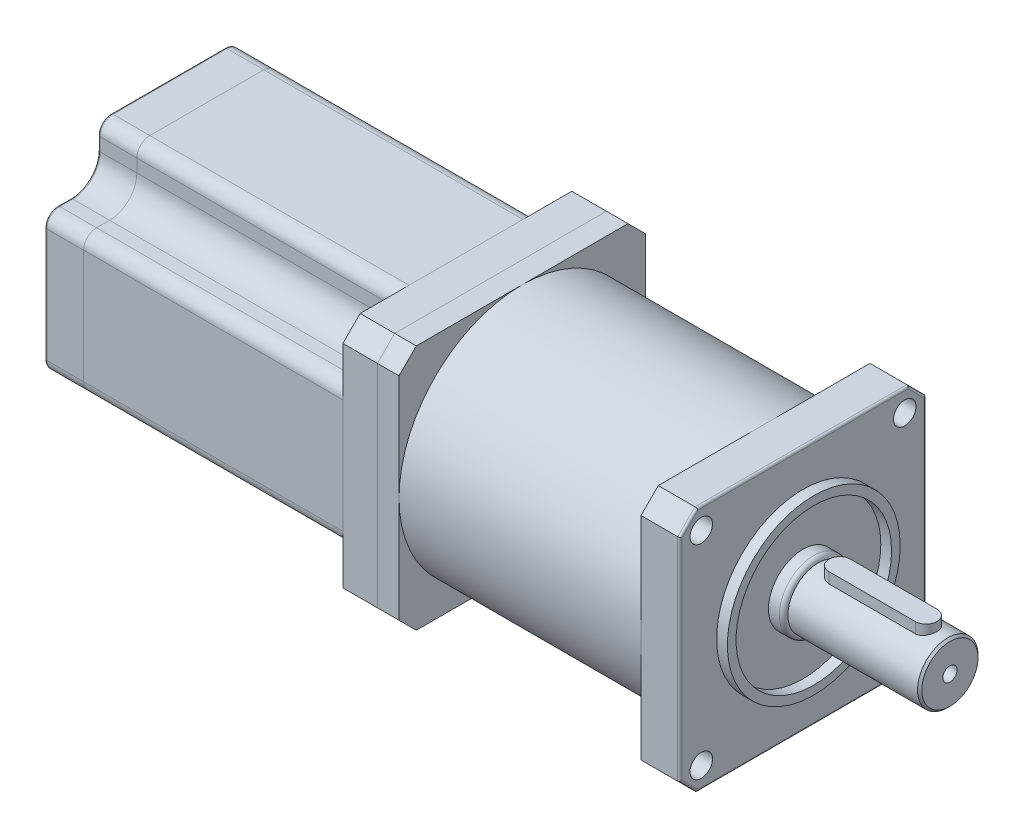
ISO-10303-21;
HEADER;
FILE_DESCRIPTION(('STEP AP214'),'2;1');
FILE_NAME('part.step','',(''),(''),'','','');
FILE_SCHEMA(('AUTOMOTIVE_DESIGN { 1 0 10303 214 1 1 1 1 }'));
ENDSEC;
DATA;
#1=APPLICATION_CONTEXT('core data for automotive mechanical design processes');
#2=APPLICATION_PROTOCOL_DEFINITION('international standard','automotive_design',2000,#1);
#3=PRODUCT_CONTEXT('',#1,'mechanical');
#4=PRODUCT('Part','Part','',(#3));
#5=PRODUCT_RELATED_PRODUCT_CATEGORY('part','',(#4));
#6=PRODUCT_DEFINITION_FORMATION('','',#4);
#7=PRODUCT_DEFINITION_CONTEXT('part definition',#1,'design');
#8=PRODUCT_DEFINITION('design','',#6,#7);
#9=PRODUCT_DEFINITION_SHAPE('','',#8);
#10=(LENGTH_UNIT() NAMED_UNIT(*) SI_UNIT(.MILLI.,.METRE.));
#11=(NAMED_UNIT(*) PLANE_ANGLE_UNIT() SI_UNIT($,.RADIAN.));
#12=(NAMED_UNIT(*) SI_UNIT($,.STERADIAN.) SOLID_ANGLE_UNIT());
#13=UNCERTAINTY_MEASURE_WITH_UNIT(LENGTH_MEASURE(1.E-05),#10,'distance_accuracy_value','');
#14=(GEOMETRIC_REPRESENTATION_CONTEXT(3) GLOBAL_UNCERTAINTY_ASSIGNED_CONTEXT((#13)) GLOBAL_UNIT_ASSIGNED_CONTEXT((#10,
#11,#12)) REPRESENTATION_CONTEXT('',''));
#15=CARTESIAN_POINT('',(0.,0.,0.));
#16=DIRECTION('',(0.,0.,1.));
#17=DIRECTION('',(1.,0.,0.));
#18=AXIS2_PLACEMENT_3D('',#15,#16,#17);
#19=CARTESIAN_POINT('',(28.5,9.,0.));
#20=DIRECTION('',(0.,-1.,0.));
#21=DIRECTION('',(0.,0.,-1.));
#22=AXIS2_PLACEMENT_3D('',#19,#20,#21);
#23=CYLINDRICAL_SURFACE('',#22,2.5);
#24=CARTESIAN_POINT('',(28.5,4.,0.));
#25=DIRECTION('',(0.,1.,0.));
#26=DIRECTION('',(0.,0.,1.));
#27=AXIS2_PLACEMENT_3D('',#24,#25,#26);
#28=CIRCLE('',#27,2.5);
#29=CARTESIAN_POINT('',(28.5,4.,2.5));
#30=VERTEX_POINT('',#29);
#31=CARTESIAN_POINT('',(28.5,4.,-2.5));
#32=VERTEX_POINT('',#31);
#33=EDGE_CURVE('E111',#30,#32,#28,.T.);
#34=ORIENTED_EDGE('',*,*,#33,.T.);
#35=DIRECTION('',(0.,-1.,0.));
#36=VECTOR('',#35,1.);
#37=CARTESIAN_POINT('',(28.5,9.,-2.5));
#38=LINE('',#37,#36);
#39=CARTESIAN_POINT('',(28.5,9.,-2.5));
#40=VERTEX_POINT('',#39);
#41=EDGE_CURVE('E12',#40,#32,#38,.T.);
#42=ORIENTED_EDGE('',*,*,#41,.F.);
#43=CARTESIAN_POINT('',(28.5,9.,0.));
#44=DIRECTION('',(0.,1.,0.));
#45=DIRECTION('',(0.,0.,1.));
#46=AXIS2_PLACEMENT_3D('',#43,#44,#45);
#47=CIRCLE('',#46,2.5);
#48=CARTESIAN_POINT('',(28.5,9.,2.5));
#49=VERTEX_POINT('',#48);
#50=EDGE_CURVE('E99',#49,#40,#47,.T.);
#51=ORIENTED_EDGE('',*,*,#50,.F.);
#52=DIRECTION('',(0.,-1.,0.));
#53=VECTOR('',#52,1.);
#54=CARTESIAN_POINT('',(28.5,9.,2.5));
#55=LINE('',#54,#53);
#56=EDGE_CURVE('E107',#49,#30,#55,.T.);
#57=ORIENTED_EDGE('',*,*,#56,.T.);
#58=EDGE_LOOP('',(#34,#42,#51,#57));
#59=FACE_BOUND('',#58,.T.);
#60=ADVANCED_FACE('F48',(#59),#23,.T.);
#61=CARTESIAN_POINT('',(28.5,9.,-2.5));
#62=DIRECTION('',(0.,0.,1.));
#63=DIRECTION('',(1.,0.,0.));
#64=AXIS2_PLACEMENT_3D('',#61,#62,#63);
#65=PLANE('',#64);
#66=DIRECTION('',(-1.,0.,0.));
#67=VECTOR('',#66,1.);
#68=CARTESIAN_POINT('',(28.5,4.,-2.5));
#69=LINE('',#68,#67);
#70=CARTESIAN_POINT('',(8.5,4.,-2.5));
#71=VERTEX_POINT('',#70);
#72=EDGE_CURVE('E103',#32,#71,#69,.T.);
#73=ORIENTED_EDGE('',*,*,#72,.T.);
#74=DIRECTION('',(0.,-1.,0.));
#75=VECTOR('',#74,1.);
#76=CARTESIAN_POINT('',(8.5,9.,-2.5));
#77=LINE('',#76,#75);
#78=CARTESIAN_POINT('',(8.5,9.,-2.5));
#79=VERTEX_POINT('',#78);
#80=EDGE_CURVE('E56',#79,#71,#77,.T.);
#81=ORIENTED_EDGE('',*,*,#80,.F.);
#82=DIRECTION('',(-1.,0.,0.));
#83=VECTOR('',#82,1.);
#84=CARTESIAN_POINT('',(28.5,9.,-2.5));
#85=LINE('',#84,#83);
#86=EDGE_CURVE('E94',#40,#79,#85,.T.);
#87=ORIENTED_EDGE('',*,*,#86,.F.);
#88=ORIENTED_EDGE('',*,*,#41,.T.);
#89=EDGE_LOOP('',(#73,#81,#87,#88));
#90=FACE_BOUND('',#89,.T.);
#91=ADVANCED_FACE('F102',(#90),#65,.F.);
#92=CARTESIAN_POINT('',(8.5,9.,0.));
#93=DIRECTION('',(0.,-1.,0.));
#94=DIRECTION('',(0.,0.,-1.));
#95=AXIS2_PLACEMENT_3D('',#92,#93,#94);
#96=CYLINDRICAL_SURFACE('',#95,2.5);
#97=CARTESIAN_POINT('',(8.5,4.,0.));
#98=DIRECTION('',(0.,1.,0.));
#99=DIRECTION('',(0.,0.,1.));
#100=AXIS2_PLACEMENT_3D('',#97,#98,#99);
#101=CIRCLE('',#100,2.5);
#102=CARTESIAN_POINT('',(8.5,4.,2.5));
#103=VERTEX_POINT('',#102);
#104=EDGE_CURVE('E81',#71,#103,#101,.T.);
#105=ORIENTED_EDGE('',*,*,#104,.T.);
#106=DIRECTION('',(0.,-1.,0.));
#107=VECTOR('',#106,1.);
#108=CARTESIAN_POINT('',(8.5,9.,2.5));
#109=LINE('',#108,#107);
#110=CARTESIAN_POINT('',(8.5,9.,2.5));
#111=VERTEX_POINT('',#110);
#112=EDGE_CURVE('E104',#111,#103,#109,.T.);
#113=ORIENTED_EDGE('',*,*,#112,.F.);
#114=CARTESIAN_POINT('',(8.5,9.,0.));
#115=DIRECTION('',(0.,1.,0.));
#116=DIRECTION('',(0.,0.,1.));
#117=AXIS2_PLACEMENT_3D('',#114,#115,#116);
#118=CIRCLE('',#117,2.5);
#119=EDGE_CURVE('E97',#79,#111,#118,.T.);
#120=ORIENTED_EDGE('',*,*,#119,.F.);
#121=ORIENTED_EDGE('',*,*,#80,.T.);
#122=EDGE_LOOP('',(#105,#113,#120,#121));
#123=FACE_BOUND('',#122,.T.);
#124=ADVANCED_FACE('F105',(#123),#96,.T.);
#125=CARTESIAN_POINT('',(8.5,9.,2.5));
#126=DIRECTION('',(0.,0.,-1.));
#127=DIRECTION('',(-1.,0.,0.));
#128=AXIS2_PLACEMENT_3D('',#125,#126,#127);
#129=PLANE('',#128);
#130=DIRECTION('',(1.,0.,0.));
#131=VECTOR('',#130,1.);
#132=CARTESIAN_POINT('',(8.5,4.,2.5));
#133=LINE('',#132,#131);
#134=EDGE_CURVE('E87',#103,#30,#133,.T.);
#135=ORIENTED_EDGE('',*,*,#134,.T.);
#136=ORIENTED_EDGE('',*,*,#56,.F.);
#137=DIRECTION('',(1.,0.,0.));
#138=VECTOR('',#137,1.);
#139=CARTESIAN_POINT('',(8.5,9.,2.5));
#140=LINE('',#139,#138);
#141=EDGE_CURVE('E64',#111,#49,#140,.T.);
#142=ORIENTED_EDGE('',*,*,#141,.F.);
#143=ORIENTED_EDGE('',*,*,#112,.T.);
#144=EDGE_LOOP('',(#135,#136,#142,#143));
#145=FACE_BOUND('',#144,.T.);
#146=ADVANCED_FACE('F118',(#145),#129,.F.);
#147=CARTESIAN_POINT('',(28.5,9.,0.));
#148=DIRECTION('',(0.,1.,0.));
#149=DIRECTION('',(0.,0.,1.));
#150=AXIS2_PLACEMENT_3D('',#147,#148,#149);
#151=PLANE('',#150);
#152=ORIENTED_EDGE('',*,*,#50,.T.);
#153=ORIENTED_EDGE('',*,*,#86,.T.);
#154=ORIENTED_EDGE('',*,*,#119,.T.);
#155=ORIENTED_EDGE('',*,*,#141,.T.);
#156=EDGE_LOOP('',(#152,#153,#154,#155));
#157=FACE_BOUND('',#156,.T.);
#158=ADVANCED_FACE('F95',(#157),#151,.T.);
#159=CARTESIAN_POINT('',(28.5,4.,0.));
#160=DIRECTION('',(0.,1.,0.));
#161=DIRECTION('',(0.,0.,1.));
#162=AXIS2_PLACEMENT_3D('',#159,#160,#161);
#163=PLANE('',#162);
#164=ORIENTED_EDGE('',*,*,#33,.F.);
#165=ORIENTED_EDGE('',*,*,#134,.F.);
#166=ORIENTED_EDGE('',*,*,#104,.F.);
#167=ORIENTED_EDGE('',*,*,#72,.F.);
#168=EDGE_LOOP('',(#164,#165,#166,#167));
#169=FACE_BOUND('',#168,.T.);
#170=ADVANCED_FACE('F121',(#169),#163,.F.);
#171=CLOSED_SHELL('',(#60,#91,#124,#146,#158,#170));
#172=MANIFOLD_SOLID_BREP('B2',#171);
#173=CARTESIAN_POINT('',(34.,0.,0.));
#174=DIRECTION('',(-1.,0.,0.));
#175=DIRECTION('',(0.,0.,1.));
#176=AXIS2_PLACEMENT_3D('',#173,#174,#175);
#177=CYLINDRICAL_SURFACE('',#176,7.);
#178=CARTESIAN_POINT('',(33.5,0.,0.));
#179=DIRECTION('',(1.,0.,0.));
#180=DIRECTION('',(0.,0.,-1.));
#181=AXIS2_PLACEMENT_3D('',#178,#179,#180);
#182=CIRCLE('',#181,7.);
#183=CARTESIAN_POINT('',(33.5,0.,-7.));
#184=VERTEX_POINT('',#183);
#185=EDGE_CURVE('E46',#184,#184,#182,.F.);
#186=ORIENTED_EDGE('',*,*,#185,.T.);
#187=EDGE_LOOP('',(#186));
#188=FACE_BOUND('',#187,.T.);
#189=DIRECTION('',(-1.,0.,0.));
#190=VECTOR('',#189,1.);
#191=CARTESIAN_POINT('',(34.,6.53834841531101,-2.5));
#192=LINE('',#191,#190);
#193=CARTESIAN_POINT('',(8.5,6.53834841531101,-2.5));
#194=VERTEX_POINT('',#193);
#195=CARTESIAN_POINT('',(28.5,6.53834841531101,-2.5));
#196=VERTEX_POINT('',#195);
#197=EDGE_CURVE('E205',#194,#196,#192,.F.);
#198=ORIENTED_EDGE('',*,*,#197,.T.);
#199=CARTESIAN_POINT('',(28.5,6.53834841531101,-2.5));
#200=CARTESIAN_POINT('',(28.5678892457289,6.53833653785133,-2.50000932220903));
#201=CARTESIAN_POINT('',(28.6357719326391,6.53940549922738,-2.49723485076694));
#202=CARTESIAN_POINT('',(28.7710039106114,6.54361657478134,-2.4861910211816));
#203=CARTESIAN_POINT('',(28.8383533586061,6.54675805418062,-2.47792334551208));
#204=CARTESIAN_POINT('',(28.9718214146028,6.55501217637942,-2.45600175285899));
#205=CARTESIAN_POINT('',(29.0379433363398,6.56011831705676,-2.44236559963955));
#206=CARTESIAN_POINT('',(29.1687018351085,6.57213177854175,-2.40985115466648));
#207=CARTESIAN_POINT('',(29.2333383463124,6.57903917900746,-2.39097263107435));
#208=CARTESIAN_POINT('',(29.4242643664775,6.6021493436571,-2.32673964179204));
#209=CARTESIAN_POINT('',(29.5477904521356,6.62075475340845,-2.27375112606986));
#210=CARTESIAN_POINT('',(29.784230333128,6.6622539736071,-2.14910757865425));
#211=CARTESIAN_POINT('',(29.8971363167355,6.68515090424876,-2.07743895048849));
#212=CARTESIAN_POINT('',(30.1142152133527,6.73379913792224,-1.91402571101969));
#213=CARTESIAN_POINT('',(30.2178464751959,6.75962864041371,-1.82158337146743));
#214=CARTESIAN_POINT('',(30.4085087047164,6.81057592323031,-1.6207338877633));
#215=CARTESIAN_POINT('',(30.4955365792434,6.83569357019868,-1.51232377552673));
#216=CARTESIAN_POINT('',(30.653089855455,6.88331133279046,-1.27853915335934));
#217=CARTESIAN_POINT('',(30.7230315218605,6.90570835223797,-1.15274833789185));
#218=CARTESIAN_POINT('',(30.8405366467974,6.94442357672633,-0.890250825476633));
#219=CARTESIAN_POINT('',(30.888107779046,6.96074386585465,-0.753547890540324));
#220=CARTESIAN_POINT('',(30.9576406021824,6.9849105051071,-0.478829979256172));
#221=CARTESIAN_POINT('',(30.9805391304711,6.99306594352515,-0.341079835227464));
#222=CARTESIAN_POINT('',(31.0030684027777,7.00108798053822,-0.0634643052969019));
#223=CARTESIAN_POINT('',(31.0027055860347,7.00095687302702,0.0764004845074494));
#224=CARTESIAN_POINT('',(30.9792887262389,6.99262258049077,0.347593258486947));
#225=CARTESIAN_POINT('',(30.9572552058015,6.98478243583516,0.479022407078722));
#226=CARTESIAN_POINT('',(30.8928265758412,6.96237832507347,0.736175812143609));
#227=CARTESIAN_POINT('',(30.8504303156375,6.94781397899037,0.861899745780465));
#228=CARTESIAN_POINT('',(30.7459530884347,6.91316506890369,1.10616102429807));
#229=CARTESIAN_POINT('',(30.6836042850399,6.89300592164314,1.22457279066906));
#230=CARTESIAN_POINT('',(30.5412206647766,6.8492335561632,1.44953531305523));
#231=CARTESIAN_POINT('',(30.4611804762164,6.82561928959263,1.5560824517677));
#232=CARTESIAN_POINT('',(30.2806767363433,6.7759054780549,1.7603244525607));
#233=CARTESIAN_POINT('',(30.1793502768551,6.74974055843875,1.85724185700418));
#234=CARTESIAN_POINT('',(29.9616726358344,6.69890342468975,2.03299914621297));
#235=CARTESIAN_POINT('',(29.8453160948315,6.67423174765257,2.11183255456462));
#236=CARTESIAN_POINT('',(29.598057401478,6.62877803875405,2.25049860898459));
#237=CARTESIAN_POINT('',(29.4669210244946,6.60807875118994,2.30994207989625));
#238=CARTESIAN_POINT('',(29.1956351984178,6.57388213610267,2.4055543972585));
#239=CARTESIAN_POINT('',(29.055500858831,6.56037307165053,2.44176119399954));
#240=CARTESIAN_POINT('',(28.8449694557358,6.54708542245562,2.47705497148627));
#241=CARTESIAN_POINT('',(28.7762636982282,6.54382010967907,2.48565347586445));
#242=CARTESIAN_POINT('',(28.6383848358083,6.53944910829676,2.49712352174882));
#243=CARTESIAN_POINT('',(28.5692123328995,6.53834103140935,2.50000139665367));
#244=CARTESIAN_POINT('',(28.5,6.53834841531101,2.5));
#245=B_SPLINE_CURVE_WITH_KNOTS('',3,(#199,#200,#201,#202,#203,#204,#205,#206,#207,#208,#209,
#210,#211,#212,#213,#214,#215,#216,#217,#218,#219,#220,#221,#222,#223,#224,#225,#226,#227,#228,
#229,#230,#231,#232,#233,#234,#235,#236,#237,#238,#239,#240,#241,#242,#243,#244),.UNSPECIFIED.,
.F.,.F.,(4,2,2,2,2,2,2,2,2,2,2,2,2,2,2,2,2,2,2,2,2,2,4),(0.,0.203591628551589,0.407120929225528,
0.609982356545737,0.812852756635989,1.21793118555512,1.6233052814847,2.0451597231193,
2.4670926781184,2.90188398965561,3.33652604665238,3.75400993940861,4.17137826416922,
4.56998920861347,4.96862268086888,5.37284909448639,5.77719841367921,6.20315837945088,
6.6292706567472,7.06347329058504,7.49696496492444,7.70468580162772,7.91217653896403),.UNSPECIFIED.);
#246=CARTESIAN_POINT('',(28.5,6.53834841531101,2.5));
#247=VERTEX_POINT('',#246);
#248=EDGE_CURVE('E263',#196,#247,#245,.T.);
#249=ORIENTED_EDGE('',*,*,#248,.T.);
#250=DIRECTION('',(-1.,0.,0.));
#251=VECTOR('',#250,1.);
#252=CARTESIAN_POINT('',(34.,6.53834841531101,2.5));
#253=LINE('',#252,#251);
#254=CARTESIAN_POINT('',(8.5,6.53834841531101,2.5));
#255=VERTEX_POINT('',#254);
#256=EDGE_CURVE('E310',#247,#255,#253,.T.);
#257=ORIENTED_EDGE('',*,*,#256,.T.);
#258=CARTESIAN_POINT('',(8.5,6.53834841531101,2.5));
#259=CARTESIAN_POINT('',(8.43211075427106,6.53833653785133,2.50000932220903));
#260=CARTESIAN_POINT('',(8.36422806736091,6.53940549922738,2.49723485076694));
#261=CARTESIAN_POINT('',(8.22899608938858,6.54361657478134,2.4861910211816));
#262=CARTESIAN_POINT('',(8.16164664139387,6.54675805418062,2.47792334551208));
#263=CARTESIAN_POINT('',(8.02817858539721,6.55501217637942,2.456001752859));
#264=CARTESIAN_POINT('',(7.96205666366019,6.56011831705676,2.44236559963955));
#265=CARTESIAN_POINT('',(7.83129816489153,6.57213177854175,2.40985115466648));
#266=CARTESIAN_POINT('',(7.76666165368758,6.57903917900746,2.39097263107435));
#267=CARTESIAN_POINT('',(7.57573563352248,6.6021493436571,2.32673964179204));
#268=CARTESIAN_POINT('',(7.45220954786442,6.62075475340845,2.27375112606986));
#269=CARTESIAN_POINT('',(7.21576966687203,6.6622539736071,2.14910757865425));
#270=CARTESIAN_POINT('',(7.10286368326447,6.68515090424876,2.07743895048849));
#271=CARTESIAN_POINT('',(6.88578478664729,6.73379913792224,1.9140257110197));
#272=CARTESIAN_POINT('',(6.78215352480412,6.75962864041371,1.82158337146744));
#273=CARTESIAN_POINT('',(6.59149129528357,6.81057592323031,1.6207338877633));
#274=CARTESIAN_POINT('',(6.50446342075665,6.83569357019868,1.51232377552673));
#275=CARTESIAN_POINT('',(6.34691014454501,6.88331133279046,1.27853915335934));
#276=CARTESIAN_POINT('',(6.27696847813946,6.90570835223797,1.15274833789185));
#277=CARTESIAN_POINT('',(6.15946335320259,6.94442357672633,0.890250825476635));
#278=CARTESIAN_POINT('',(6.11189222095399,6.96074386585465,0.753547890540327));
#279=CARTESIAN_POINT('',(6.04235939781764,6.9849105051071,0.478829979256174));
#280=CARTESIAN_POINT('',(6.01946086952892,6.99306594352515,0.341079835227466));
#281=CARTESIAN_POINT('',(5.99693159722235,7.00108798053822,0.0634643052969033));
#282=CARTESIAN_POINT('',(5.99729441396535,7.00095687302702,-0.0764004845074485));
#283=CARTESIAN_POINT('',(6.02071127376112,6.99262258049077,-0.347593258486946));
#284=CARTESIAN_POINT('',(6.04274479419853,6.98478243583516,-0.479022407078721));
#285=CARTESIAN_POINT('',(6.1071734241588,6.96237832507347,-0.736175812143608));
#286=CARTESIAN_POINT('',(6.14956968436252,6.94781397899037,-0.861899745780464));
#287=CARTESIAN_POINT('',(6.25404691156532,6.91316506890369,-1.10616102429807));
#288=CARTESIAN_POINT('',(6.31639571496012,6.89300592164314,-1.22457279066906));
#289=CARTESIAN_POINT('',(6.45877933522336,6.8492335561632,-1.44953531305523));
#290=CARTESIAN_POINT('',(6.53881952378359,6.82561928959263,-1.5560824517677));
#291=CARTESIAN_POINT('',(6.7193232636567,6.7759054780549,-1.7603244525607));
#292=CARTESIAN_POINT('',(6.8206497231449,6.74974055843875,-1.85724185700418));
#293=CARTESIAN_POINT('',(7.03832736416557,6.69890342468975,-2.03299914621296));
#294=CARTESIAN_POINT('',(7.15468390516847,6.67423174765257,-2.11183255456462));
#295=CARTESIAN_POINT('',(7.40194259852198,6.62877803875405,-2.25049860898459));
#296=CARTESIAN_POINT('',(7.53307897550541,6.60807875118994,-2.30994207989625));
#297=CARTESIAN_POINT('',(7.80436480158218,6.57388213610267,-2.4055543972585));
#298=CARTESIAN_POINT('',(7.94449914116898,6.56037307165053,-2.44176119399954));
#299=CARTESIAN_POINT('',(8.15503054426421,6.54708542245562,-2.47705497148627));
#300=CARTESIAN_POINT('',(8.22373630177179,6.54382010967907,-2.48565347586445));
#301=CARTESIAN_POINT('',(8.36161516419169,6.53944910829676,-2.49712352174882));
#302=CARTESIAN_POINT('',(8.43078766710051,6.53834103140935,-2.50000139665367));
#303=CARTESIAN_POINT('',(8.5,6.53834841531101,-2.5));
#304=B_SPLINE_CURVE_WITH_KNOTS('',3,(#258,#259,#260,#261,#262,#263,#264,#265,#266,#267,#268,
#269,#270,#271,#272,#273,#274,#275,#276,#277,#278,#279,#280,#281,#282,#283,#284,#285,#286,#287,
#288,#289,#290,#291,#292,#293,#294,#295,#296,#297,#298,#299,#300,#301,#302,#303),.UNSPECIFIED.,
.F.,.F.,(4,2,2,2,2,2,2,2,2,2,2,2,2,2,2,2,2,2,2,2,2,2,4),(0.,0.203591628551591,0.40712092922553,
0.609982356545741,0.812852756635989,1.21793118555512,1.6233052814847,2.0451597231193,
2.4670926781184,2.90188398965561,3.33652604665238,3.75400993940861,4.17137826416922,
4.56998920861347,4.96862268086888,5.37284909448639,5.77719841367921,6.20315837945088,
6.62927065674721,7.06347329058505,7.49696496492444,7.70468580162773,7.91217653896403),.UNSPECIFIED.);
#305=EDGE_CURVE('E197',#255,#194,#304,.T.);
#306=ORIENTED_EDGE('',*,*,#305,.T.);
#307=EDGE_LOOP('',(#198,#249,#257,#306));
#308=FACE_BOUND('',#307,.T.);
#309=CARTESIAN_POINT('',(3.5,0.,0.));
#310=DIRECTION('',(1.,0.,0.));
#311=DIRECTION('',(0.,0.,-1.));
#312=AXIS2_PLACEMENT_3D('',#309,#310,#311);
#313=CIRCLE('',#312,7.);
#314=CARTESIAN_POINT('',(3.5,0.,-7.));
#315=VERTEX_POINT('',#314);
#316=EDGE_CURVE('E254',#315,#315,#313,.T.);
#317=ORIENTED_EDGE('',*,*,#316,.T.);
#318=EDGE_LOOP('',(#317));
#319=FACE_BOUND('',#318,.T.);
#320=ADVANCED_FACE('F182',(#188,#308,#319),#177,.T.);
#321=CARTESIAN_POINT('',(34.,0.,0.));
#322=DIRECTION('',(1.,0.,0.));
#323=DIRECTION('',(0.,0.,-1.));
#324=AXIS2_PLACEMENT_3D('',#321,#322,#323);
#325=PLANE('',#324);
#326=CARTESIAN_POINT('',(34.,0.,0.));
#327=DIRECTION('',(1.,0.,0.));
#328=DIRECTION('',(0.,0.,-1.));
#329=AXIS2_PLACEMENT_3D('',#326,#327,#328);
#330=CIRCLE('',#329,1.64999999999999);
#331=CARTESIAN_POINT('',(34.,0.,-1.64999999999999));
#332=VERTEX_POINT('',#331);
#333=EDGE_CURVE('E235',#332,#332,#330,.T.);
#334=ORIENTED_EDGE('',*,*,#333,.F.);
#335=EDGE_LOOP('',(#334));
#336=FACE_BOUND('',#335,.T.);
#337=CARTESIAN_POINT('',(34.,0.,0.));
#338=DIRECTION('',(1.,0.,0.));
#339=DIRECTION('',(0.,0.,-1.));
#340=AXIS2_PLACEMENT_3D('',#337,#338,#339);
#341=CIRCLE('',#340,6.50000000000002);
#342=CARTESIAN_POINT('',(34.,0.,-6.50000000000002));
#343=VERTEX_POINT('',#342);
#344=EDGE_CURVE('E190',#343,#343,#341,.T.);
#345=ORIENTED_EDGE('',*,*,#344,.T.);
#346=EDGE_LOOP('',(#345));
#347=FACE_BOUND('',#346,.T.);
#348=ADVANCED_FACE('F294',(#336,#347),#325,.T.);
#349=CARTESIAN_POINT('',(3.5,0.,0.));
#350=DIRECTION('',(1.,0.,0.));
#351=DIRECTION('',(0.,0.,-1.));
#352=AXIS2_PLACEMENT_3D('',#349,#350,#351);
#353=PLANE('',#352);
#354=ORIENTED_EDGE('',*,*,#316,.F.);
#355=EDGE_LOOP('',(#354));
#356=FACE_BOUND('',#355,.T.);
#357=ADVANCED_FACE('F293',(#356),#353,.F.);
#358=CARTESIAN_POINT('',(8.5,4.,0.));
#359=DIRECTION('',(0.,1.,0.));
#360=DIRECTION('',(0.,0.,1.));
#361=AXIS2_PLACEMENT_3D('',#358,#359,#360);
#362=CYLINDRICAL_SURFACE('',#361,2.5);
#363=DIRECTION('',(0.,1.,0.));
#364=VECTOR('',#363,1.);
#365=CARTESIAN_POINT('',(8.5,4.,2.5));
#366=LINE('',#365,#364);
#367=CARTESIAN_POINT('',(8.5,4.,2.5));
#368=VERTEX_POINT('',#367);
#369=EDGE_CURVE('E251',#368,#255,#366,.T.);
#370=ORIENTED_EDGE('',*,*,#369,.F.);
#371=CARTESIAN_POINT('',(8.5,4.,0.));
#372=DIRECTION('',(0.,1.,0.));
#373=DIRECTION('',(0.,0.,1.));
#374=AXIS2_PLACEMENT_3D('',#371,#372,#373);
#375=CIRCLE('',#374,2.5);
#376=CARTESIAN_POINT('',(8.5,4.,-2.5));
#377=VERTEX_POINT('',#376);
#378=EDGE_CURVE('E234',#377,#368,#375,.T.);
#379=ORIENTED_EDGE('',*,*,#378,.F.);
#380=DIRECTION('',(0.,1.,0.));
#381=VECTOR('',#380,1.);
#382=CARTESIAN_POINT('',(8.5,4.,-2.5));
#383=LINE('',#382,#381);
#384=EDGE_CURVE('E252',#377,#194,#383,.T.);
#385=ORIENTED_EDGE('',*,*,#384,.T.);
#386=ORIENTED_EDGE('',*,*,#305,.F.);
#387=EDGE_LOOP('',(#370,#379,#385,#386));
#388=FACE_BOUND('',#387,.T.);
#389=ADVANCED_FACE('F289',(#388),#362,.F.);
#390=CARTESIAN_POINT('',(8.5,4.,-2.5));
#391=DIRECTION('',(0.,0.,-1.));
#392=DIRECTION('',(-1.,0.,0.));
#393=AXIS2_PLACEMENT_3D('',#390,#391,#392);
#394=PLANE('',#393);
#395=ORIENTED_EDGE('',*,*,#384,.F.);
#396=DIRECTION('',(-1.,0.,0.));
#397=VECTOR('',#396,1.);
#398=CARTESIAN_POINT('',(8.5,4.,-2.5));
#399=LINE('',#398,#397);
#400=CARTESIAN_POINT('',(28.5,4.,-2.5));
#401=VERTEX_POINT('',#400);
#402=EDGE_CURVE('E248',#401,#377,#399,.T.);
#403=ORIENTED_EDGE('',*,*,#402,.F.);
#404=DIRECTION('',(0.,1.,0.));
#405=VECTOR('',#404,1.);
#406=CARTESIAN_POINT('',(28.5,4.,-2.5));
#407=LINE('',#406,#405);
#408=EDGE_CURVE('E255',#401,#196,#407,.T.);
#409=ORIENTED_EDGE('',*,*,#408,.T.);
#410=ORIENTED_EDGE('',*,*,#197,.F.);
#411=EDGE_LOOP('',(#395,#403,#409,#410));
#412=FACE_BOUND('',#411,.T.);
#413=ADVANCED_FACE('F283',(#412),#394,.F.);
#414=CARTESIAN_POINT('',(28.5,4.,0.));
#415=DIRECTION('',(0.,1.,0.));
#416=DIRECTION('',(0.,0.,1.));
#417=AXIS2_PLACEMENT_3D('',#414,#415,#416);
#418=CYLINDRICAL_SURFACE('',#417,2.5);
#419=ORIENTED_EDGE('',*,*,#408,.F.);
#420=CARTESIAN_POINT('',(28.5,4.,0.));
#421=DIRECTION('',(0.,1.,0.));
#422=DIRECTION('',(0.,0.,1.));
#423=AXIS2_PLACEMENT_3D('',#420,#421,#422);
#424=CIRCLE('',#423,2.5);
#425=CARTESIAN_POINT('',(28.5,4.,2.5));
#426=VERTEX_POINT('',#425);
#427=EDGE_CURVE('E245',#426,#401,#424,.T.);
#428=ORIENTED_EDGE('',*,*,#427,.F.);
#429=DIRECTION('',(0.,1.,0.));
#430=VECTOR('',#429,1.);
#431=CARTESIAN_POINT('',(28.5,4.,2.5));
#432=LINE('',#431,#430);
#433=EDGE_CURVE('E257',#426,#247,#432,.T.);
#434=ORIENTED_EDGE('',*,*,#433,.T.);
#435=ORIENTED_EDGE('',*,*,#248,.F.);
#436=EDGE_LOOP('',(#419,#428,#434,#435));
#437=FACE_BOUND('',#436,.T.);
#438=ADVANCED_FACE('F277',(#437),#418,.F.);
#439=CARTESIAN_POINT('',(28.5,4.,2.5));
#440=DIRECTION('',(0.,0.,1.));
#441=DIRECTION('',(1.,0.,0.));
#442=AXIS2_PLACEMENT_3D('',#439,#440,#441);
#443=PLANE('',#442);
#444=ORIENTED_EDGE('',*,*,#433,.F.);
#445=DIRECTION('',(1.,0.,0.));
#446=VECTOR('',#445,1.);
#447=CARTESIAN_POINT('',(28.5,4.,2.5));
#448=LINE('',#447,#446);
#449=EDGE_CURVE('E238',#368,#426,#448,.T.);
#450=ORIENTED_EDGE('',*,*,#449,.F.);
#451=ORIENTED_EDGE('',*,*,#369,.T.);
#452=ORIENTED_EDGE('',*,*,#256,.F.);
#453=EDGE_LOOP('',(#444,#450,#451,#452));
#454=FACE_BOUND('',#453,.T.);
#455=ADVANCED_FACE('F282',(#454),#443,.F.);
#456=CARTESIAN_POINT('',(8.5,4.,0.));
#457=DIRECTION('',(0.,1.,0.));
#458=DIRECTION('',(0.,0.,1.));
#459=AXIS2_PLACEMENT_3D('',#456,#457,#458);
#460=PLANE('',#459);
#461=ORIENTED_EDGE('',*,*,#378,.T.);
#462=ORIENTED_EDGE('',*,*,#449,.T.);
#463=ORIENTED_EDGE('',*,*,#427,.T.);
#464=ORIENTED_EDGE('',*,*,#402,.T.);
#465=EDGE_LOOP('',(#461,#462,#463,#464));
#466=FACE_BOUND('',#465,.T.);
#467=ADVANCED_FACE('F287',(#466),#460,.T.);
#468=CARTESIAN_POINT('',(34.,0.,0.));
#469=DIRECTION('',(-1.,0.,0.));
#470=DIRECTION('',(0.,0.,1.));
#471=AXIS2_PLACEMENT_3D('',#468,#469,#470);
#472=CONICAL_SURFACE('',#471,6.50000000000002,0.785398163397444);
#473=ORIENTED_EDGE('',*,*,#185,.F.);
#474=EDGE_LOOP('',(#473));
#475=FACE_BOUND('',#474,.T.);
#476=ORIENTED_EDGE('',*,*,#344,.F.);
#477=EDGE_LOOP('',(#476));
#478=FACE_BOUND('',#477,.T.);
#479=ADVANCED_FACE('F184',(#475,#478),#472,.T.);
#480=CARTESIAN_POINT('',(24.5,0.,0.));
#481=DIRECTION('',(1.,0.,0.));
#482=DIRECTION('',(0.,0.,-1.));
#483=AXIS2_PLACEMENT_3D('',#480,#481,#482);
#484=CONICAL_SURFACE('',#483,1.65,1.02974425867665);
#485=CARTESIAN_POINT('',(23.5085799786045,0.,0.));
#486=VERTEX_POINT('',#485);
#487=VERTEX_LOOP('',#486);
#488=FACE_BOUND('',#487,.T.);
#489=CARTESIAN_POINT('',(24.5,0.,0.));
#490=DIRECTION('',(1.,0.,0.));
#491=DIRECTION('',(0.,0.,-1.));
#492=AXIS2_PLACEMENT_3D('',#489,#490,#491);
#493=CIRCLE('',#492,1.65);
#494=CARTESIAN_POINT('',(24.5,0.,-1.65));
#495=VERTEX_POINT('',#494);
#496=EDGE_CURVE('E232',#495,#495,#493,.T.);
#497=ORIENTED_EDGE('',*,*,#496,.T.);
#498=EDGE_LOOP('',(#497));
#499=FACE_BOUND('',#498,.T.);
#500=ADVANCED_FACE('F225',(#488,#499),#484,.F.);
#501=CARTESIAN_POINT('',(34.,0.,0.));
#502=DIRECTION('',(1.,0.,0.));
#503=DIRECTION('',(0.,0.,-1.));
#504=AXIS2_PLACEMENT_3D('',#501,#502,#503);
#505=CYLINDRICAL_SURFACE('',#504,1.64999999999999);
#506=ORIENTED_EDGE('',*,*,#496,.F.);
#507=EDGE_LOOP('',(#506));
#508=FACE_BOUND('',#507,.T.);
#509=ORIENTED_EDGE('',*,*,#333,.T.);
#510=EDGE_LOOP('',(#509));
#511=FACE_BOUND('',#510,.T.);
#512=ADVANCED_FACE('F228',(#508,#511),#505,.F.);
#513=CLOSED_SHELL('',(#320,#348,#357,#389,#413,#438,#455,#467,#479,#500,#512));
#514=MANIFOLD_SOLID_BREP('B6',#513);
#515=CARTESIAN_POINT('',(-147.,-24.5,-28.5));
#516=DIRECTION('',(0.,0.,1.));
#517=DIRECTION('',(1.,0.,0.));
#518=AXIS2_PLACEMENT_3D('',#515,#516,#517);
#519=PLANE('',#518);
#520=DIRECTION('',(-1.,0.,0.));
#521=VECTOR('',#520,1.);
#522=CARTESIAN_POINT('',(-78.,-13.1754446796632,-28.5));
#523=LINE('',#522,#521);
#524=CARTESIAN_POINT('',(-138.,-13.1754446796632,-28.5));
#525=VERTEX_POINT('',#524);
#526=CARTESIAN_POINT('',(-146.5,-13.1754446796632,-28.5));
#527=VERTEX_POINT('',#526);
#528=EDGE_CURVE('E908',#525,#527,#523,.T.);
#529=ORIENTED_EDGE('',*,*,#528,.T.);
#530=DIRECTION('',(0.,-1.,0.));
#531=VECTOR('',#530,1.);
#532=CARTESIAN_POINT('',(-146.5,13.1754446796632,-28.5));
#533=LINE('',#532,#531);
#534=CARTESIAN_POINT('',(-146.5,13.1754446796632,-28.5));
#535=VERTEX_POINT('',#534);
#536=EDGE_CURVE('E807',#527,#535,#533,.F.);
#537=ORIENTED_EDGE('',*,*,#536,.T.);
#538=DIRECTION('',(-1.,0.,0.));
#539=VECTOR('',#538,1.);
#540=CARTESIAN_POINT('',(-78.,13.1754446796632,-28.5));
#541=LINE('',#540,#539);
#542=CARTESIAN_POINT('',(-138.,13.1754446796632,-28.5));
#543=VERTEX_POINT('',#542);
#544=EDGE_CURVE('E980',#543,#535,#541,.T.);
#545=ORIENTED_EDGE('',*,*,#544,.F.);
#546=DIRECTION('',(0.,-1.,0.));
#547=VECTOR('',#546,1.);
#548=CARTESIAN_POINT('',(-138.,-24.5,-28.5));
#549=LINE('',#548,#547);
#550=EDGE_CURVE('E950',#543,#525,#549,.T.);
#551=ORIENTED_EDGE('',*,*,#550,.T.);
#552=EDGE_LOOP('',(#529,#537,#545,#551));
#553=FACE_BOUND('',#552,.T.);
#554=ADVANCED_FACE('F409',(#553),#519,.F.);
#555=CARTESIAN_POINT('',(-147.,-28.5,-24.5));
#556=DIRECTION('',(0.,1.,0.));
#557=DIRECTION('',(0.,0.,1.));
#558=AXIS2_PLACEMENT_3D('',#555,#556,#557);
#559=PLANE('',#558);
#560=DIRECTION('',(-1.,0.,0.));
#561=VECTOR('',#560,1.);
#562=CARTESIAN_POINT('',(-78.,-28.5,13.1754446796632));
#563=LINE('',#562,#561);
#564=CARTESIAN_POINT('',(-138.,-28.5,13.1754446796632));
#565=VERTEX_POINT('',#564);
#566=CARTESIAN_POINT('',(-146.5,-28.5,13.1754446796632));
#567=VERTEX_POINT('',#566);
#568=EDGE_CURVE('E902',#565,#567,#563,.T.);
#569=ORIENTED_EDGE('',*,*,#568,.T.);
#570=DIRECTION('',(0.,0.,1.));
#571=VECTOR('',#570,1.);
#572=CARTESIAN_POINT('',(-146.5,-28.5,-13.1754446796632));
#573=LINE('',#572,#571);
#574=CARTESIAN_POINT('',(-146.5,-28.5,-13.1754446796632));
#575=VERTEX_POINT('',#574);
#576=EDGE_CURVE('E795',#567,#575,#573,.F.);
#577=ORIENTED_EDGE('',*,*,#576,.T.);
#578=DIRECTION('',(-1.,0.,0.));
#579=VECTOR('',#578,1.);
#580=CARTESIAN_POINT('',(-78.,-28.5,-13.1754446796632));
#581=LINE('',#580,#579);
#582=CARTESIAN_POINT('',(-138.,-28.5,-13.1754446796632));
#583=VERTEX_POINT('',#582);
#584=EDGE_CURVE('E900',#583,#575,#581,.T.);
#585=ORIENTED_EDGE('',*,*,#584,.F.);
#586=DIRECTION('',(0.,0.,1.));
#587=VECTOR('',#586,1.);
#588=CARTESIAN_POINT('',(-138.,-28.5,-24.5));
#589=LINE('',#588,#587);
#590=EDGE_CURVE('E953',#583,#565,#589,.T.);
#591=ORIENTED_EDGE('',*,*,#590,.T.);
#592=EDGE_LOOP('',(#569,#577,#585,#591));
#593=FACE_BOUND('',#592,.T.);
#594=ADVANCED_FACE('F898',(#593),#559,.F.);
#595=CARTESIAN_POINT('',(-147.,-24.5,28.5));
#596=DIRECTION('',(0.,0.,-1.));
#597=DIRECTION('',(0.,1.,0.));
#598=AXIS2_PLACEMENT_3D('',#595,#596,#597);
#599=PLANE('',#598);
#600=DIRECTION('',(-1.,0.,0.));
#601=VECTOR('',#600,1.);
#602=CARTESIAN_POINT('',(-78.,13.1754446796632,28.5));
#603=LINE('',#602,#601);
#604=CARTESIAN_POINT('',(-138.,13.1754446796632,28.5));
#605=VERTEX_POINT('',#604);
#606=CARTESIAN_POINT('',(-146.5,13.1754446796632,28.5));
#607=VERTEX_POINT('',#606);
#608=EDGE_CURVE('E946',#605,#607,#603,.T.);
#609=ORIENTED_EDGE('',*,*,#608,.T.);
#610=DIRECTION('',(0.,1.,0.));
#611=VECTOR('',#610,1.);
#612=CARTESIAN_POINT('',(-146.5,-13.1754446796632,28.5));
#613=LINE('',#612,#611);
#614=CARTESIAN_POINT('',(-146.5,-13.1754446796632,28.5));
#615=VERTEX_POINT('',#614);
#616=EDGE_CURVE('E783',#607,#615,#613,.F.);
#617=ORIENTED_EDGE('',*,*,#616,.T.);
#618=DIRECTION('',(-1.,0.,0.));
#619=VECTOR('',#618,1.);
#620=CARTESIAN_POINT('',(-78.,-13.1754446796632,28.5));
#621=LINE('',#620,#619);
#622=CARTESIAN_POINT('',(-138.,-13.1754446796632,28.5));
#623=VERTEX_POINT('',#622);
#624=EDGE_CURVE('E928',#623,#615,#621,.T.);
#625=ORIENTED_EDGE('',*,*,#624,.F.);
#626=DIRECTION('',(0.,1.,0.));
#627=VECTOR('',#626,1.);
#628=CARTESIAN_POINT('',(-138.,-24.5,28.5));
#629=LINE('',#628,#627);
#630=EDGE_CURVE('E956',#623,#605,#629,.T.);
#631=ORIENTED_EDGE('',*,*,#630,.T.);
#632=EDGE_LOOP('',(#609,#617,#625,#631));
#633=FACE_BOUND('',#632,.T.);
#634=ADVANCED_FACE('F1094',(#633),#599,.F.);
#635=CARTESIAN_POINT('',(-147.,28.5,-24.5));
#636=DIRECTION('',(0.,-1.,0.));
#637=DIRECTION('',(0.,0.,-1.));
#638=AXIS2_PLACEMENT_3D('',#635,#636,#637);
#639=PLANE('',#638);
#640=DIRECTION('',(-1.,0.,0.));
#641=VECTOR('',#640,1.);
#642=CARTESIAN_POINT('',(-78.,28.5,-13.1754446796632));
#643=LINE('',#642,#641);
#644=CARTESIAN_POINT('',(-138.,28.5,-13.1754446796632));
#645=VERTEX_POINT('',#644);
#646=CARTESIAN_POINT('',(-146.5,28.5,-13.1754446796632));
#647=VERTEX_POINT('',#646);
#648=EDGE_CURVE('E965',#645,#647,#643,.T.);
#649=ORIENTED_EDGE('',*,*,#648,.T.);
#650=DIRECTION('',(0.,0.,-1.));
#651=VECTOR('',#650,1.);
#652=CARTESIAN_POINT('',(-146.5,28.5,13.1754446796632));
#653=LINE('',#652,#651);
#654=CARTESIAN_POINT('',(-146.5,28.5,13.1754446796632));
#655=VERTEX_POINT('',#654);
#656=EDGE_CURVE('E771',#647,#655,#653,.F.);
#657=ORIENTED_EDGE('',*,*,#656,.T.);
#658=DIRECTION('',(-1.,0.,0.));
#659=VECTOR('',#658,1.);
#660=CARTESIAN_POINT('',(-78.,28.5,13.1754446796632));
#661=LINE('',#660,#659);
#662=CARTESIAN_POINT('',(-138.,28.5,13.1754446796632));
#663=VERTEX_POINT('',#662);
#664=EDGE_CURVE('E943',#663,#655,#661,.T.);
#665=ORIENTED_EDGE('',*,*,#664,.F.);
#666=DIRECTION('',(0.,0.,-1.));
#667=VECTOR('',#666,1.);
#668=CARTESIAN_POINT('',(-138.,28.5,-24.5));
#669=LINE('',#668,#667);
#670=EDGE_CURVE('E657',#663,#645,#669,.T.);
#671=ORIENTED_EDGE('',*,*,#670,.T.);
#672=EDGE_LOOP('',(#649,#657,#665,#671));
#673=FACE_BOUND('',#672,.T.);
#674=ADVANCED_FACE('F964',(#673),#639,.F.);
#675=CARTESIAN_POINT('',(-147.,0.,0.));
#676=DIRECTION('',(-1.,0.,0.));
#677=DIRECTION('',(0.,0.,1.));
#678=AXIS2_PLACEMENT_3D('',#675,#676,#677);
#679=PLANE('',#678);
#680=CARTESIAN_POINT('',(-147.,25.5,13.1754446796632));
#681=DIRECTION('',(-1.,0.,0.));
#682=DIRECTION('',(0.,0.,1.));
#683=AXIS2_PLACEMENT_3D('',#680,#681,#682);
#684=CIRCLE('',#683,2.5);
#685=CARTESIAN_POINT('',(-147.,25.5,15.6754446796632));
#686=VERTEX_POINT('',#685);
#687=CARTESIAN_POINT('',(-147.,28.,13.1754446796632));
#688=VERTEX_POINT('',#687);
#689=EDGE_CURVE('E766',#686,#688,#684,.T.);
#690=ORIENTED_EDGE('',*,*,#689,.T.);
#691=DIRECTION('',(0.,0.,-1.));
#692=VECTOR('',#691,1.);
#693=CARTESIAN_POINT('',(-147.,28.,-13.1754446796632));
#694=LINE('',#693,#692);
#695=CARTESIAN_POINT('',(-147.,28.,-13.1754446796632));
#696=VERTEX_POINT('',#695);
#697=EDGE_CURVE('E768',#688,#696,#694,.T.);
#698=ORIENTED_EDGE('',*,*,#697,.T.);
#699=CARTESIAN_POINT('',(-147.,25.5,-13.1754446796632));
#700=DIRECTION('',(-1.,0.,0.));
#701=DIRECTION('',(0.,0.,1.));
#702=AXIS2_PLACEMENT_3D('',#699,#700,#701);
#703=CIRCLE('',#702,2.5);
#704=CARTESIAN_POINT('',(-147.,25.5,-15.6754446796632));
#705=VERTEX_POINT('',#704);
#706=EDGE_CURVE('E722',#696,#705,#703,.T.);
#707=ORIENTED_EDGE('',*,*,#706,.T.);
#708=DIRECTION('',(0.,1.,0.));
#709=VECTOR('',#708,1.);
#710=CARTESIAN_POINT('',(-147.,22.5,-15.6754446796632));
#711=LINE('',#710,#709);
#712=CARTESIAN_POINT('',(-147.,22.5,-15.6754446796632));
#713=VERTEX_POINT('',#712);
#714=EDGE_CURVE('E724',#705,#713,#711,.F.);
#715=ORIENTED_EDGE('',*,*,#714,.T.);
#716=CARTESIAN_POINT('',(-147.,22.5,-22.5));
#717=DIRECTION('',(-1.,0.,0.));
#718=DIRECTION('',(0.,0.,1.));
#719=AXIS2_PLACEMENT_3D('',#716,#717,#718);
#720=CIRCLE('',#719,6.82455532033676);
#721=CARTESIAN_POINT('',(-147.,15.6754446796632,-22.5));
#722=VERTEX_POINT('',#721);
#723=EDGE_CURVE('E726',#713,#722,#720,.F.);
#724=ORIENTED_EDGE('',*,*,#723,.T.);
#725=DIRECTION('',(0.,0.,1.));
#726=VECTOR('',#725,1.);
#727=CARTESIAN_POINT('',(-147.,15.6754446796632,-25.5));
#728=LINE('',#727,#726);
#729=CARTESIAN_POINT('',(-147.,15.6754446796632,-25.5));
#730=VERTEX_POINT('',#729);
#731=EDGE_CURVE('E728',#722,#730,#728,.F.);
#732=ORIENTED_EDGE('',*,*,#731,.T.);
#733=CARTESIAN_POINT('',(-147.,13.1754446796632,-25.5));
#734=DIRECTION('',(-1.,0.,0.));
#735=DIRECTION('',(0.,0.,1.));
#736=AXIS2_PLACEMENT_3D('',#733,#734,#735);
#737=CIRCLE('',#736,2.5);
#738=CARTESIAN_POINT('',(-147.,13.1754446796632,-28.));
#739=VERTEX_POINT('',#738);
#740=EDGE_CURVE('E730',#730,#739,#737,.T.);
#741=ORIENTED_EDGE('',*,*,#740,.T.);
#742=DIRECTION('',(0.,-1.,0.));
#743=VECTOR('',#742,1.);
#744=CARTESIAN_POINT('',(-147.,-13.1754446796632,-28.));
#745=LINE('',#744,#743);
#746=CARTESIAN_POINT('',(-147.,-13.1754446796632,-28.));
#747=VERTEX_POINT('',#746);
#748=EDGE_CURVE('E732',#739,#747,#745,.T.);
#749=ORIENTED_EDGE('',*,*,#748,.T.);
#750=CARTESIAN_POINT('',(-147.,-13.1754446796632,-25.5));
#751=DIRECTION('',(-1.,0.,0.));
#752=DIRECTION('',(0.,0.,1.));
#753=AXIS2_PLACEMENT_3D('',#750,#751,#752);
#754=CIRCLE('',#753,2.5);
#755=CARTESIAN_POINT('',(-147.,-15.6754446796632,-25.5));
#756=VERTEX_POINT('',#755);
#757=EDGE_CURVE('E734',#747,#756,#754,.T.);
#758=ORIENTED_EDGE('',*,*,#757,.T.);
#759=DIRECTION('',(0.,0.,-1.));
#760=VECTOR('',#759,1.);
#761=CARTESIAN_POINT('',(-147.,-15.6754446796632,-22.5));
#762=LINE('',#761,#760);
#763=CARTESIAN_POINT('',(-147.,-15.6754446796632,-22.5));
#764=VERTEX_POINT('',#763);
#765=EDGE_CURVE('E736',#756,#764,#762,.F.);
#766=ORIENTED_EDGE('',*,*,#765,.T.);
#767=CARTESIAN_POINT('',(-147.,-22.5,-22.5));
#768=DIRECTION('',(-1.,0.,0.));
#769=DIRECTION('',(0.,0.,1.));
#770=AXIS2_PLACEMENT_3D('',#767,#768,#769);
#771=CIRCLE('',#770,6.82455532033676);
#772=CARTESIAN_POINT('',(-147.,-22.5,-15.6754446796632));
#773=VERTEX_POINT('',#772);
#774=EDGE_CURVE('E738',#764,#773,#771,.F.);
#775=ORIENTED_EDGE('',*,*,#774,.T.);
#776=DIRECTION('',(0.,1.,0.));
#777=VECTOR('',#776,1.);
#778=CARTESIAN_POINT('',(-147.,-25.5,-15.6754446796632));
#779=LINE('',#778,#777);
#780=CARTESIAN_POINT('',(-147.,-25.5,-15.6754446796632));
#781=VERTEX_POINT('',#780);
#782=EDGE_CURVE('E740',#773,#781,#779,.F.);
#783=ORIENTED_EDGE('',*,*,#782,.T.);
#784=CARTESIAN_POINT('',(-147.,-25.5,-13.1754446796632));
#785=DIRECTION('',(-1.,0.,0.));
#786=DIRECTION('',(0.,0.,1.));
#787=AXIS2_PLACEMENT_3D('',#784,#785,#786);
#788=CIRCLE('',#787,2.5);
#789=CARTESIAN_POINT('',(-147.,-28.,-13.1754446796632));
#790=VERTEX_POINT('',#789);
#791=EDGE_CURVE('E742',#781,#790,#788,.T.);
#792=ORIENTED_EDGE('',*,*,#791,.T.);
#793=DIRECTION('',(0.,0.,1.));
#794=VECTOR('',#793,1.);
#795=CARTESIAN_POINT('',(-147.,-28.,13.1754446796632));
#796=LINE('',#795,#794);
#797=CARTESIAN_POINT('',(-147.,-28.,13.1754446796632));
#798=VERTEX_POINT('',#797);
#799=EDGE_CURVE('E744',#790,#798,#796,.T.);
#800=ORIENTED_EDGE('',*,*,#799,.T.);
#801=CARTESIAN_POINT('',(-147.,-25.5,13.1754446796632));
#802=DIRECTION('',(-1.,0.,0.));
#803=DIRECTION('',(0.,0.,1.));
#804=AXIS2_PLACEMENT_3D('',#801,#802,#803);
#805=CIRCLE('',#804,2.5);
#806=CARTESIAN_POINT('',(-147.,-25.5,15.6754446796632));
#807=VERTEX_POINT('',#806);
#808=EDGE_CURVE('E746',#798,#807,#805,.T.);
#809=ORIENTED_EDGE('',*,*,#808,.T.);
#810=DIRECTION('',(0.,-1.,0.));
#811=VECTOR('',#810,1.);
#812=CARTESIAN_POINT('',(-147.,-22.5,15.6754446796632));
#813=LINE('',#812,#811);
#814=CARTESIAN_POINT('',(-147.,-22.5,15.6754446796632));
#815=VERTEX_POINT('',#814);
#816=EDGE_CURVE('E748',#807,#815,#813,.F.);
#817=ORIENTED_EDGE('',*,*,#816,.T.);
#818=CARTESIAN_POINT('',(-147.,-22.5,22.5));
#819=DIRECTION('',(-1.,0.,0.));
#820=DIRECTION('',(0.,0.,1.));
#821=AXIS2_PLACEMENT_3D('',#818,#819,#820);
#822=CIRCLE('',#821,6.82455532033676);
#823=CARTESIAN_POINT('',(-147.,-15.6754446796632,22.5));
#824=VERTEX_POINT('',#823);
#825=EDGE_CURVE('E750',#815,#824,#822,.F.);
#826=ORIENTED_EDGE('',*,*,#825,.T.);
#827=DIRECTION('',(0.,0.,-1.));
#828=VECTOR('',#827,1.);
#829=CARTESIAN_POINT('',(-147.,-15.6754446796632,25.5));
#830=LINE('',#829,#828);
#831=CARTESIAN_POINT('',(-147.,-15.6754446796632,25.5));
#832=VERTEX_POINT('',#831);
#833=EDGE_CURVE('E752',#824,#832,#830,.F.);
#834=ORIENTED_EDGE('',*,*,#833,.T.);
#835=CARTESIAN_POINT('',(-147.,-13.1754446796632,25.5));
#836=DIRECTION('',(-1.,0.,0.));
#837=DIRECTION('',(0.,0.,1.));
#838=AXIS2_PLACEMENT_3D('',#835,#836,#837);
#839=CIRCLE('',#838,2.5);
#840=CARTESIAN_POINT('',(-147.,-13.1754446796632,28.));
#841=VERTEX_POINT('',#840);
#842=EDGE_CURVE('E754',#832,#841,#839,.T.);
#843=ORIENTED_EDGE('',*,*,#842,.T.);
#844=DIRECTION('',(0.,1.,0.));
#845=VECTOR('',#844,1.);
#846=CARTESIAN_POINT('',(-147.,13.1754446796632,28.));
#847=LINE('',#846,#845);
#848=CARTESIAN_POINT('',(-147.,13.1754446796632,28.));
#849=VERTEX_POINT('',#848);
#850=EDGE_CURVE('E756',#841,#849,#847,.T.);
#851=ORIENTED_EDGE('',*,*,#850,.T.);
#852=CARTESIAN_POINT('',(-147.,13.1754446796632,25.5));
#853=DIRECTION('',(-1.,0.,0.));
#854=DIRECTION('',(0.,0.,1.));
#855=AXIS2_PLACEMENT_3D('',#852,#853,#854);
#856=CIRCLE('',#855,2.5);
#857=CARTESIAN_POINT('',(-147.,15.6754446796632,25.5));
#858=VERTEX_POINT('',#857);
#859=EDGE_CURVE('E758',#849,#858,#856,.T.);
#860=ORIENTED_EDGE('',*,*,#859,.T.);
#861=DIRECTION('',(0.,0.,1.));
#862=VECTOR('',#861,1.);
#863=CARTESIAN_POINT('',(-147.,15.6754446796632,22.5));
#864=LINE('',#863,#862);
#865=CARTESIAN_POINT('',(-147.,15.6754446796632,22.5));
#866=VERTEX_POINT('',#865);
#867=EDGE_CURVE('E760',#858,#866,#864,.F.);
#868=ORIENTED_EDGE('',*,*,#867,.T.);
#869=CARTESIAN_POINT('',(-147.,22.5,22.5));
#870=DIRECTION('',(-1.,0.,0.));
#871=DIRECTION('',(0.,0.,1.));
#872=AXIS2_PLACEMENT_3D('',#869,#870,#871);
#873=CIRCLE('',#872,6.82455532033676);
#874=CARTESIAN_POINT('',(-147.,22.5,15.6754446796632));
#875=VERTEX_POINT('',#874);
#876=EDGE_CURVE('E762',#866,#875,#873,.F.);
#877=ORIENTED_EDGE('',*,*,#876,.T.);
#878=DIRECTION('',(0.,-1.,0.));
#879=VECTOR('',#878,1.);
#880=CARTESIAN_POINT('',(-147.,25.5,15.6754446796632));
#881=LINE('',#880,#879);
#882=EDGE_CURVE('E764',#875,#686,#881,.F.);
#883=ORIENTED_EDGE('',*,*,#882,.T.);
#884=EDGE_LOOP('',(#690,#698,#707,#715,#724,#732,#741,#749,#758,#766,#775,#783,#792,#800,#809,
#817,#826,#834,#843,#851,#860,#868,#877,#883));
#885=FACE_BOUND('',#884,.T.);
#886=ADVANCED_FACE('F1015',(#885),#679,.T.);
#887=CARTESIAN_POINT('',(-138.,0.,0.));
#888=DIRECTION('',(-1.,0.,0.));
#889=DIRECTION('',(0.,0.,1.));
#890=AXIS2_PLACEMENT_3D('',#887,#888,#889);
#891=PLANE('',#890);
#892=DIRECTION('',(0.,1.,0.));
#893=VECTOR('',#892,1.);
#894=CARTESIAN_POINT('',(-138.,0.,-16.1754446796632));
#895=LINE('',#894,#893);
#896=CARTESIAN_POINT('',(-138.,22.5,-16.1754446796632));
#897=VERTEX_POINT('',#896);
#898=CARTESIAN_POINT('',(-138.,25.5,-16.1754446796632));
#899=VERTEX_POINT('',#898);
#900=EDGE_CURVE('E717',#897,#899,#895,.T.);
#901=ORIENTED_EDGE('',*,*,#900,.T.);
#902=CARTESIAN_POINT('',(-138.,25.5,-13.1754446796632));
#903=DIRECTION('',(-1.,0.,0.));
#904=DIRECTION('',(0.,0.,1.));
#905=AXIS2_PLACEMENT_3D('',#902,#903,#904);
#906=CIRCLE('',#905,3.);
#907=EDGE_CURVE('E719',#899,#645,#906,.F.);
#908=ORIENTED_EDGE('',*,*,#907,.T.);
#909=ORIENTED_EDGE('',*,*,#670,.F.);
#910=CARTESIAN_POINT('',(-138.,25.5,13.1754446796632));
#911=DIRECTION('',(-1.,0.,0.));
#912=DIRECTION('',(0.,0.,1.));
#913=AXIS2_PLACEMENT_3D('',#910,#911,#912);
#914=CIRCLE('',#913,3.);
#915=CARTESIAN_POINT('',(-138.,25.5,16.1754446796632));
#916=VERTEX_POINT('',#915);
#917=EDGE_CURVE('E673',#663,#916,#914,.F.);
#918=ORIENTED_EDGE('',*,*,#917,.T.);
#919=DIRECTION('',(0.,-1.,0.));
#920=VECTOR('',#919,1.);
#921=CARTESIAN_POINT('',(-138.,0.,16.1754446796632));
#922=LINE('',#921,#920);
#923=CARTESIAN_POINT('',(-138.,22.5,16.1754446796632));
#924=VERTEX_POINT('',#923);
#925=EDGE_CURVE('E671',#916,#924,#922,.T.);
#926=ORIENTED_EDGE('',*,*,#925,.T.);
#927=CARTESIAN_POINT('',(-138.,22.5,22.5));
#928=DIRECTION('',(-1.,0.,0.));
#929=DIRECTION('',(0.,0.,1.));
#930=AXIS2_PLACEMENT_3D('',#927,#928,#929);
#931=CIRCLE('',#930,6.32455532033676);
#932=CARTESIAN_POINT('',(-138.,16.1754446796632,22.5));
#933=VERTEX_POINT('',#932);
#934=EDGE_CURVE('E662',#924,#933,#931,.T.);
#935=ORIENTED_EDGE('',*,*,#934,.T.);
#936=DIRECTION('',(0.,0.,1.));
#937=VECTOR('',#936,1.);
#938=CARTESIAN_POINT('',(-138.,16.1754446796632,0.));
#939=LINE('',#938,#937);
#940=CARTESIAN_POINT('',(-138.,16.1754446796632,25.5));
#941=VERTEX_POINT('',#940);
#942=EDGE_CURVE('E645',#933,#941,#939,.T.);
#943=ORIENTED_EDGE('',*,*,#942,.T.);
#944=CARTESIAN_POINT('',(-138.,13.1754446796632,25.5));
#945=DIRECTION('',(-1.,0.,0.));
#946=DIRECTION('',(0.,0.,1.));
#947=AXIS2_PLACEMENT_3D('',#944,#945,#946);
#948=CIRCLE('',#947,3.);
#949=EDGE_CURVE('E656',#941,#605,#948,.F.);
#950=ORIENTED_EDGE('',*,*,#949,.T.);
#951=ORIENTED_EDGE('',*,*,#630,.F.);
#952=CARTESIAN_POINT('',(-138.,-13.1754446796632,25.5));
#953=DIRECTION('',(-1.,0.,0.));
#954=DIRECTION('',(0.,0.,1.));
#955=AXIS2_PLACEMENT_3D('',#952,#953,#954);
#956=CIRCLE('',#955,3.);
#957=CARTESIAN_POINT('',(-138.,-16.1754446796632,25.5));
#958=VERTEX_POINT('',#957);
#959=EDGE_CURVE('E690',#623,#958,#956,.F.);
#960=ORIENTED_EDGE('',*,*,#959,.T.);
#961=DIRECTION('',(0.,0.,-1.));
#962=VECTOR('',#961,1.);
#963=CARTESIAN_POINT('',(-138.,-16.1754446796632,0.));
#964=LINE('',#963,#962);
#965=CARTESIAN_POINT('',(-138.,-16.1754446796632,22.5));
#966=VERTEX_POINT('',#965);
#967=EDGE_CURVE('E687',#958,#966,#964,.T.);
#968=ORIENTED_EDGE('',*,*,#967,.T.);
#969=CARTESIAN_POINT('',(-138.,-22.5,22.5));
#970=DIRECTION('',(-1.,0.,0.));
#971=DIRECTION('',(0.,0.,1.));
#972=AXIS2_PLACEMENT_3D('',#969,#970,#971);
#973=CIRCLE('',#972,6.32455532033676);
#974=CARTESIAN_POINT('',(-138.,-22.5,16.1754446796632));
#975=VERTEX_POINT('',#974);
#976=EDGE_CURVE('E684',#966,#975,#973,.T.);
#977=ORIENTED_EDGE('',*,*,#976,.T.);
#978=DIRECTION('',(0.,-1.,0.));
#979=VECTOR('',#978,1.);
#980=CARTESIAN_POINT('',(-138.,0.,16.1754446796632));
#981=LINE('',#980,#979);
#982=CARTESIAN_POINT('',(-138.,-25.5,16.1754446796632));
#983=VERTEX_POINT('',#982);
#984=EDGE_CURVE('E678',#975,#983,#981,.T.);
#985=ORIENTED_EDGE('',*,*,#984,.T.);
#986=CARTESIAN_POINT('',(-138.,-25.5,13.1754446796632));
#987=DIRECTION('',(-1.,0.,0.));
#988=DIRECTION('',(0.,0.,1.));
#989=AXIS2_PLACEMENT_3D('',#986,#987,#988);
#990=CIRCLE('',#989,3.);
#991=EDGE_CURVE('E681',#983,#565,#990,.F.);
#992=ORIENTED_EDGE('',*,*,#991,.T.);
#993=ORIENTED_EDGE('',*,*,#590,.F.);
#994=CARTESIAN_POINT('',(-138.,-25.5,-13.1754446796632));
#995=DIRECTION('',(-1.,0.,0.));
#996=DIRECTION('',(0.,0.,1.));
#997=AXIS2_PLACEMENT_3D('',#994,#995,#996);
#998=CIRCLE('',#997,3.);
#999=CARTESIAN_POINT('',(-138.,-25.5,-16.1754446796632));
#1000=VERTEX_POINT('',#999);
#1001=EDGE_CURVE('E705',#583,#1000,#998,.F.);
#1002=ORIENTED_EDGE('',*,*,#1001,.T.);
#1003=DIRECTION('',(0.,1.,0.));
#1004=VECTOR('',#1003,1.);
#1005=CARTESIAN_POINT('',(-138.,0.,-16.1754446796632));
#1006=LINE('',#1005,#1004);
#1007=CARTESIAN_POINT('',(-138.,-22.5,-16.1754446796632));
#1008=VERTEX_POINT('',#1007);
#1009=EDGE_CURVE('E702',#1000,#1008,#1006,.T.);
#1010=ORIENTED_EDGE('',*,*,#1009,.T.);
#1011=CARTESIAN_POINT('',(-138.,-22.5,-22.5));
#1012=DIRECTION('',(-1.,0.,0.));
#1013=DIRECTION('',(0.,0.,1.));
#1014=AXIS2_PLACEMENT_3D('',#1011,#1012,#1013);
#1015=CIRCLE('',#1014,6.32455532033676);
#1016=CARTESIAN_POINT('',(-138.,-16.1754446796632,-22.5));
#1017=VERTEX_POINT('',#1016);
#1018=EDGE_CURVE('E699',#1008,#1017,#1015,.T.);
#1019=ORIENTED_EDGE('',*,*,#1018,.T.);
#1020=DIRECTION('',(0.,0.,-1.));
#1021=VECTOR('',#1020,1.);
#1022=CARTESIAN_POINT('',(-138.,-16.1754446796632,0.));
#1023=LINE('',#1022,#1021);
#1024=CARTESIAN_POINT('',(-138.,-16.1754446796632,-25.5));
#1025=VERTEX_POINT('',#1024);
#1026=EDGE_CURVE('E693',#1017,#1025,#1023,.T.);
#1027=ORIENTED_EDGE('',*,*,#1026,.T.);
#1028=CARTESIAN_POINT('',(-138.,-13.1754446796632,-25.5));
#1029=DIRECTION('',(-1.,0.,0.));
#1030=DIRECTION('',(0.,0.,1.));
#1031=AXIS2_PLACEMENT_3D('',#1028,#1029,#1030);
#1032=CIRCLE('',#1031,3.);
#1033=EDGE_CURVE('E696',#1025,#525,#1032,.F.);
#1034=ORIENTED_EDGE('',*,*,#1033,.T.);
#1035=ORIENTED_EDGE('',*,*,#550,.F.);
#1036=CARTESIAN_POINT('',(-138.,13.1754446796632,-25.5));
#1037=DIRECTION('',(-1.,0.,0.));
#1038=DIRECTION('',(0.,0.,1.));
#1039=AXIS2_PLACEMENT_3D('',#1036,#1037,#1038);
#1040=CIRCLE('',#1039,3.);
#1041=CARTESIAN_POINT('',(-138.,16.1754446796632,-25.5));
#1042=VERTEX_POINT('',#1041);
#1043=EDGE_CURVE('E708',#543,#1042,#1040,.F.);
#1044=ORIENTED_EDGE('',*,*,#1043,.T.);
#1045=DIRECTION('',(0.,0.,1.));
#1046=VECTOR('',#1045,1.);
#1047=CARTESIAN_POINT('',(-138.,16.1754446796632,0.));
#1048=LINE('',#1047,#1046);
#1049=CARTESIAN_POINT('',(-138.,16.1754446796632,-22.5));
#1050=VERTEX_POINT('',#1049);
#1051=EDGE_CURVE('E711',#1042,#1050,#1048,.T.);
#1052=ORIENTED_EDGE('',*,*,#1051,.T.);
#1053=CARTESIAN_POINT('',(-138.,22.5,-22.5));
#1054=DIRECTION('',(-1.,0.,0.));
#1055=DIRECTION('',(0.,0.,1.));
#1056=AXIS2_PLACEMENT_3D('',#1053,#1054,#1055);
#1057=CIRCLE('',#1056,6.32455532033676);
#1058=EDGE_CURVE('E714',#1050,#897,#1057,.T.);
#1059=ORIENTED_EDGE('',*,*,#1058,.T.);
#1060=EDGE_LOOP('',(#901,#908,#909,#918,#926,#935,#943,#950,#951,#960,#968,#977,#985,#992,#993,
#1002,#1010,#1019,#1027,#1034,#1035,#1044,#1052,#1059));
#1061=FACE_BOUND('',#1060,.T.);
#1062=ADVANCED_FACE('F669',(#1061),#891,.F.);
#1063=CARTESIAN_POINT('',(-78.,22.5,22.5));
#1064=DIRECTION('',(-1.,0.,0.));
#1065=DIRECTION('',(0.,0.,1.));
#1066=AXIS2_PLACEMENT_3D('',#1063,#1064,#1065);
#1067=CYLINDRICAL_SURFACE('',#1066,6.32455532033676);
#1068=DIRECTION('',(-1.,0.,0.));
#1069=VECTOR('',#1068,1.);
#1070=CARTESIAN_POINT('',(-78.,22.5,16.1754446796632));
#1071=LINE('',#1070,#1069);
#1072=CARTESIAN_POINT('',(-146.5,22.5,16.1754446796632));
#1073=VERTEX_POINT('',#1072);
#1074=EDGE_CURVE('E938',#924,#1073,#1071,.T.);
#1075=ORIENTED_EDGE('',*,*,#1074,.T.);
#1076=CARTESIAN_POINT('',(-146.5,22.5,22.5));
#1077=DIRECTION('',(-1.,0.,0.));
#1078=DIRECTION('',(0.,0.,1.));
#1079=AXIS2_PLACEMENT_3D('',#1076,#1077,#1078);
#1080=CIRCLE('',#1079,6.32455532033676);
#1081=CARTESIAN_POINT('',(-146.5,16.1754446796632,22.5));
#1082=VERTEX_POINT('',#1081);
#1083=EDGE_CURVE('E665',#1073,#1082,#1080,.T.);
#1084=ORIENTED_EDGE('',*,*,#1083,.T.);
#1085=DIRECTION('',(-1.,0.,0.));
#1086=VECTOR('',#1085,1.);
#1087=CARTESIAN_POINT('',(-78.,16.1754446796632,22.5));
#1088=LINE('',#1087,#1086);
#1089=EDGE_CURVE('E648',#933,#1082,#1088,.T.);
#1090=ORIENTED_EDGE('',*,*,#1089,.F.);
#1091=ORIENTED_EDGE('',*,*,#934,.F.);
#1092=EDGE_LOOP('',(#1075,#1084,#1090,#1091));
#1093=FACE_BOUND('',#1092,.T.);
#1094=ADVANCED_FACE('F661',(#1093),#1067,.F.);
#1095=CARTESIAN_POINT('',(-78.,22.5,16.1754446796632));
#1096=DIRECTION('',(0.,0.,-1.));
#1097=DIRECTION('',(-1.,0.,0.));
#1098=AXIS2_PLACEMENT_3D('',#1095,#1096,#1097);
#1099=PLANE('',#1098);
#1100=DIRECTION('',(-1.,0.,0.));
#1101=VECTOR('',#1100,1.);
#1102=CARTESIAN_POINT('',(-78.,25.5,16.1754446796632));
#1103=LINE('',#1102,#1101);
#1104=CARTESIAN_POINT('',(-146.5,25.5,16.1754446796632));
#1105=VERTEX_POINT('',#1104);
#1106=EDGE_CURVE('E940',#916,#1105,#1103,.T.);
#1107=ORIENTED_EDGE('',*,*,#1106,.T.);
#1108=DIRECTION('',(0.,-1.,0.));
#1109=VECTOR('',#1108,1.);
#1110=CARTESIAN_POINT('',(-146.5,22.5,16.1754446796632));
#1111=LINE('',#1110,#1109);
#1112=EDGE_CURVE('E776',#1105,#1073,#1111,.T.);
#1113=ORIENTED_EDGE('',*,*,#1112,.T.);
#1114=ORIENTED_EDGE('',*,*,#1074,.F.);
#1115=ORIENTED_EDGE('',*,*,#925,.F.);
#1116=EDGE_LOOP('',(#1107,#1113,#1114,#1115));
#1117=FACE_BOUND('',#1116,.T.);
#1118=ADVANCED_FACE('F1063',(#1117),#1099,.F.);
#1119=CARTESIAN_POINT('',(-78.,25.5,13.1754446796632));
#1120=DIRECTION('',(-1.,0.,0.));
#1121=DIRECTION('',(0.,0.,1.));
#1122=AXIS2_PLACEMENT_3D('',#1119,#1120,#1121);
#1123=CYLINDRICAL_SURFACE('',#1122,3.);
#1124=ORIENTED_EDGE('',*,*,#664,.T.);
#1125=CARTESIAN_POINT('',(-146.5,25.5,13.1754446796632));
#1126=DIRECTION('',(-1.,0.,0.));
#1127=DIRECTION('',(0.,0.,1.));
#1128=AXIS2_PLACEMENT_3D('',#1125,#1126,#1127);
#1129=CIRCLE('',#1128,3.);
#1130=EDGE_CURVE('E774',#655,#1105,#1129,.F.);
#1131=ORIENTED_EDGE('',*,*,#1130,.T.);
#1132=ORIENTED_EDGE('',*,*,#1106,.F.);
#1133=ORIENTED_EDGE('',*,*,#917,.F.);
#1134=EDGE_LOOP('',(#1124,#1131,#1132,#1133));
#1135=FACE_BOUND('',#1134,.T.);
#1136=ADVANCED_FACE('F1059',(#1135),#1123,.T.);
#1137=CARTESIAN_POINT('',(-78.,13.1754446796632,25.5));
#1138=DIRECTION('',(-1.,0.,0.));
#1139=DIRECTION('',(0.,0.,1.));
#1140=AXIS2_PLACEMENT_3D('',#1137,#1138,#1139);
#1141=CYLINDRICAL_SURFACE('',#1140,3.);
#1142=DIRECTION('',(-1.,0.,0.));
#1143=VECTOR('',#1142,1.);
#1144=CARTESIAN_POINT('',(-78.,16.1754446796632,25.5));
#1145=LINE('',#1144,#1143);
#1146=CARTESIAN_POINT('',(-146.5,16.1754446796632,25.5));
#1147=VERTEX_POINT('',#1146);
#1148=EDGE_CURVE('E651',#941,#1147,#1145,.T.);
#1149=ORIENTED_EDGE('',*,*,#1148,.T.);
#1150=CARTESIAN_POINT('',(-146.5,13.1754446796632,25.5));
#1151=DIRECTION('',(-1.,0.,0.));
#1152=DIRECTION('',(0.,0.,1.));
#1153=AXIS2_PLACEMENT_3D('',#1150,#1151,#1152);
#1154=CIRCLE('',#1153,3.);
#1155=EDGE_CURVE('E781',#1147,#607,#1154,.F.);
#1156=ORIENTED_EDGE('',*,*,#1155,.T.);
#1157=ORIENTED_EDGE('',*,*,#608,.F.);
#1158=ORIENTED_EDGE('',*,*,#949,.F.);
#1159=EDGE_LOOP('',(#1149,#1156,#1157,#1158));
#1160=FACE_BOUND('',#1159,.T.);
#1161=ADVANCED_FACE('F1082',(#1160),#1141,.T.);
#1162=CARTESIAN_POINT('',(-78.,16.1754446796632,25.5));
#1163=DIRECTION('',(0.,-1.,0.));
#1164=DIRECTION('',(0.,0.,-1.));
#1165=AXIS2_PLACEMENT_3D('',#1162,#1163,#1164);
#1166=PLANE('',#1165);
#1167=ORIENTED_EDGE('',*,*,#1089,.T.);
#1168=DIRECTION('',(0.,0.,1.));
#1169=VECTOR('',#1168,1.);
#1170=CARTESIAN_POINT('',(-146.5,16.1754446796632,25.5));
#1171=LINE('',#1170,#1169);
#1172=EDGE_CURVE('E779',#1082,#1147,#1171,.T.);
#1173=ORIENTED_EDGE('',*,*,#1172,.T.);
#1174=ORIENTED_EDGE('',*,*,#1148,.F.);
#1175=ORIENTED_EDGE('',*,*,#942,.F.);
#1176=EDGE_LOOP('',(#1167,#1173,#1174,#1175));
#1177=FACE_BOUND('',#1176,.T.);
#1178=ADVANCED_FACE('F647',(#1177),#1166,.F.);
#1179=CARTESIAN_POINT('',(-78.,-22.5,22.5));
#1180=DIRECTION('',(-1.,0.,0.));
#1181=DIRECTION('',(0.,0.,1.));
#1182=AXIS2_PLACEMENT_3D('',#1179,#1180,#1181);
#1183=CYLINDRICAL_SURFACE('',#1182,6.32455532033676);
#1184=DIRECTION('',(-1.,0.,0.));
#1185=VECTOR('',#1184,1.);
#1186=CARTESIAN_POINT('',(-78.,-16.1754446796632,22.5));
#1187=LINE('',#1186,#1185);
#1188=CARTESIAN_POINT('',(-146.5,-16.1754446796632,22.5));
#1189=VERTEX_POINT('',#1188);
#1190=EDGE_CURVE('E922',#966,#1189,#1187,.T.);
#1191=ORIENTED_EDGE('',*,*,#1190,.T.);
#1192=CARTESIAN_POINT('',(-146.5,-22.5,22.5));
#1193=DIRECTION('',(-1.,0.,0.));
#1194=DIRECTION('',(0.,0.,1.));
#1195=AXIS2_PLACEMENT_3D('',#1192,#1193,#1194);
#1196=CIRCLE('',#1195,6.32455532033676);
#1197=CARTESIAN_POINT('',(-146.5,-22.5,16.1754446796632));
#1198=VERTEX_POINT('',#1197);
#1199=EDGE_CURVE('E789',#1189,#1198,#1196,.T.);
#1200=ORIENTED_EDGE('',*,*,#1199,.T.);
#1201=DIRECTION('',(-1.,0.,0.));
#1202=VECTOR('',#1201,1.);
#1203=CARTESIAN_POINT('',(-78.,-22.5,16.1754446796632));
#1204=LINE('',#1203,#1202);
#1205=EDGE_CURVE('E935',#975,#1198,#1204,.T.);
#1206=ORIENTED_EDGE('',*,*,#1205,.F.);
#1207=ORIENTED_EDGE('',*,*,#976,.F.);
#1208=EDGE_LOOP('',(#1191,#1200,#1206,#1207));
#1209=FACE_BOUND('',#1208,.T.);
#1210=ADVANCED_FACE('F1114',(#1209),#1183,.F.);
#1211=CARTESIAN_POINT('',(-78.,-16.1754446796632,22.5));
#1212=DIRECTION('',(0.,1.,0.));
#1213=DIRECTION('',(0.,0.,1.));
#1214=AXIS2_PLACEMENT_3D('',#1211,#1212,#1213);
#1215=PLANE('',#1214);
#1216=DIRECTION('',(-1.,0.,0.));
#1217=VECTOR('',#1216,1.);
#1218=CARTESIAN_POINT('',(-78.,-16.1754446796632,25.5));
#1219=LINE('',#1218,#1217);
#1220=CARTESIAN_POINT('',(-146.5,-16.1754446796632,25.5));
#1221=VERTEX_POINT('',#1220);
#1222=EDGE_CURVE('E925',#958,#1221,#1219,.T.);
#1223=ORIENTED_EDGE('',*,*,#1222,.T.);
#1224=DIRECTION('',(0.,0.,-1.));
#1225=VECTOR('',#1224,1.);
#1226=CARTESIAN_POINT('',(-146.5,-16.1754446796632,22.5));
#1227=LINE('',#1226,#1225);
#1228=EDGE_CURVE('E787',#1221,#1189,#1227,.T.);
#1229=ORIENTED_EDGE('',*,*,#1228,.T.);
#1230=ORIENTED_EDGE('',*,*,#1190,.F.);
#1231=ORIENTED_EDGE('',*,*,#967,.F.);
#1232=EDGE_LOOP('',(#1223,#1229,#1230,#1231));
#1233=FACE_BOUND('',#1232,.T.);
#1234=ADVANCED_FACE('F1111',(#1233),#1215,.F.);
#1235=CARTESIAN_POINT('',(-78.,-13.1754446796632,25.5));
#1236=DIRECTION('',(-1.,0.,0.));
#1237=DIRECTION('',(0.,0.,1.));
#1238=AXIS2_PLACEMENT_3D('',#1235,#1236,#1237);
#1239=CYLINDRICAL_SURFACE('',#1238,3.);
#1240=ORIENTED_EDGE('',*,*,#624,.T.);
#1241=CARTESIAN_POINT('',(-146.5,-13.1754446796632,25.5));
#1242=DIRECTION('',(-1.,0.,0.));
#1243=DIRECTION('',(0.,0.,1.));
#1244=AXIS2_PLACEMENT_3D('',#1241,#1242,#1243);
#1245=CIRCLE('',#1244,3.);
#1246=EDGE_CURVE('E785',#615,#1221,#1245,.F.);
#1247=ORIENTED_EDGE('',*,*,#1246,.T.);
#1248=ORIENTED_EDGE('',*,*,#1222,.F.);
#1249=ORIENTED_EDGE('',*,*,#959,.F.);
#1250=EDGE_LOOP('',(#1240,#1247,#1248,#1249));
#1251=FACE_BOUND('',#1250,.T.);
#1252=ADVANCED_FACE('F1098',(#1251),#1239,.T.);
#1253=CARTESIAN_POINT('',(-78.,-25.5,13.1754446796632));
#1254=DIRECTION('',(-1.,0.,0.));
#1255=DIRECTION('',(0.,0.,1.));
#1256=AXIS2_PLACEMENT_3D('',#1253,#1254,#1255);
#1257=CYLINDRICAL_SURFACE('',#1256,3.);
#1258=DIRECTION('',(-1.,0.,0.));
#1259=VECTOR('',#1258,1.);
#1260=CARTESIAN_POINT('',(-78.,-25.5,16.1754446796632));
#1261=LINE('',#1260,#1259);
#1262=CARTESIAN_POINT('',(-146.5,-25.5,16.1754446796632));
#1263=VERTEX_POINT('',#1262);
#1264=EDGE_CURVE('E932',#983,#1263,#1261,.T.);
#1265=ORIENTED_EDGE('',*,*,#1264,.T.);
#1266=CARTESIAN_POINT('',(-146.5,-25.5,13.1754446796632));
#1267=DIRECTION('',(-1.,0.,0.));
#1268=DIRECTION('',(0.,0.,1.));
#1269=AXIS2_PLACEMENT_3D('',#1266,#1267,#1268);
#1270=CIRCLE('',#1269,3.);
#1271=EDGE_CURVE('E793',#1263,#567,#1270,.F.);
#1272=ORIENTED_EDGE('',*,*,#1271,.T.);
#1273=ORIENTED_EDGE('',*,*,#568,.F.);
#1274=ORIENTED_EDGE('',*,*,#991,.F.);
#1275=EDGE_LOOP('',(#1265,#1272,#1273,#1274));
#1276=FACE_BOUND('',#1275,.T.);
#1277=ADVANCED_FACE('F1128',(#1276),#1257,.T.);
#1278=CARTESIAN_POINT('',(-78.,-25.5,16.1754446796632));
#1279=DIRECTION('',(0.,0.,-1.));
#1280=DIRECTION('',(-1.,0.,0.));
#1281=AXIS2_PLACEMENT_3D('',#1278,#1279,#1280);
#1282=PLANE('',#1281);
#1283=ORIENTED_EDGE('',*,*,#1205,.T.);
#1284=DIRECTION('',(0.,-1.,0.));
#1285=VECTOR('',#1284,1.);
#1286=CARTESIAN_POINT('',(-146.5,-25.5,16.1754446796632));
#1287=LINE('',#1286,#1285);
#1288=EDGE_CURVE('E791',#1198,#1263,#1287,.T.);
#1289=ORIENTED_EDGE('',*,*,#1288,.T.);
#1290=ORIENTED_EDGE('',*,*,#1264,.F.);
#1291=ORIENTED_EDGE('',*,*,#984,.F.);
#1292=EDGE_LOOP('',(#1283,#1289,#1290,#1291));
#1293=FACE_BOUND('',#1292,.T.);
#1294=ADVANCED_FACE('F1125',(#1293),#1282,.F.);
#1295=CARTESIAN_POINT('',(-78.,-22.5,-22.5));
#1296=DIRECTION('',(-1.,0.,0.));
#1297=DIRECTION('',(0.,0.,1.));
#1298=AXIS2_PLACEMENT_3D('',#1295,#1296,#1297);
#1299=CYLINDRICAL_SURFACE('',#1298,6.32455532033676);
#1300=DIRECTION('',(-1.,0.,0.));
#1301=VECTOR('',#1300,1.);
#1302=CARTESIAN_POINT('',(-78.,-22.5,-16.1754446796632));
#1303=LINE('',#1302,#1301);
#1304=CARTESIAN_POINT('',(-146.5,-22.5,-16.1754446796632));
#1305=VERTEX_POINT('',#1304);
#1306=EDGE_CURVE('E910',#1008,#1305,#1303,.T.);
#1307=ORIENTED_EDGE('',*,*,#1306,.T.);
#1308=CARTESIAN_POINT('',(-146.5,-22.5,-22.5));
#1309=DIRECTION('',(-1.,0.,0.));
#1310=DIRECTION('',(0.,0.,1.));
#1311=AXIS2_PLACEMENT_3D('',#1308,#1309,#1310);
#1312=CIRCLE('',#1311,6.32455532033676);
#1313=CARTESIAN_POINT('',(-146.5,-16.1754446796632,-22.5));
#1314=VERTEX_POINT('',#1313);
#1315=EDGE_CURVE('E801',#1305,#1314,#1312,.T.);
#1316=ORIENTED_EDGE('',*,*,#1315,.T.);
#1317=DIRECTION('',(-1.,0.,0.));
#1318=VECTOR('',#1317,1.);
#1319=CARTESIAN_POINT('',(-78.,-16.1754446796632,-22.5));
#1320=LINE('',#1319,#1318);
#1321=EDGE_CURVE('E919',#1017,#1314,#1320,.T.);
#1322=ORIENTED_EDGE('',*,*,#1321,.F.);
#1323=ORIENTED_EDGE('',*,*,#1018,.F.);
#1324=EDGE_LOOP('',(#1307,#1316,#1322,#1323));
#1325=FACE_BOUND('',#1324,.T.);
#1326=ADVANCED_FACE('F987',(#1325),#1299,.F.);
#1327=CARTESIAN_POINT('',(-78.,-22.5,-16.1754446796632));
#1328=DIRECTION('',(0.,0.,1.));
#1329=DIRECTION('',(1.,0.,0.));
#1330=AXIS2_PLACEMENT_3D('',#1327,#1328,#1329);
#1331=PLANE('',#1330);
#1332=DIRECTION('',(-1.,0.,0.));
#1333=VECTOR('',#1332,1.);
#1334=CARTESIAN_POINT('',(-78.,-25.5,-16.1754446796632));
#1335=LINE('',#1334,#1333);
#1336=CARTESIAN_POINT('',(-146.5,-25.5,-16.1754446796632));
#1337=VERTEX_POINT('',#1336);
#1338=EDGE_CURVE('E907',#1000,#1337,#1335,.T.);
#1339=ORIENTED_EDGE('',*,*,#1338,.T.);
#1340=DIRECTION('',(0.,1.,0.));
#1341=VECTOR('',#1340,1.);
#1342=CARTESIAN_POINT('',(-146.5,-22.5,-16.1754446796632));
#1343=LINE('',#1342,#1341);
#1344=EDGE_CURVE('E799',#1337,#1305,#1343,.T.);
#1345=ORIENTED_EDGE('',*,*,#1344,.T.);
#1346=ORIENTED_EDGE('',*,*,#1306,.F.);
#1347=ORIENTED_EDGE('',*,*,#1009,.F.);
#1348=EDGE_LOOP('',(#1339,#1345,#1346,#1347));
#1349=FACE_BOUND('',#1348,.T.);
#1350=ADVANCED_FACE('F1011',(#1349),#1331,.F.);
#1351=CARTESIAN_POINT('',(-78.,-25.5,-13.1754446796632));
#1352=DIRECTION('',(-1.,0.,0.));
#1353=DIRECTION('',(0.,0.,1.));
#1354=AXIS2_PLACEMENT_3D('',#1351,#1352,#1353);
#1355=CYLINDRICAL_SURFACE('',#1354,3.);
#1356=ORIENTED_EDGE('',*,*,#584,.T.);
#1357=CARTESIAN_POINT('',(-146.5,-25.5,-13.1754446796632));
#1358=DIRECTION('',(-1.,0.,0.));
#1359=DIRECTION('',(0.,0.,1.));
#1360=AXIS2_PLACEMENT_3D('',#1357,#1358,#1359);
#1361=CIRCLE('',#1360,3.);
#1362=EDGE_CURVE('E797',#575,#1337,#1361,.F.);
#1363=ORIENTED_EDGE('',*,*,#1362,.T.);
#1364=ORIENTED_EDGE('',*,*,#1338,.F.);
#1365=ORIENTED_EDGE('',*,*,#1001,.F.);
#1366=EDGE_LOOP('',(#1356,#1363,#1364,#1365));
#1367=FACE_BOUND('',#1366,.T.);
#1368=ADVANCED_FACE('F904',(#1367),#1355,.T.);
#1369=CARTESIAN_POINT('',(-78.,-13.1754446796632,-25.5));
#1370=DIRECTION('',(-1.,0.,0.));
#1371=DIRECTION('',(0.,0.,1.));
#1372=AXIS2_PLACEMENT_3D('',#1369,#1370,#1371);
#1373=CYLINDRICAL_SURFACE('',#1372,3.);
#1374=DIRECTION('',(-1.,0.,0.));
#1375=VECTOR('',#1374,1.);
#1376=CARTESIAN_POINT('',(-78.,-16.1754446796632,-25.5));
#1377=LINE('',#1376,#1375);
#1378=CARTESIAN_POINT('',(-146.5,-16.1754446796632,-25.5));
#1379=VERTEX_POINT('',#1378);
#1380=EDGE_CURVE('E913',#1025,#1379,#1377,.T.);
#1381=ORIENTED_EDGE('',*,*,#1380,.T.);
#1382=CARTESIAN_POINT('',(-146.5,-13.1754446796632,-25.5));
#1383=DIRECTION('',(-1.,0.,0.));
#1384=DIRECTION('',(0.,0.,1.));
#1385=AXIS2_PLACEMENT_3D('',#1382,#1383,#1384);
#1386=CIRCLE('',#1385,3.);
#1387=EDGE_CURVE('E805',#1379,#527,#1386,.F.);
#1388=ORIENTED_EDGE('',*,*,#1387,.T.);
#1389=ORIENTED_EDGE('',*,*,#528,.F.);
#1390=ORIENTED_EDGE('',*,*,#1033,.F.);
#1391=EDGE_LOOP('',(#1381,#1388,#1389,#1390));
#1392=FACE_BOUND('',#1391,.T.);
#1393=ADVANCED_FACE('F1009',(#1392),#1373,.T.);
#1394=CARTESIAN_POINT('',(-78.,-16.1754446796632,-25.5));
#1395=DIRECTION('',(0.,1.,0.));
#1396=DIRECTION('',(0.,0.,1.));
#1397=AXIS2_PLACEMENT_3D('',#1394,#1395,#1396);
#1398=PLANE('',#1397);
#1399=ORIENTED_EDGE('',*,*,#1321,.T.);
#1400=DIRECTION('',(0.,0.,-1.));
#1401=VECTOR('',#1400,1.);
#1402=CARTESIAN_POINT('',(-146.5,-16.1754446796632,-25.5));
#1403=LINE('',#1402,#1401);
#1404=EDGE_CURVE('E803',#1314,#1379,#1403,.T.);
#1405=ORIENTED_EDGE('',*,*,#1404,.T.);
#1406=ORIENTED_EDGE('',*,*,#1380,.F.);
#1407=ORIENTED_EDGE('',*,*,#1026,.F.);
#1408=EDGE_LOOP('',(#1399,#1405,#1406,#1407));
#1409=FACE_BOUND('',#1408,.T.);
#1410=ADVANCED_FACE('F1006',(#1409),#1398,.F.);
#1411=CARTESIAN_POINT('',(-78.,25.5,-13.1754446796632));
#1412=DIRECTION('',(-1.,0.,0.));
#1413=DIRECTION('',(0.,0.,1.));
#1414=AXIS2_PLACEMENT_3D('',#1411,#1412,#1413);
#1415=CYLINDRICAL_SURFACE('',#1414,3.);
#1416=DIRECTION('',(-1.,0.,0.));
#1417=VECTOR('',#1416,1.);
#1418=CARTESIAN_POINT('',(-78.,25.5,-16.1754446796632));
#1419=LINE('',#1418,#1417);
#1420=CARTESIAN_POINT('',(-146.5,25.5,-16.1754446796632));
#1421=VERTEX_POINT('',#1420);
#1422=EDGE_CURVE('E954',#899,#1421,#1419,.T.);
#1423=ORIENTED_EDGE('',*,*,#1422,.T.);
#1424=CARTESIAN_POINT('',(-146.5,25.5,-13.1754446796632));
#1425=DIRECTION('',(-1.,0.,0.));
#1426=DIRECTION('',(0.,0.,1.));
#1427=AXIS2_PLACEMENT_3D('',#1424,#1425,#1426);
#1428=CIRCLE('',#1427,3.);
#1429=EDGE_CURVE('E180',#1421,#647,#1428,.F.);
#1430=ORIENTED_EDGE('',*,*,#1429,.T.);
#1431=ORIENTED_EDGE('',*,*,#648,.F.);
#1432=ORIENTED_EDGE('',*,*,#907,.F.);
#1433=EDGE_LOOP('',(#1423,#1430,#1431,#1432));
#1434=FACE_BOUND('',#1433,.T.);
#1435=ADVANCED_FACE('F968',(#1434),#1415,.T.);
#1436=CARTESIAN_POINT('',(-78.,25.5,-16.1754446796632));
#1437=DIRECTION('',(0.,0.,1.));
#1438=DIRECTION('',(1.,0.,0.));
#1439=AXIS2_PLACEMENT_3D('',#1436,#1437,#1438);
#1440=PLANE('',#1439);
#1441=DIRECTION('',(-1.,0.,0.));
#1442=VECTOR('',#1441,1.);
#1443=CARTESIAN_POINT('',(-78.,22.5,-16.1754446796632));
#1444=LINE('',#1443,#1442);
#1445=CARTESIAN_POINT('',(-146.5,22.5,-16.1754446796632));
#1446=VERTEX_POINT('',#1445);
#1447=EDGE_CURVE('E971',#897,#1446,#1444,.T.);
#1448=ORIENTED_EDGE('',*,*,#1447,.T.);
#1449=DIRECTION('',(0.,1.,0.));
#1450=VECTOR('',#1449,1.);
#1451=CARTESIAN_POINT('',(-146.5,25.5,-16.1754446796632));
#1452=LINE('',#1451,#1450);
#1453=EDGE_CURVE('E418',#1446,#1421,#1452,.T.);
#1454=ORIENTED_EDGE('',*,*,#1453,.T.);
#1455=ORIENTED_EDGE('',*,*,#1422,.F.);
#1456=ORIENTED_EDGE('',*,*,#900,.F.);
#1457=EDGE_LOOP('',(#1448,#1454,#1455,#1456));
#1458=FACE_BOUND('',#1457,.T.);
#1459=ADVANCED_FACE('F970',(#1458),#1440,.F.);
#1460=CARTESIAN_POINT('',(-78.,22.5,-22.5));
#1461=DIRECTION('',(-1.,0.,0.));
#1462=DIRECTION('',(0.,0.,1.));
#1463=AXIS2_PLACEMENT_3D('',#1460,#1461,#1462);
#1464=CYLINDRICAL_SURFACE('',#1463,6.32455532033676);
#1465=DIRECTION('',(-1.,0.,0.));
#1466=VECTOR('',#1465,1.);
#1467=CARTESIAN_POINT('',(-78.,16.1754446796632,-22.5));
#1468=LINE('',#1467,#1466);
#1469=CARTESIAN_POINT('',(-146.5,16.1754446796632,-22.5));
#1470=VERTEX_POINT('',#1469);
#1471=EDGE_CURVE('E973',#1050,#1470,#1468,.T.);
#1472=ORIENTED_EDGE('',*,*,#1471,.T.);
#1473=CARTESIAN_POINT('',(-146.5,22.5,-22.5));
#1474=DIRECTION('',(-1.,0.,0.));
#1475=DIRECTION('',(0.,0.,1.));
#1476=AXIS2_PLACEMENT_3D('',#1473,#1474,#1475);
#1477=CIRCLE('',#1476,6.32455532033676);
#1478=EDGE_CURVE('E433',#1470,#1446,#1477,.T.);
#1479=ORIENTED_EDGE('',*,*,#1478,.T.);
#1480=ORIENTED_EDGE('',*,*,#1447,.F.);
#1481=ORIENTED_EDGE('',*,*,#1058,.F.);
#1482=EDGE_LOOP('',(#1472,#1479,#1480,#1481));
#1483=FACE_BOUND('',#1482,.T.);
#1484=ADVANCED_FACE('F1037',(#1483),#1464,.F.);
#1485=CARTESIAN_POINT('',(-78.,16.1754446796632,-22.5));
#1486=DIRECTION('',(0.,-1.,0.));
#1487=DIRECTION('',(0.,0.,-1.));
#1488=AXIS2_PLACEMENT_3D('',#1485,#1486,#1487);
#1489=PLANE('',#1488);
#1490=DIRECTION('',(-1.,0.,0.));
#1491=VECTOR('',#1490,1.);
#1492=CARTESIAN_POINT('',(-78.,16.1754446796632,-25.5));
#1493=LINE('',#1492,#1491);
#1494=CARTESIAN_POINT('',(-146.5,16.1754446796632,-25.5));
#1495=VERTEX_POINT('',#1494);
#1496=EDGE_CURVE('E977',#1042,#1495,#1493,.T.);
#1497=ORIENTED_EDGE('',*,*,#1496,.T.);
#1498=DIRECTION('',(0.,0.,1.));
#1499=VECTOR('',#1498,1.);
#1500=CARTESIAN_POINT('',(-146.5,16.1754446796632,-22.5));
#1501=LINE('',#1500,#1499);
#1502=EDGE_CURVE('E811',#1495,#1470,#1501,.T.);
#1503=ORIENTED_EDGE('',*,*,#1502,.T.);
#1504=ORIENTED_EDGE('',*,*,#1471,.F.);
#1505=ORIENTED_EDGE('',*,*,#1051,.F.);
#1506=EDGE_LOOP('',(#1497,#1503,#1504,#1505));
#1507=FACE_BOUND('',#1506,.T.);
#1508=ADVANCED_FACE('F1033',(#1507),#1489,.F.);
#1509=CARTESIAN_POINT('',(-78.,13.1754446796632,-25.5));
#1510=DIRECTION('',(-1.,0.,0.));
#1511=DIRECTION('',(0.,0.,1.));
#1512=AXIS2_PLACEMENT_3D('',#1509,#1510,#1511);
#1513=CYLINDRICAL_SURFACE('',#1512,3.);
#1514=ORIENTED_EDGE('',*,*,#544,.T.);
#1515=CARTESIAN_POINT('',(-146.5,13.1754446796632,-25.5));
#1516=DIRECTION('',(-1.,0.,0.));
#1517=DIRECTION('',(0.,0.,1.));
#1518=AXIS2_PLACEMENT_3D('',#1515,#1516,#1517);
#1519=CIRCLE('',#1518,3.);
#1520=EDGE_CURVE('E809',#535,#1495,#1519,.F.);
#1521=ORIENTED_EDGE('',*,*,#1520,.T.);
#1522=ORIENTED_EDGE('',*,*,#1496,.F.);
#1523=ORIENTED_EDGE('',*,*,#1043,.F.);
#1524=EDGE_LOOP('',(#1514,#1521,#1522,#1523));
#1525=FACE_BOUND('',#1524,.T.);
#1526=ADVANCED_FACE('F1029',(#1525),#1513,.T.);
#1527=CARTESIAN_POINT('',(-146.5,-28.,0.));
#1528=DIRECTION('',(0.,0.,-1.));
#1529=DIRECTION('',(-1.,0.,0.));
#1530=AXIS2_PLACEMENT_3D('',#1527,#1528,#1529);
#1531=CYLINDRICAL_SURFACE('',#1530,0.5);
#1532=CARTESIAN_POINT('',(-146.5,-28.,-13.1754446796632));
#1533=DIRECTION('',(0.,0.,-1.));
#1534=DIRECTION('',(-1.,0.,0.));
#1535=AXIS2_PLACEMENT_3D('',#1532,#1533,#1534);
#1536=CIRCLE('',#1535,0.5);
#1537=EDGE_CURVE('E878',#575,#790,#1536,.T.);
#1538=ORIENTED_EDGE('',*,*,#1537,.F.);
#1539=ORIENTED_EDGE('',*,*,#576,.F.);
#1540=CARTESIAN_POINT('',(-146.5,-28.,13.1754446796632));
#1541=DIRECTION('',(0.,0.,1.));
#1542=DIRECTION('',(0.,-1.,0.));
#1543=AXIS2_PLACEMENT_3D('',#1540,#1541,#1542);
#1544=CIRCLE('',#1543,0.5);
#1545=EDGE_CURVE('E413',#798,#567,#1544,.T.);
#1546=ORIENTED_EDGE('',*,*,#1545,.F.);
#1547=ORIENTED_EDGE('',*,*,#799,.F.);
#1548=EDGE_LOOP('',(#1538,#1539,#1546,#1547));
#1549=FACE_BOUND('',#1548,.T.);
#1550=ADVANCED_FACE('F411',(#1549),#1531,.T.);
#1551=CARTESIAN_POINT('',(-146.5,-25.5,13.1754446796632));
#1552=DIRECTION('',(-1.,0.,0.));
#1553=DIRECTION('',(0.,0.,1.));
#1554=AXIS2_PLACEMENT_3D('',#1551,#1552,#1553);
#1555=TOROIDAL_SURFACE('',#1554,2.5,0.5);
#1556=ORIENTED_EDGE('',*,*,#1545,.T.);
#1557=ORIENTED_EDGE('',*,*,#1271,.F.);
#1558=CARTESIAN_POINT('',(-146.5,-25.5,15.6754446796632));
#1559=DIRECTION('',(0.,1.,0.));
#1560=DIRECTION('',(0.,0.,1.));
#1561=AXIS2_PLACEMENT_3D('',#1558,#1559,#1560);
#1562=CIRCLE('',#1561,0.5);
#1563=EDGE_CURVE('E876',#807,#1263,#1562,.T.);
#1564=ORIENTED_EDGE('',*,*,#1563,.F.);
#1565=ORIENTED_EDGE('',*,*,#808,.F.);
#1566=EDGE_LOOP('',(#1556,#1557,#1564,#1565));
#1567=FACE_BOUND('',#1566,.T.);
#1568=ADVANCED_FACE('F889',(#1567),#1555,.T.);
#1569=CARTESIAN_POINT('',(-146.5,-25.5,-13.1754446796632));
#1570=DIRECTION('',(-1.,0.,0.));
#1571=DIRECTION('',(0.,0.,1.));
#1572=AXIS2_PLACEMENT_3D('',#1569,#1570,#1571);
#1573=TOROIDAL_SURFACE('',#1572,2.5,0.5);
#1574=ORIENTED_EDGE('',*,*,#1537,.T.);
#1575=ORIENTED_EDGE('',*,*,#791,.F.);
#1576=CARTESIAN_POINT('',(-146.5,-25.5,-15.6754446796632));
#1577=DIRECTION('',(0.,1.,0.));
#1578=DIRECTION('',(0.,0.,1.));
#1579=AXIS2_PLACEMENT_3D('',#1576,#1577,#1578);
#1580=CIRCLE('',#1579,0.5);
#1581=EDGE_CURVE('E873',#1337,#781,#1580,.T.);
#1582=ORIENTED_EDGE('',*,*,#1581,.F.);
#1583=ORIENTED_EDGE('',*,*,#1362,.F.);
#1584=EDGE_LOOP('',(#1574,#1575,#1582,#1583));
#1585=FACE_BOUND('',#1584,.T.);
#1586=ADVANCED_FACE('F1013',(#1585),#1573,.T.);
#1587=CARTESIAN_POINT('',(-146.5,-25.5,15.6754446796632));
#1588=DIRECTION('',(0.,1.,0.));
#1589=DIRECTION('',(0.,0.,1.));
#1590=AXIS2_PLACEMENT_3D('',#1587,#1588,#1589);
#1591=CYLINDRICAL_SURFACE('',#1590,0.5);
#1592=ORIENTED_EDGE('',*,*,#1563,.T.);
#1593=ORIENTED_EDGE('',*,*,#1288,.F.);
#1594=CARTESIAN_POINT('',(-146.5,-22.5,15.6754446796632));
#1595=DIRECTION('',(0.,1.,0.));
#1596=DIRECTION('',(0.,0.,1.));
#1597=AXIS2_PLACEMENT_3D('',#1594,#1595,#1596);
#1598=CIRCLE('',#1597,0.5);
#1599=EDGE_CURVE('E870',#815,#1198,#1598,.T.);
#1600=ORIENTED_EDGE('',*,*,#1599,.F.);
#1601=ORIENTED_EDGE('',*,*,#816,.F.);
#1602=EDGE_LOOP('',(#1592,#1593,#1600,#1601));
#1603=FACE_BOUND('',#1602,.T.);
#1604=ADVANCED_FACE('F1123',(#1603),#1591,.T.);
#1605=CARTESIAN_POINT('',(-146.5,-22.5,-15.6754446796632));
#1606=DIRECTION('',(0.,-1.,0.));
#1607=DIRECTION('',(0.,0.,-1.));
#1608=AXIS2_PLACEMENT_3D('',#1605,#1606,#1607);
#1609=CYLINDRICAL_SURFACE('',#1608,0.5);
#1610=ORIENTED_EDGE('',*,*,#1581,.T.);
#1611=ORIENTED_EDGE('',*,*,#782,.F.);
#1612=CARTESIAN_POINT('',(-146.5,-22.5,-15.6754446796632));
#1613=DIRECTION('',(0.,1.,0.));
#1614=DIRECTION('',(0.,0.,1.));
#1615=AXIS2_PLACEMENT_3D('',#1612,#1613,#1614);
#1616=CIRCLE('',#1615,0.5);
#1617=EDGE_CURVE('E867',#1305,#773,#1616,.T.);
#1618=ORIENTED_EDGE('',*,*,#1617,.F.);
#1619=ORIENTED_EDGE('',*,*,#1344,.F.);
#1620=EDGE_LOOP('',(#1610,#1611,#1618,#1619));
#1621=FACE_BOUND('',#1620,.T.);
#1622=ADVANCED_FACE('F994',(#1621),#1609,.T.);
#1623=CARTESIAN_POINT('',(-146.5,-22.5,22.5));
#1624=DIRECTION('',(-1.,0.,0.));
#1625=DIRECTION('',(0.,0.,1.));
#1626=AXIS2_PLACEMENT_3D('',#1623,#1624,#1625);
#1627=TOROIDAL_SURFACE('',#1626,6.82455532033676,0.5);
#1628=ORIENTED_EDGE('',*,*,#1599,.T.);
#1629=ORIENTED_EDGE('',*,*,#1199,.F.);
#1630=CARTESIAN_POINT('',(-146.5,-15.6754446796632,22.5));
#1631=DIRECTION('',(0.,0.,1.));
#1632=DIRECTION('',(1.,0.,0.));
#1633=AXIS2_PLACEMENT_3D('',#1630,#1631,#1632);
#1634=CIRCLE('',#1633,0.5);
#1635=EDGE_CURVE('E864',#824,#1189,#1634,.T.);
#1636=ORIENTED_EDGE('',*,*,#1635,.F.);
#1637=ORIENTED_EDGE('',*,*,#825,.F.);
#1638=EDGE_LOOP('',(#1628,#1629,#1636,#1637));
#1639=FACE_BOUND('',#1638,.T.);
#1640=ADVANCED_FACE('F1117',(#1639),#1627,.T.);
#1641=CARTESIAN_POINT('',(-146.5,-22.5,-22.5));
#1642=DIRECTION('',(-1.,0.,0.));
#1643=DIRECTION('',(0.,0.,1.));
#1644=AXIS2_PLACEMENT_3D('',#1641,#1642,#1643);
#1645=TOROIDAL_SURFACE('',#1644,6.82455532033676,0.5);
#1646=ORIENTED_EDGE('',*,*,#1617,.T.);
#1647=ORIENTED_EDGE('',*,*,#774,.F.);
#1648=CARTESIAN_POINT('',(-146.5,-15.6754446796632,-22.5));
#1649=DIRECTION('',(0.,0.,-1.));
#1650=DIRECTION('',(-1.,0.,0.));
#1651=AXIS2_PLACEMENT_3D('',#1648,#1649,#1650);
#1652=CIRCLE('',#1651,0.5);
#1653=EDGE_CURVE('E861',#1314,#764,#1652,.T.);
#1654=ORIENTED_EDGE('',*,*,#1653,.F.);
#1655=ORIENTED_EDGE('',*,*,#1315,.F.);
#1656=EDGE_LOOP('',(#1646,#1647,#1654,#1655));
#1657=FACE_BOUND('',#1656,.T.);
#1658=ADVANCED_FACE('F998',(#1657),#1645,.T.);
#1659=CARTESIAN_POINT('',(-146.5,-15.6754446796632,22.5));
#1660=DIRECTION('',(0.,0.,1.));
#1661=DIRECTION('',(1.,0.,0.));
#1662=AXIS2_PLACEMENT_3D('',#1659,#1660,#1661);
#1663=CYLINDRICAL_SURFACE('',#1662,0.5);
#1664=ORIENTED_EDGE('',*,*,#1635,.T.);
#1665=ORIENTED_EDGE('',*,*,#1228,.F.);
#1666=CARTESIAN_POINT('',(-146.5,-15.6754446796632,25.5));
#1667=DIRECTION('',(0.,0.,1.));
#1668=DIRECTION('',(0.,-1.,0.));
#1669=AXIS2_PLACEMENT_3D('',#1666,#1667,#1668);
#1670=CIRCLE('',#1669,0.5);
#1671=EDGE_CURVE('E858',#832,#1221,#1670,.T.);
#1672=ORIENTED_EDGE('',*,*,#1671,.F.);
#1673=ORIENTED_EDGE('',*,*,#833,.F.);
#1674=EDGE_LOOP('',(#1664,#1665,#1672,#1673));
#1675=FACE_BOUND('',#1674,.T.);
#1676=ADVANCED_FACE('F1107',(#1675),#1663,.T.);
#1677=CARTESIAN_POINT('',(-146.5,-15.6754446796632,-25.5));
#1678=DIRECTION('',(0.,0.,1.));
#1679=DIRECTION('',(1.,0.,0.));
#1680=AXIS2_PLACEMENT_3D('',#1677,#1678,#1679);
#1681=CYLINDRICAL_SURFACE('',#1680,0.5);
#1682=ORIENTED_EDGE('',*,*,#1653,.T.);
#1683=ORIENTED_EDGE('',*,*,#765,.F.);
#1684=CARTESIAN_POINT('',(-146.5,-15.6754446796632,-25.5));
#1685=DIRECTION('',(0.,0.,-1.));
#1686=DIRECTION('',(-1.,0.,0.));
#1687=AXIS2_PLACEMENT_3D('',#1684,#1685,#1686);
#1688=CIRCLE('',#1687,0.5);
#1689=EDGE_CURVE('E855',#1379,#756,#1688,.T.);
#1690=ORIENTED_EDGE('',*,*,#1689,.F.);
#1691=ORIENTED_EDGE('',*,*,#1404,.F.);
#1692=EDGE_LOOP('',(#1682,#1683,#1690,#1691));
#1693=FACE_BOUND('',#1692,.T.);
#1694=ADVANCED_FACE('F1003',(#1693),#1681,.T.);
#1695=CARTESIAN_POINT('',(-146.5,-13.1754446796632,25.5));
#1696=DIRECTION('',(-1.,0.,0.));
#1697=DIRECTION('',(0.,0.,1.));
#1698=AXIS2_PLACEMENT_3D('',#1695,#1696,#1697);
#1699=TOROIDAL_SURFACE('',#1698,2.5,0.5);
#1700=ORIENTED_EDGE('',*,*,#1671,.T.);
#1701=ORIENTED_EDGE('',*,*,#1246,.F.);
#1702=CARTESIAN_POINT('',(-146.5,-13.1754446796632,28.));
#1703=DIRECTION('',(0.,1.,0.));
#1704=DIRECTION('',(0.,0.,1.));
#1705=AXIS2_PLACEMENT_3D('',#1702,#1703,#1704);
#1706=CIRCLE('',#1705,0.5);
#1707=EDGE_CURVE('E852',#841,#615,#1706,.T.);
#1708=ORIENTED_EDGE('',*,*,#1707,.F.);
#1709=ORIENTED_EDGE('',*,*,#842,.F.);
#1710=EDGE_LOOP('',(#1700,#1701,#1708,#1709));
#1711=FACE_BOUND('',#1710,.T.);
#1712=ADVANCED_FACE('F1101',(#1711),#1699,.T.);
#1713=CARTESIAN_POINT('',(-146.5,-13.1754446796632,-25.5));
#1714=DIRECTION('',(-1.,0.,0.));
#1715=DIRECTION('',(0.,0.,1.));
#1716=AXIS2_PLACEMENT_3D('',#1713,#1714,#1715);
#1717=TOROIDAL_SURFACE('',#1716,2.5,0.5);
#1718=ORIENTED_EDGE('',*,*,#1689,.T.);
#1719=ORIENTED_EDGE('',*,*,#757,.F.);
#1720=CARTESIAN_POINT('',(-146.5,-13.1754446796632,-28.));
#1721=DIRECTION('',(0.,1.,0.));
#1722=DIRECTION('',(0.,0.,1.));
#1723=AXIS2_PLACEMENT_3D('',#1720,#1721,#1722);
#1724=CIRCLE('',#1723,0.5);
#1725=EDGE_CURVE('E849',#527,#747,#1724,.T.);
#1726=ORIENTED_EDGE('',*,*,#1725,.F.);
#1727=ORIENTED_EDGE('',*,*,#1387,.F.);
#1728=EDGE_LOOP('',(#1718,#1719,#1726,#1727));
#1729=FACE_BOUND('',#1728,.T.);
#1730=ADVANCED_FACE('F1018',(#1729),#1717,.T.);
#1731=CARTESIAN_POINT('',(-146.5,0.,28.));
#1732=DIRECTION('',(0.,-1.,0.));
#1733=DIRECTION('',(0.,0.,-1.));
#1734=AXIS2_PLACEMENT_3D('',#1731,#1732,#1733);
#1735=CYLINDRICAL_SURFACE('',#1734,0.5);
#1736=ORIENTED_EDGE('',*,*,#1707,.T.);
#1737=ORIENTED_EDGE('',*,*,#616,.F.);
#1738=CARTESIAN_POINT('',(-146.5,13.1754446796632,28.));
#1739=DIRECTION('',(0.,1.,0.));
#1740=DIRECTION('',(0.,0.,1.));
#1741=AXIS2_PLACEMENT_3D('',#1738,#1739,#1740);
#1742=CIRCLE('',#1741,0.5);
#1743=EDGE_CURVE('E846',#849,#607,#1742,.T.);
#1744=ORIENTED_EDGE('',*,*,#1743,.F.);
#1745=ORIENTED_EDGE('',*,*,#850,.F.);
#1746=EDGE_LOOP('',(#1736,#1737,#1744,#1745));
#1747=FACE_BOUND('',#1746,.T.);
#1748=ADVANCED_FACE('F1090',(#1747),#1735,.T.);
#1749=CARTESIAN_POINT('',(-146.5,0.,-28.));
#1750=DIRECTION('',(0.,1.,0.));
#1751=DIRECTION('',(0.,0.,1.));
#1752=AXIS2_PLACEMENT_3D('',#1749,#1750,#1751);
#1753=CYLINDRICAL_SURFACE('',#1752,0.5);
#1754=ORIENTED_EDGE('',*,*,#1725,.T.);
#1755=ORIENTED_EDGE('',*,*,#748,.F.);
#1756=CARTESIAN_POINT('',(-146.5,13.1754446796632,-28.));
#1757=DIRECTION('',(0.,1.,0.));
#1758=DIRECTION('',(0.,0.,1.));
#1759=AXIS2_PLACEMENT_3D('',#1756,#1757,#1758);
#1760=CIRCLE('',#1759,0.5);
#1761=EDGE_CURVE('E843',#535,#739,#1760,.T.);
#1762=ORIENTED_EDGE('',*,*,#1761,.F.);
#1763=ORIENTED_EDGE('',*,*,#536,.F.);
#1764=EDGE_LOOP('',(#1754,#1755,#1762,#1763));
#1765=FACE_BOUND('',#1764,.T.);
#1766=ADVANCED_FACE('F1024',(#1765),#1753,.T.);
#1767=CARTESIAN_POINT('',(-146.5,13.1754446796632,25.5));
#1768=DIRECTION('',(-1.,0.,0.));
#1769=DIRECTION('',(0.,0.,1.));
#1770=AXIS2_PLACEMENT_3D('',#1767,#1768,#1769);
#1771=TOROIDAL_SURFACE('',#1770,2.5,0.5);
#1772=ORIENTED_EDGE('',*,*,#1743,.T.);
#1773=ORIENTED_EDGE('',*,*,#1155,.F.);
#1774=CARTESIAN_POINT('',(-146.5,15.6754446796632,25.5));
#1775=DIRECTION('',(0.,0.,-1.));
#1776=DIRECTION('',(-1.,0.,0.));
#1777=AXIS2_PLACEMENT_3D('',#1774,#1775,#1776);
#1778=CIRCLE('',#1777,0.5);
#1779=EDGE_CURVE('E840',#858,#1147,#1778,.T.);
#1780=ORIENTED_EDGE('',*,*,#1779,.F.);
#1781=ORIENTED_EDGE('',*,*,#859,.F.);
#1782=EDGE_LOOP('',(#1772,#1773,#1780,#1781));
#1783=FACE_BOUND('',#1782,.T.);
#1784=ADVANCED_FACE('F1084',(#1783),#1771,.T.);
#1785=CARTESIAN_POINT('',(-146.5,13.1754446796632,-25.5));
#1786=DIRECTION('',(-1.,0.,0.));
#1787=DIRECTION('',(0.,0.,1.));
#1788=AXIS2_PLACEMENT_3D('',#1785,#1786,#1787);
#1789=TOROIDAL_SURFACE('',#1788,2.5,0.5);
#1790=ORIENTED_EDGE('',*,*,#1761,.T.);
#1791=ORIENTED_EDGE('',*,*,#740,.F.);
#1792=CARTESIAN_POINT('',(-146.5,15.6754446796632,-25.5));
#1793=DIRECTION('',(0.,0.,1.));
#1794=DIRECTION('',(0.,-1.,0.));
#1795=AXIS2_PLACEMENT_3D('',#1792,#1793,#1794);
#1796=CIRCLE('',#1795,0.5);
#1797=EDGE_CURVE('E837',#1495,#730,#1796,.T.);
#1798=ORIENTED_EDGE('',*,*,#1797,.F.);
#1799=ORIENTED_EDGE('',*,*,#1520,.F.);
#1800=EDGE_LOOP('',(#1790,#1791,#1798,#1799));
#1801=FACE_BOUND('',#1800,.T.);
#1802=ADVANCED_FACE('F1163',(#1801),#1789,.T.);
#1803=CARTESIAN_POINT('',(-146.5,15.6754446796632,25.5));
#1804=DIRECTION('',(0.,0.,-1.));
#1805=DIRECTION('',(-1.,0.,0.));
#1806=AXIS2_PLACEMENT_3D('',#1803,#1804,#1805);
#1807=CYLINDRICAL_SURFACE('',#1806,0.5);
#1808=ORIENTED_EDGE('',*,*,#1779,.T.);
#1809=ORIENTED_EDGE('',*,*,#1172,.F.);
#1810=CARTESIAN_POINT('',(-146.5,15.6754446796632,22.5));
#1811=DIRECTION('',(0.,0.,-1.));
#1812=DIRECTION('',(-1.,0.,0.));
#1813=AXIS2_PLACEMENT_3D('',#1810,#1811,#1812);
#1814=CIRCLE('',#1813,0.5);
#1815=EDGE_CURVE('E834',#866,#1082,#1814,.T.);
#1816=ORIENTED_EDGE('',*,*,#1815,.F.);
#1817=ORIENTED_EDGE('',*,*,#867,.F.);
#1818=EDGE_LOOP('',(#1808,#1809,#1816,#1817));
#1819=FACE_BOUND('',#1818,.T.);
#1820=ADVANCED_FACE('F1078',(#1819),#1807,.T.);
#1821=CARTESIAN_POINT('',(-146.5,15.6754446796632,-22.5));
#1822=DIRECTION('',(0.,0.,-1.));
#1823=DIRECTION('',(-1.,0.,0.));
#1824=AXIS2_PLACEMENT_3D('',#1821,#1822,#1823);
#1825=CYLINDRICAL_SURFACE('',#1824,0.5);
#1826=ORIENTED_EDGE('',*,*,#1797,.T.);
#1827=ORIENTED_EDGE('',*,*,#731,.F.);
#1828=CARTESIAN_POINT('',(-146.5,15.6754446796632,-22.5));
#1829=DIRECTION('',(0.,0.,1.));
#1830=DIRECTION('',(1.,0.,0.));
#1831=AXIS2_PLACEMENT_3D('',#1828,#1829,#1830);
#1832=CIRCLE('',#1831,0.5);
#1833=EDGE_CURVE('E831',#1470,#722,#1832,.T.);
#1834=ORIENTED_EDGE('',*,*,#1833,.F.);
#1835=ORIENTED_EDGE('',*,*,#1502,.F.);
#1836=EDGE_LOOP('',(#1826,#1827,#1834,#1835));
#1837=FACE_BOUND('',#1836,.T.);
#1838=ADVANCED_FACE('F1040',(#1837),#1825,.T.);
#1839=CARTESIAN_POINT('',(-146.5,22.5,22.5));
#1840=DIRECTION('',(-1.,0.,0.));
#1841=DIRECTION('',(0.,0.,1.));
#1842=AXIS2_PLACEMENT_3D('',#1839,#1840,#1841);
#1843=TOROIDAL_SURFACE('',#1842,6.82455532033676,0.5);
#1844=ORIENTED_EDGE('',*,*,#1815,.T.);
#1845=ORIENTED_EDGE('',*,*,#1083,.F.);
#1846=CARTESIAN_POINT('',(-146.5,22.5,15.6754446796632));
#1847=DIRECTION('',(0.,1.,0.));
#1848=DIRECTION('',(0.,0.,1.));
#1849=AXIS2_PLACEMENT_3D('',#1846,#1847,#1848);
#1850=CIRCLE('',#1849,0.5);
#1851=EDGE_CURVE('E828',#875,#1073,#1850,.T.);
#1852=ORIENTED_EDGE('',*,*,#1851,.F.);
#1853=ORIENTED_EDGE('',*,*,#876,.F.);
#1854=EDGE_LOOP('',(#1844,#1845,#1852,#1853));
#1855=FACE_BOUND('',#1854,.T.);
#1856=ADVANCED_FACE('F1076',(#1855),#1843,.T.);
#1857=CARTESIAN_POINT('',(-146.5,22.5,-22.5));
#1858=DIRECTION('',(-1.,0.,0.));
#1859=DIRECTION('',(0.,0.,1.));
#1860=AXIS2_PLACEMENT_3D('',#1857,#1858,#1859);
#1861=TOROIDAL_SURFACE('',#1860,6.82455532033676,0.5);
#1862=ORIENTED_EDGE('',*,*,#1833,.T.);
#1863=ORIENTED_EDGE('',*,*,#723,.F.);
#1864=CARTESIAN_POINT('',(-146.5,22.5,-15.6754446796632));
#1865=DIRECTION('',(0.,1.,0.));
#1866=DIRECTION('',(0.,0.,1.));
#1867=AXIS2_PLACEMENT_3D('',#1864,#1865,#1866);
#1868=CIRCLE('',#1867,0.5);
#1869=EDGE_CURVE('E825',#1446,#713,#1868,.T.);
#1870=ORIENTED_EDGE('',*,*,#1869,.F.);
#1871=ORIENTED_EDGE('',*,*,#1478,.F.);
#1872=EDGE_LOOP('',(#1862,#1863,#1870,#1871));
#1873=FACE_BOUND('',#1872,.T.);
#1874=ADVANCED_FACE('F1044',(#1873),#1861,.T.);
#1875=CARTESIAN_POINT('',(-146.5,22.5,15.6754446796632));
#1876=DIRECTION('',(0.,1.,0.));
#1877=DIRECTION('',(0.,0.,1.));
#1878=AXIS2_PLACEMENT_3D('',#1875,#1876,#1877);
#1879=CYLINDRICAL_SURFACE('',#1878,0.5);
#1880=ORIENTED_EDGE('',*,*,#1851,.T.);
#1881=ORIENTED_EDGE('',*,*,#1112,.F.);
#1882=CARTESIAN_POINT('',(-146.5,25.5,15.6754446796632));
#1883=DIRECTION('',(0.,1.,0.));
#1884=DIRECTION('',(0.,0.,1.));
#1885=AXIS2_PLACEMENT_3D('',#1882,#1883,#1884);
#1886=CIRCLE('',#1885,0.5);
#1887=EDGE_CURVE('E822',#686,#1105,#1886,.T.);
#1888=ORIENTED_EDGE('',*,*,#1887,.F.);
#1889=ORIENTED_EDGE('',*,*,#882,.F.);
#1890=EDGE_LOOP('',(#1880,#1881,#1888,#1889));
#1891=FACE_BOUND('',#1890,.T.);
#1892=ADVANCED_FACE('F1066',(#1891),#1879,.T.);
#1893=CARTESIAN_POINT('',(-146.5,25.5,-15.6754446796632));
#1894=DIRECTION('',(0.,-1.,0.));
#1895=DIRECTION('',(0.,0.,-1.));
#1896=AXIS2_PLACEMENT_3D('',#1893,#1894,#1895);
#1897=CYLINDRICAL_SURFACE('',#1896,0.5);
#1898=ORIENTED_EDGE('',*,*,#1869,.T.);
#1899=ORIENTED_EDGE('',*,*,#714,.F.);
#1900=CARTESIAN_POINT('',(-146.5,25.5,-15.6754446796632));
#1901=DIRECTION('',(0.,1.,0.));
#1902=DIRECTION('',(0.,0.,1.));
#1903=AXIS2_PLACEMENT_3D('',#1900,#1901,#1902);
#1904=CIRCLE('',#1903,0.5);
#1905=EDGE_CURVE('E819',#1421,#705,#1904,.T.);
#1906=ORIENTED_EDGE('',*,*,#1905,.F.);
#1907=ORIENTED_EDGE('',*,*,#1453,.F.);
#1908=EDGE_LOOP('',(#1898,#1899,#1906,#1907));
#1909=FACE_BOUND('',#1908,.T.);
#1910=ADVANCED_FACE('F1047',(#1909),#1897,.T.);
#1911=CARTESIAN_POINT('',(-146.5,25.5,13.1754446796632));
#1912=DIRECTION('',(-1.,0.,0.));
#1913=DIRECTION('',(0.,0.,1.));
#1914=AXIS2_PLACEMENT_3D('',#1911,#1912,#1913);
#1915=TOROIDAL_SURFACE('',#1914,2.5,0.5);
#1916=ORIENTED_EDGE('',*,*,#1887,.T.);
#1917=ORIENTED_EDGE('',*,*,#1130,.F.);
#1918=CARTESIAN_POINT('',(-146.5,28.,13.1754446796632));
#1919=DIRECTION('',(0.,0.,-1.));
#1920=DIRECTION('',(-1.,0.,0.));
#1921=AXIS2_PLACEMENT_3D('',#1918,#1919,#1920);
#1922=CIRCLE('',#1921,0.5);
#1923=EDGE_CURVE('E817',#688,#655,#1922,.T.);
#1924=ORIENTED_EDGE('',*,*,#1923,.F.);
#1925=ORIENTED_EDGE('',*,*,#689,.F.);
#1926=EDGE_LOOP('',(#1916,#1917,#1924,#1925));
#1927=FACE_BOUND('',#1926,.T.);
#1928=ADVANCED_FACE('F1071',(#1927),#1915,.T.);
#1929=CARTESIAN_POINT('',(-146.5,25.5,-13.1754446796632));
#1930=DIRECTION('',(-1.,0.,0.));
#1931=DIRECTION('',(0.,0.,1.));
#1932=AXIS2_PLACEMENT_3D('',#1929,#1930,#1931);
#1933=TOROIDAL_SURFACE('',#1932,2.5,0.5);
#1934=ORIENTED_EDGE('',*,*,#1905,.T.);
#1935=ORIENTED_EDGE('',*,*,#706,.F.);
#1936=CARTESIAN_POINT('',(-146.5,28.,-13.1754446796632));
#1937=DIRECTION('',(0.,0.,1.));
#1938=DIRECTION('',(1.,0.,0.));
#1939=AXIS2_PLACEMENT_3D('',#1936,#1937,#1938);
#1940=CIRCLE('',#1939,0.5);
#1941=EDGE_CURVE('E815',#647,#696,#1940,.T.);
#1942=ORIENTED_EDGE('',*,*,#1941,.F.);
#1943=ORIENTED_EDGE('',*,*,#1429,.F.);
#1944=EDGE_LOOP('',(#1934,#1935,#1942,#1943));
#1945=FACE_BOUND('',#1944,.T.);
#1946=ADVANCED_FACE('F1052',(#1945),#1933,.T.);
#1947=CARTESIAN_POINT('',(-146.5,28.,0.));
#1948=DIRECTION('',(0.,0.,1.));
#1949=DIRECTION('',(0.,-1.,0.));
#1950=AXIS2_PLACEMENT_3D('',#1947,#1948,#1949);
#1951=CYLINDRICAL_SURFACE('',#1950,0.5);
#1952=ORIENTED_EDGE('',*,*,#1923,.T.);
#1953=ORIENTED_EDGE('',*,*,#656,.F.);
#1954=ORIENTED_EDGE('',*,*,#1941,.T.);
#1955=ORIENTED_EDGE('',*,*,#697,.F.);
#1956=EDGE_LOOP('',(#1952,#1953,#1954,#1955));
#1957=FACE_BOUND('',#1956,.T.);
#1958=ADVANCED_FACE('F1055',(#1957),#1951,.T.);
#1959=CLOSED_SHELL('',(#554,#594,#634,#674,#886,#1062,#1094,#1118,#1136,#1161,#1178,#1210,#1234,
#1252,#1277,#1294,#1326,#1350,#1368,#1393,#1410,#1435,#1459,#1484,#1508,#1526,#1550,#1568,#1586,
#1604,#1622,#1640,#1658,#1676,#1694,#1712,#1730,#1748,#1766,#1784,#1802,#1820,#1838,#1856,#1874,
#1892,#1910,#1928,#1946,#1958));
#1960=MANIFOLD_SOLID_BREP('B40',#1959);
#1961=CARTESIAN_POINT('',(-138.,-24.5,-28.5));
#1962=DIRECTION('',(0.,0.,1.));
#1963=DIRECTION('',(1.,0.,0.));
#1964=AXIS2_PLACEMENT_3D('',#1961,#1962,#1963);
#1965=PLANE('',#1964);
#1966=DIRECTION('',(0.,-1.,0.));
#1967=VECTOR('',#1966,1.);
#1968=CARTESIAN_POINT('',(-138.,-24.5,-28.5));
#1969=LINE('',#1968,#1967);
#1970=CARTESIAN_POINT('',(-138.,13.1754446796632,-28.5));
#1971=VERTEX_POINT('',#1970);
#1972=CARTESIAN_POINT('',(-138.,-13.1754446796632,-28.5));
#1973=VERTEX_POINT('',#1972);
#1974=EDGE_CURVE('E1733',#1971,#1973,#1969,.T.);
#1975=ORIENTED_EDGE('',*,*,#1974,.F.);
#1976=DIRECTION('',(-1.,0.,0.));
#1977=VECTOR('',#1976,1.);
#1978=CARTESIAN_POINT('',(-78.,13.1754446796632,-28.5));
#1979=LINE('',#1978,#1977);
#1980=CARTESIAN_POINT('',(-78.,13.1754446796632,-28.5));
#1981=VERTEX_POINT('',#1980);
#1982=EDGE_CURVE('E1718',#1981,#1971,#1979,.T.);
#1983=ORIENTED_EDGE('',*,*,#1982,.F.);
#1984=DIRECTION('',(0.,-1.,0.));
#1985=VECTOR('',#1984,1.);
#1986=CARTESIAN_POINT('',(-78.,-24.5,-28.5));
#1987=LINE('',#1986,#1985);
#1988=CARTESIAN_POINT('',(-78.,-13.1754446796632,-28.5));
#1989=VERTEX_POINT('',#1988);
#1990=EDGE_CURVE('E1745',#1981,#1989,#1987,.T.);
#1991=ORIENTED_EDGE('',*,*,#1990,.T.);
#1992=DIRECTION('',(-1.,0.,0.));
#1993=VECTOR('',#1992,1.);
#1994=CARTESIAN_POINT('',(-78.,-13.1754446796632,-28.5));
#1995=LINE('',#1994,#1993);
#1996=EDGE_CURVE('E1862',#1989,#1973,#1995,.T.);
#1997=ORIENTED_EDGE('',*,*,#1996,.T.);
#1998=EDGE_LOOP('',(#1975,#1983,#1991,#1997));
#1999=FACE_BOUND('',#1998,.T.);
#2000=ADVANCED_FACE('F1543',(#1999),#1965,.F.);
#2001=CARTESIAN_POINT('',(-138.,-28.5,-24.5));
#2002=DIRECTION('',(0.,1.,0.));
#2003=DIRECTION('',(0.,0.,1.));
#2004=AXIS2_PLACEMENT_3D('',#2001,#2002,#2003);
#2005=PLANE('',#2004);
#2006=DIRECTION('',(0.,0.,1.));
#2007=VECTOR('',#2006,1.);
#2008=CARTESIAN_POINT('',(-138.,-28.5,-24.5));
#2009=LINE('',#2008,#2007);
#2010=CARTESIAN_POINT('',(-138.,-28.5,-13.1754446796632));
#2011=VERTEX_POINT('',#2010);
#2012=CARTESIAN_POINT('',(-138.,-28.5,13.1754446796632));
#2013=VERTEX_POINT('',#2012);
#2014=EDGE_CURVE('E1736',#2011,#2013,#2009,.T.);
#2015=ORIENTED_EDGE('',*,*,#2014,.F.);
#2016=DIRECTION('',(-1.,0.,0.));
#2017=VECTOR('',#2016,1.);
#2018=CARTESIAN_POINT('',(-78.,-28.5,-13.1754446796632));
#2019=LINE('',#2018,#2017);
#2020=CARTESIAN_POINT('',(-78.,-28.5,-13.1754446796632));
#2021=VERTEX_POINT('',#2020);
#2022=EDGE_CURVE('E1865',#2021,#2011,#2019,.T.);
#2023=ORIENTED_EDGE('',*,*,#2022,.F.);
#2024=DIRECTION('',(0.,0.,1.));
#2025=VECTOR('',#2024,1.);
#2026=CARTESIAN_POINT('',(-78.,-28.5,-24.5));
#2027=LINE('',#2026,#2025);
#2028=CARTESIAN_POINT('',(-78.,-28.5,13.1754446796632));
#2029=VERTEX_POINT('',#2028);
#2030=EDGE_CURVE('E1739',#2021,#2029,#2027,.T.);
#2031=ORIENTED_EDGE('',*,*,#2030,.T.);
#2032=DIRECTION('',(-1.,0.,0.));
#2033=VECTOR('',#2032,1.);
#2034=CARTESIAN_POINT('',(-78.,-28.5,13.1754446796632));
#2035=LINE('',#2034,#2033);
#2036=EDGE_CURVE('E1831',#2029,#2013,#2035,.T.);
#2037=ORIENTED_EDGE('',*,*,#2036,.T.);
#2038=EDGE_LOOP('',(#2015,#2023,#2031,#2037));
#2039=FACE_BOUND('',#2038,.T.);
#2040=ADVANCED_FACE('F1928',(#2039),#2005,.F.);
#2041=CARTESIAN_POINT('',(-138.,-24.5,28.5));
#2042=DIRECTION('',(0.,0.,-1.));
#2043=DIRECTION('',(0.,1.,0.));
#2044=AXIS2_PLACEMENT_3D('',#2041,#2042,#2043);
#2045=PLANE('',#2044);
#2046=DIRECTION('',(0.,1.,0.));
#2047=VECTOR('',#2046,1.);
#2048=CARTESIAN_POINT('',(-138.,-24.5,28.5));
#2049=LINE('',#2048,#2047);
#2050=CARTESIAN_POINT('',(-138.,-13.1754446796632,28.5));
#2051=VERTEX_POINT('',#2050);
#2052=CARTESIAN_POINT('',(-138.,13.1754446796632,28.5));
#2053=VERTEX_POINT('',#2052);
#2054=EDGE_CURVE('E1551',#2051,#2053,#2049,.T.);
#2055=ORIENTED_EDGE('',*,*,#2054,.F.);
#2056=DIRECTION('',(-1.,0.,0.));
#2057=VECTOR('',#2056,1.);
#2058=CARTESIAN_POINT('',(-78.,-13.1754446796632,28.5));
#2059=LINE('',#2058,#2057);
#2060=CARTESIAN_POINT('',(-78.,-13.1754446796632,28.5));
#2061=VERTEX_POINT('',#2060);
#2062=EDGE_CURVE('E1834',#2061,#2051,#2059,.T.);
#2063=ORIENTED_EDGE('',*,*,#2062,.F.);
#2064=DIRECTION('',(0.,1.,0.));
#2065=VECTOR('',#2064,1.);
#2066=CARTESIAN_POINT('',(-78.,-24.5,28.5));
#2067=LINE('',#2066,#2065);
#2068=CARTESIAN_POINT('',(-78.,13.1754446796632,28.5));
#2069=VERTEX_POINT('',#2068);
#2070=EDGE_CURVE('E1734',#2061,#2069,#2067,.T.);
#2071=ORIENTED_EDGE('',*,*,#2070,.T.);
#2072=DIRECTION('',(-1.,0.,0.));
#2073=VECTOR('',#2072,1.);
#2074=CARTESIAN_POINT('',(-78.,13.1754446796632,28.5));
#2075=LINE('',#2074,#2073);
#2076=EDGE_CURVE('E1801',#2069,#2053,#2075,.T.);
#2077=ORIENTED_EDGE('',*,*,#2076,.T.);
#2078=EDGE_LOOP('',(#2055,#2063,#2071,#2077));
#2079=FACE_BOUND('',#2078,.T.);
#2080=ADVANCED_FACE('F1932',(#2079),#2045,.F.);
#2081=CARTESIAN_POINT('',(-138.,28.5,-24.5));
#2082=DIRECTION('',(0.,-1.,0.));
#2083=DIRECTION('',(0.,0.,-1.));
#2084=AXIS2_PLACEMENT_3D('',#2081,#2082,#2083);
#2085=PLANE('',#2084);
#2086=DIRECTION('',(-1.,0.,0.));
#2087=VECTOR('',#2086,1.);
#2088=CARTESIAN_POINT('',(-78.,28.5,-13.1754446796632));
#2089=LINE('',#2088,#2087);
#2090=CARTESIAN_POINT('',(-78.,28.5,-13.1754446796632));
#2091=VERTEX_POINT('',#2090);
#2092=CARTESIAN_POINT('',(-138.,28.5,-13.1754446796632));
#2093=VERTEX_POINT('',#2092);
#2094=EDGE_CURVE('E1707',#2091,#2093,#2089,.T.);
#2095=ORIENTED_EDGE('',*,*,#2094,.T.);
#2096=DIRECTION('',(0.,0.,-1.));
#2097=VECTOR('',#2096,1.);
#2098=CARTESIAN_POINT('',(-138.,28.5,-24.5));
#2099=LINE('',#2098,#2097);
#2100=CARTESIAN_POINT('',(-138.,28.5,13.1754446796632));
#2101=VERTEX_POINT('',#2100);
#2102=EDGE_CURVE('E407',#2101,#2093,#2099,.T.);
#2103=ORIENTED_EDGE('',*,*,#2102,.F.);
#2104=DIRECTION('',(-1.,0.,0.));
#2105=VECTOR('',#2104,1.);
#2106=CARTESIAN_POINT('',(-78.,28.5,13.1754446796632));
#2107=LINE('',#2106,#2105);
#2108=CARTESIAN_POINT('',(-78.,28.5,13.1754446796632));
#2109=VERTEX_POINT('',#2108);
#2110=EDGE_CURVE('E1732',#2109,#2101,#2107,.T.);
#2111=ORIENTED_EDGE('',*,*,#2110,.F.);
#2112=DIRECTION('',(0.,0.,-1.));
#2113=VECTOR('',#2112,1.);
#2114=CARTESIAN_POINT('',(-78.,28.5,-24.5));
#2115=LINE('',#2114,#2113);
#2116=EDGE_CURVE('E1546',#2109,#2091,#2115,.T.);
#2117=ORIENTED_EDGE('',*,*,#2116,.T.);
#2118=EDGE_LOOP('',(#2095,#2103,#2111,#2117));
#2119=FACE_BOUND('',#2118,.T.);
#2120=ADVANCED_FACE('F1731',(#2119),#2085,.F.);
#2121=CARTESIAN_POINT('',(-138.,0.,0.));
#2122=DIRECTION('',(-1.,0.,0.));
#2123=DIRECTION('',(0.,0.,1.));
#2124=AXIS2_PLACEMENT_3D('',#2121,#2122,#2123);
#2125=PLANE('',#2124);
#2126=CARTESIAN_POINT('',(-138.,25.5,-13.1754446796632));
#2127=DIRECTION('',(-1.,0.,0.));
#2128=DIRECTION('',(0.,0.,1.));
#2129=AXIS2_PLACEMENT_3D('',#2126,#2127,#2128);
#2130=CIRCLE('',#2129,3.);
#2131=CARTESIAN_POINT('',(-138.,25.5,-16.1754446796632));
#2132=VERTEX_POINT('',#2131);
#2133=EDGE_CURVE('E1714',#2132,#2093,#2130,.F.);
#2134=ORIENTED_EDGE('',*,*,#2133,.F.);
#2135=DIRECTION('',(0.,1.,0.));
#2136=VECTOR('',#2135,1.);
#2137=CARTESIAN_POINT('',(-138.,0.,-16.1754446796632));
#2138=LINE('',#2137,#2136);
#2139=CARTESIAN_POINT('',(-138.,22.5,-16.1754446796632));
#2140=VERTEX_POINT('',#2139);
#2141=EDGE_CURVE('E1755',#2140,#2132,#2138,.T.);
#2142=ORIENTED_EDGE('',*,*,#2141,.F.);
#2143=CARTESIAN_POINT('',(-138.,22.5,-22.5));
#2144=DIRECTION('',(-1.,0.,0.));
#2145=DIRECTION('',(0.,0.,1.));
#2146=AXIS2_PLACEMENT_3D('',#2143,#2144,#2145);
#2147=CIRCLE('',#2146,6.32455532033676);
#2148=CARTESIAN_POINT('',(-138.,16.1754446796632,-22.5));
#2149=VERTEX_POINT('',#2148);
#2150=EDGE_CURVE('E1757',#2149,#2140,#2147,.T.);
#2151=ORIENTED_EDGE('',*,*,#2150,.F.);
#2152=DIRECTION('',(0.,0.,1.));
#2153=VECTOR('',#2152,1.);
#2154=CARTESIAN_POINT('',(-138.,16.1754446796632,0.));
#2155=LINE('',#2154,#2153);
#2156=CARTESIAN_POINT('',(-138.,16.1754446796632,-25.5));
#2157=VERTEX_POINT('',#2156);
#2158=EDGE_CURVE('E1759',#2157,#2149,#2155,.T.);
#2159=ORIENTED_EDGE('',*,*,#2158,.F.);
#2160=CARTESIAN_POINT('',(-138.,13.1754446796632,-25.5));
#2161=DIRECTION('',(-1.,0.,0.));
#2162=DIRECTION('',(0.,0.,1.));
#2163=AXIS2_PLACEMENT_3D('',#2160,#2161,#2162);
#2164=CIRCLE('',#2163,3.);
#2165=EDGE_CURVE('E1761',#1971,#2157,#2164,.F.);
#2166=ORIENTED_EDGE('',*,*,#2165,.F.);
#2167=ORIENTED_EDGE('',*,*,#1974,.T.);
#2168=CARTESIAN_POINT('',(-138.,-13.1754446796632,-25.5));
#2169=DIRECTION('',(-1.,0.,0.));
#2170=DIRECTION('',(0.,0.,1.));
#2171=AXIS2_PLACEMENT_3D('',#2168,#2169,#2170);
#2172=CIRCLE('',#2171,3.);
#2173=CARTESIAN_POINT('',(-138.,-16.1754446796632,-25.5));
#2174=VERTEX_POINT('',#2173);
#2175=EDGE_CURVE('E1769',#2174,#1973,#2172,.F.);
#2176=ORIENTED_EDGE('',*,*,#2175,.F.);
#2177=DIRECTION('',(0.,0.,-1.));
#2178=VECTOR('',#2177,1.);
#2179=CARTESIAN_POINT('',(-138.,-16.1754446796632,0.));
#2180=LINE('',#2179,#2178);
#2181=CARTESIAN_POINT('',(-138.,-16.1754446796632,-22.5));
#2182=VERTEX_POINT('',#2181);
#2183=EDGE_CURVE('E1771',#2182,#2174,#2180,.T.);
#2184=ORIENTED_EDGE('',*,*,#2183,.F.);
#2185=CARTESIAN_POINT('',(-138.,-22.5,-22.5));
#2186=DIRECTION('',(-1.,0.,0.));
#2187=DIRECTION('',(0.,0.,1.));
#2188=AXIS2_PLACEMENT_3D('',#2185,#2186,#2187);
#2189=CIRCLE('',#2188,6.32455532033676);
#2190=CARTESIAN_POINT('',(-138.,-22.5,-16.1754446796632));
#2191=VERTEX_POINT('',#2190);
#2192=EDGE_CURVE('E1763',#2191,#2182,#2189,.T.);
#2193=ORIENTED_EDGE('',*,*,#2192,.F.);
#2194=DIRECTION('',(0.,1.,0.));
#2195=VECTOR('',#2194,1.);
#2196=CARTESIAN_POINT('',(-138.,0.,-16.1754446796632));
#2197=LINE('',#2196,#2195);
#2198=CARTESIAN_POINT('',(-138.,-25.5,-16.1754446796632));
#2199=VERTEX_POINT('',#2198);
#2200=EDGE_CURVE('E1765',#2199,#2191,#2197,.T.);
#2201=ORIENTED_EDGE('',*,*,#2200,.F.);
#2202=CARTESIAN_POINT('',(-138.,-25.5,-13.1754446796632));
#2203=DIRECTION('',(-1.,0.,0.));
#2204=DIRECTION('',(0.,0.,1.));
#2205=AXIS2_PLACEMENT_3D('',#2202,#2203,#2204);
#2206=CIRCLE('',#2205,3.);
#2207=EDGE_CURVE('E1767',#2011,#2199,#2206,.F.);
#2208=ORIENTED_EDGE('',*,*,#2207,.F.);
#2209=ORIENTED_EDGE('',*,*,#2014,.T.);
#2210=CARTESIAN_POINT('',(-138.,-25.5,13.1754446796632));
#2211=DIRECTION('',(-1.,0.,0.));
#2212=DIRECTION('',(0.,0.,1.));
#2213=AXIS2_PLACEMENT_3D('',#2210,#2211,#2212);
#2214=CIRCLE('',#2213,3.);
#2215=CARTESIAN_POINT('',(-138.,-25.5,16.1754446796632));
#2216=VERTEX_POINT('',#2215);
#2217=EDGE_CURVE('E1779',#2216,#2013,#2214,.F.);
#2218=ORIENTED_EDGE('',*,*,#2217,.F.);
#2219=DIRECTION('',(0.,-1.,0.));
#2220=VECTOR('',#2219,1.);
#2221=CARTESIAN_POINT('',(-138.,0.,16.1754446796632));
#2222=LINE('',#2221,#2220);
#2223=CARTESIAN_POINT('',(-138.,-22.5,16.1754446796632));
#2224=VERTEX_POINT('',#2223);
#2225=EDGE_CURVE('E1781',#2224,#2216,#2222,.T.);
#2226=ORIENTED_EDGE('',*,*,#2225,.F.);
#2227=CARTESIAN_POINT('',(-138.,-22.5,22.5));
#2228=DIRECTION('',(-1.,0.,0.));
#2229=DIRECTION('',(0.,0.,1.));
#2230=AXIS2_PLACEMENT_3D('',#2227,#2228,#2229);
#2231=CIRCLE('',#2230,6.32455532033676);
#2232=CARTESIAN_POINT('',(-138.,-16.1754446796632,22.5));
#2233=VERTEX_POINT('',#2232);
#2234=EDGE_CURVE('E1773',#2233,#2224,#2231,.T.);
#2235=ORIENTED_EDGE('',*,*,#2234,.F.);
#2236=DIRECTION('',(0.,0.,-1.));
#2237=VECTOR('',#2236,1.);
#2238=CARTESIAN_POINT('',(-138.,-16.1754446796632,0.));
#2239=LINE('',#2238,#2237);
#2240=CARTESIAN_POINT('',(-138.,-16.1754446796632,25.5));
#2241=VERTEX_POINT('',#2240);
#2242=EDGE_CURVE('E1775',#2241,#2233,#2239,.T.);
#2243=ORIENTED_EDGE('',*,*,#2242,.F.);
#2244=CARTESIAN_POINT('',(-138.,-13.1754446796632,25.5));
#2245=DIRECTION('',(-1.,0.,0.));
#2246=DIRECTION('',(0.,0.,1.));
#2247=AXIS2_PLACEMENT_3D('',#2244,#2245,#2246);
#2248=CIRCLE('',#2247,3.);
#2249=EDGE_CURVE('E1777',#2051,#2241,#2248,.F.);
#2250=ORIENTED_EDGE('',*,*,#2249,.F.);
#2251=ORIENTED_EDGE('',*,*,#2054,.T.);
#2252=CARTESIAN_POINT('',(-138.,13.1754446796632,25.5));
#2253=DIRECTION('',(-1.,0.,0.));
#2254=DIRECTION('',(0.,0.,1.));
#2255=AXIS2_PLACEMENT_3D('',#2252,#2253,#2254);
#2256=CIRCLE('',#2255,3.);
#2257=CARTESIAN_POINT('',(-138.,16.1754446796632,25.5));
#2258=VERTEX_POINT('',#2257);
#2259=EDGE_CURVE('E1789',#2258,#2053,#2256,.F.);
#2260=ORIENTED_EDGE('',*,*,#2259,.F.);
#2261=DIRECTION('',(0.,0.,1.));
#2262=VECTOR('',#2261,1.);
#2263=CARTESIAN_POINT('',(-138.,16.1754446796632,0.));
#2264=LINE('',#2263,#2262);
#2265=CARTESIAN_POINT('',(-138.,16.1754446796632,22.5));
#2266=VERTEX_POINT('',#2265);
#2267=EDGE_CURVE('E1791',#2266,#2258,#2264,.T.);
#2268=ORIENTED_EDGE('',*,*,#2267,.F.);
#2269=CARTESIAN_POINT('',(-138.,22.5,22.5));
#2270=DIRECTION('',(-1.,0.,0.));
#2271=DIRECTION('',(0.,0.,1.));
#2272=AXIS2_PLACEMENT_3D('',#2269,#2270,#2271);
#2273=CIRCLE('',#2272,6.32455532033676);
#2274=CARTESIAN_POINT('',(-138.,22.5,16.1754446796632));
#2275=VERTEX_POINT('',#2274);
#2276=EDGE_CURVE('E1783',#2275,#2266,#2273,.T.);
#2277=ORIENTED_EDGE('',*,*,#2276,.F.);
#2278=DIRECTION('',(0.,-1.,0.));
#2279=VECTOR('',#2278,1.);
#2280=CARTESIAN_POINT('',(-138.,0.,16.1754446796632));
#2281=LINE('',#2280,#2279);
#2282=CARTESIAN_POINT('',(-138.,25.5,16.1754446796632));
#2283=VERTEX_POINT('',#2282);
#2284=EDGE_CURVE('E1785',#2283,#2275,#2281,.T.);
#2285=ORIENTED_EDGE('',*,*,#2284,.F.);
#2286=CARTESIAN_POINT('',(-138.,25.5,13.1754446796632));
#2287=DIRECTION('',(-1.,0.,0.));
#2288=DIRECTION('',(0.,0.,1.));
#2289=AXIS2_PLACEMENT_3D('',#2286,#2287,#2288);
#2290=CIRCLE('',#2289,3.);
#2291=EDGE_CURVE('E1787',#2101,#2283,#2290,.F.);
#2292=ORIENTED_EDGE('',*,*,#2291,.F.);
#2293=ORIENTED_EDGE('',*,*,#2102,.T.);
#2294=EDGE_LOOP('',(#2134,#2142,#2151,#2159,#2166,#2167,#2176,#2184,#2193,#2201,#2208,#2209,
#2218,#2226,#2235,#2243,#2250,#2251,#2260,#2268,#2277,#2285,#2292,#2293));
#2295=FACE_BOUND('',#2294,.T.);
#2296=ADVANCED_FACE('F1907',(#2295),#2125,.T.);
#2297=CARTESIAN_POINT('',(-78.,0.,0.));
#2298=DIRECTION('',(-1.,0.,0.));
#2299=DIRECTION('',(0.,0.,1.));
#2300=AXIS2_PLACEMENT_3D('',#2297,#2298,#2299);
#2301=PLANE('',#2300);
#2302=DIRECTION('',(0.,1.,0.));
#2303=VECTOR('',#2302,1.);
#2304=CARTESIAN_POINT('',(-78.,25.5,-16.1754446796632));
#2305=LINE('',#2304,#2303);
#2306=CARTESIAN_POINT('',(-78.,22.5,-16.1754446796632));
#2307=VERTEX_POINT('',#2306);
#2308=CARTESIAN_POINT('',(-78.,25.5,-16.1754446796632));
#2309=VERTEX_POINT('',#2308);
#2310=EDGE_CURVE('E1719',#2307,#2309,#2305,.T.);
#2311=ORIENTED_EDGE('',*,*,#2310,.T.);
#2312=CARTESIAN_POINT('',(-78.,25.5,-13.1754446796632));
#2313=DIRECTION('',(1.,0.,0.));
#2314=DIRECTION('',(0.,0.,1.));
#2315=AXIS2_PLACEMENT_3D('',#2312,#2313,#2314);
#2316=CIRCLE('',#2315,3.);
#2317=EDGE_CURVE('E1711',#2309,#2091,#2316,.T.);
#2318=ORIENTED_EDGE('',*,*,#2317,.T.);
#2319=ORIENTED_EDGE('',*,*,#2116,.F.);
#2320=CARTESIAN_POINT('',(-78.,25.5,13.1754446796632));
#2321=DIRECTION('',(1.,0.,0.));
#2322=DIRECTION('',(0.,0.,1.));
#2323=AXIS2_PLACEMENT_3D('',#2320,#2321,#2322);
#2324=CIRCLE('',#2323,3.);
#2325=CARTESIAN_POINT('',(-78.,25.5,16.1754446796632));
#2326=VERTEX_POINT('',#2325);
#2327=EDGE_CURVE('E1813',#2109,#2326,#2324,.T.);
#2328=ORIENTED_EDGE('',*,*,#2327,.T.);
#2329=DIRECTION('',(0.,-1.,0.));
#2330=VECTOR('',#2329,1.);
#2331=CARTESIAN_POINT('',(-78.,22.5,16.1754446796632));
#2332=LINE('',#2331,#2330);
#2333=CARTESIAN_POINT('',(-78.,22.5,16.1754446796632));
#2334=VERTEX_POINT('',#2333);
#2335=EDGE_CURVE('E1798',#2326,#2334,#2332,.T.);
#2336=ORIENTED_EDGE('',*,*,#2335,.T.);
#2337=CARTESIAN_POINT('',(-78.,22.5,22.5));
#2338=DIRECTION('',(-1.,0.,0.));
#2339=DIRECTION('',(0.,0.,1.));
#2340=AXIS2_PLACEMENT_3D('',#2337,#2338,#2339);
#2341=CIRCLE('',#2340,6.32455532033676);
#2342=CARTESIAN_POINT('',(-78.,16.1754446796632,22.5));
#2343=VERTEX_POINT('',#2342);
#2344=EDGE_CURVE('E1821',#2334,#2343,#2341,.T.);
#2345=ORIENTED_EDGE('',*,*,#2344,.T.);
#2346=DIRECTION('',(0.,0.,1.));
#2347=VECTOR('',#2346,1.);
#2348=CARTESIAN_POINT('',(-78.,16.1754446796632,25.5));
#2349=LINE('',#2348,#2347);
#2350=CARTESIAN_POINT('',(-78.,16.1754446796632,25.5));
#2351=VERTEX_POINT('',#2350);
#2352=EDGE_CURVE('E1818',#2343,#2351,#2349,.T.);
#2353=ORIENTED_EDGE('',*,*,#2352,.T.);
#2354=CARTESIAN_POINT('',(-78.,13.1754446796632,25.5));
#2355=DIRECTION('',(1.,0.,0.));
#2356=DIRECTION('',(0.,0.,1.));
#2357=AXIS2_PLACEMENT_3D('',#2354,#2355,#2356);
#2358=CIRCLE('',#2357,3.);
#2359=EDGE_CURVE('E1815',#2351,#2069,#2358,.T.);
#2360=ORIENTED_EDGE('',*,*,#2359,.T.);
#2361=ORIENTED_EDGE('',*,*,#2070,.F.);
#2362=CARTESIAN_POINT('',(-78.,-13.1754446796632,25.5));
#2363=DIRECTION('',(1.,0.,0.));
#2364=DIRECTION('',(0.,0.,1.));
#2365=AXIS2_PLACEMENT_3D('',#2362,#2363,#2364);
#2366=CIRCLE('',#2365,3.);
#2367=CARTESIAN_POINT('',(-78.,-16.1754446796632,25.5));
#2368=VERTEX_POINT('',#2367);
#2369=EDGE_CURVE('E1845',#2061,#2368,#2366,.T.);
#2370=ORIENTED_EDGE('',*,*,#2369,.T.);
#2371=DIRECTION('',(0.,0.,-1.));
#2372=VECTOR('',#2371,1.);
#2373=CARTESIAN_POINT('',(-78.,-16.1754446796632,22.5));
#2374=LINE('',#2373,#2372);
#2375=CARTESIAN_POINT('',(-78.,-16.1754446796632,22.5));
#2376=VERTEX_POINT('',#2375);
#2377=EDGE_CURVE('E1828',#2368,#2376,#2374,.T.);
#2378=ORIENTED_EDGE('',*,*,#2377,.T.);
#2379=CARTESIAN_POINT('',(-78.,-22.5,22.5));
#2380=DIRECTION('',(-1.,0.,0.));
#2381=DIRECTION('',(0.,0.,1.));
#2382=AXIS2_PLACEMENT_3D('',#2379,#2380,#2381);
#2383=CIRCLE('',#2382,6.32455532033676);
#2384=CARTESIAN_POINT('',(-78.,-22.5,16.1754446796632));
#2385=VERTEX_POINT('',#2384);
#2386=EDGE_CURVE('E1810',#2376,#2385,#2383,.T.);
#2387=ORIENTED_EDGE('',*,*,#2386,.T.);
#2388=DIRECTION('',(0.,-1.,0.));
#2389=VECTOR('',#2388,1.);
#2390=CARTESIAN_POINT('',(-78.,-25.5,16.1754446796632));
#2391=LINE('',#2390,#2389);
#2392=CARTESIAN_POINT('',(-78.,-25.5,16.1754446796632));
#2393=VERTEX_POINT('',#2392);
#2394=EDGE_CURVE('E1851',#2385,#2393,#2391,.T.);
#2395=ORIENTED_EDGE('',*,*,#2394,.T.);
#2396=CARTESIAN_POINT('',(-78.,-25.5,13.1754446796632));
#2397=DIRECTION('',(1.,0.,0.));
#2398=DIRECTION('',(0.,0.,1.));
#2399=AXIS2_PLACEMENT_3D('',#2396,#2397,#2398);
#2400=CIRCLE('',#2399,3.);
#2401=EDGE_CURVE('E1848',#2393,#2029,#2400,.T.);
#2402=ORIENTED_EDGE('',*,*,#2401,.T.);
#2403=ORIENTED_EDGE('',*,*,#2030,.F.);
#2404=CARTESIAN_POINT('',(-78.,-25.5,-13.1754446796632));
#2405=DIRECTION('',(1.,0.,0.));
#2406=DIRECTION('',(0.,0.,1.));
#2407=AXIS2_PLACEMENT_3D('',#2404,#2405,#2406);
#2408=CIRCLE('',#2407,3.);
#2409=CARTESIAN_POINT('',(-78.,-25.5,-16.1754446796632));
#2410=VERTEX_POINT('',#2409);
#2411=EDGE_CURVE('E1874',#2021,#2410,#2408,.T.);
#2412=ORIENTED_EDGE('',*,*,#2411,.T.);
#2413=DIRECTION('',(0.,1.,0.));
#2414=VECTOR('',#2413,1.);
#2415=CARTESIAN_POINT('',(-78.,-22.5,-16.1754446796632));
#2416=LINE('',#2415,#2414);
#2417=CARTESIAN_POINT('',(-78.,-22.5,-16.1754446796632));
#2418=VERTEX_POINT('',#2417);
#2419=EDGE_CURVE('E1860',#2410,#2418,#2416,.T.);
#2420=ORIENTED_EDGE('',*,*,#2419,.T.);
#2421=CARTESIAN_POINT('',(-78.,-22.5,-22.5));
#2422=DIRECTION('',(-1.,0.,0.));
#2423=DIRECTION('',(0.,0.,1.));
#2424=AXIS2_PLACEMENT_3D('',#2421,#2422,#2423);
#2425=CIRCLE('',#2424,6.32455532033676);
#2426=CARTESIAN_POINT('',(-78.,-16.1754446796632,-22.5));
#2427=VERTEX_POINT('',#2426);
#2428=EDGE_CURVE('E1842',#2418,#2427,#2425,.T.);
#2429=ORIENTED_EDGE('',*,*,#2428,.T.);
#2430=DIRECTION('',(0.,0.,-1.));
#2431=VECTOR('',#2430,1.);
#2432=CARTESIAN_POINT('',(-78.,-16.1754446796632,-25.5));
#2433=LINE('',#2432,#2431);
#2434=CARTESIAN_POINT('',(-78.,-16.1754446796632,-25.5));
#2435=VERTEX_POINT('',#2434);
#2436=EDGE_CURVE('E1878',#2427,#2435,#2433,.T.);
#2437=ORIENTED_EDGE('',*,*,#2436,.T.);
#2438=CARTESIAN_POINT('',(-78.,-13.1754446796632,-25.5));
#2439=DIRECTION('',(1.,0.,0.));
#2440=DIRECTION('',(0.,0.,1.));
#2441=AXIS2_PLACEMENT_3D('',#2438,#2439,#2440);
#2442=CIRCLE('',#2441,3.);
#2443=EDGE_CURVE('E1567',#2435,#1989,#2442,.T.);
#2444=ORIENTED_EDGE('',*,*,#2443,.T.);
#2445=ORIENTED_EDGE('',*,*,#1990,.F.);
#2446=CARTESIAN_POINT('',(-78.,13.1754446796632,-25.5));
#2447=DIRECTION('',(1.,0.,0.));
#2448=DIRECTION('',(0.,0.,1.));
#2449=AXIS2_PLACEMENT_3D('',#2446,#2447,#2448);
#2450=CIRCLE('',#2449,3.);
#2451=CARTESIAN_POINT('',(-78.,16.1754446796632,-25.5));
#2452=VERTEX_POINT('',#2451);
#2453=EDGE_CURVE('E1727',#1981,#2452,#2450,.T.);
#2454=ORIENTED_EDGE('',*,*,#2453,.T.);
#2455=DIRECTION('',(0.,0.,1.));
#2456=VECTOR('',#2455,1.);
#2457=CARTESIAN_POINT('',(-78.,16.1754446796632,-22.5));
#2458=LINE('',#2457,#2456);
#2459=CARTESIAN_POINT('',(-78.,16.1754446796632,-22.5));
#2460=VERTEX_POINT('',#2459);
#2461=EDGE_CURVE('E1559',#2452,#2460,#2458,.T.);
#2462=ORIENTED_EDGE('',*,*,#2461,.T.);
#2463=CARTESIAN_POINT('',(-78.,22.5,-22.5));
#2464=DIRECTION('',(-1.,0.,0.));
#2465=DIRECTION('',(0.,0.,1.));
#2466=AXIS2_PLACEMENT_3D('',#2463,#2464,#2465);
#2467=CIRCLE('',#2466,6.32455532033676);
#2468=EDGE_CURVE('E1894',#2460,#2307,#2467,.T.);
#2469=ORIENTED_EDGE('',*,*,#2468,.T.);
#2470=EDGE_LOOP('',(#2311,#2318,#2319,#2328,#2336,#2345,#2353,#2360,#2361,#2370,#2378,#2387,
#2395,#2402,#2403,#2412,#2420,#2429,#2437,#2444,#2445,#2454,#2462,#2469));
#2471=FACE_BOUND('',#2470,.T.);
#2472=ADVANCED_FACE('F1723',(#2471),#2301,.F.);
#2473=CARTESIAN_POINT('',(-78.,22.5,22.5));
#2474=DIRECTION('',(-1.,0.,0.));
#2475=DIRECTION('',(0.,0.,1.));
#2476=AXIS2_PLACEMENT_3D('',#2473,#2474,#2475);
#2477=CYLINDRICAL_SURFACE('',#2476,6.32455532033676);
#2478=ORIENTED_EDGE('',*,*,#2276,.T.);
#2479=DIRECTION('',(-1.,0.,0.));
#2480=VECTOR('',#2479,1.);
#2481=CARTESIAN_POINT('',(-78.,16.1754446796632,22.5));
#2482=LINE('',#2481,#2480);
#2483=EDGE_CURVE('E1794',#2343,#2266,#2482,.T.);
#2484=ORIENTED_EDGE('',*,*,#2483,.F.);
#2485=ORIENTED_EDGE('',*,*,#2344,.F.);
#2486=DIRECTION('',(-1.,0.,0.));
#2487=VECTOR('',#2486,1.);
#2488=CARTESIAN_POINT('',(-78.,22.5,16.1754446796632));
#2489=LINE('',#2488,#2487);
#2490=EDGE_CURVE('E1807',#2334,#2275,#2489,.T.);
#2491=ORIENTED_EDGE('',*,*,#2490,.T.);
#2492=EDGE_LOOP('',(#2478,#2484,#2485,#2491));
#2493=FACE_BOUND('',#2492,.T.);
#2494=ADVANCED_FACE('F1944',(#2493),#2477,.F.);
#2495=CARTESIAN_POINT('',(-78.,22.5,16.1754446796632));
#2496=DIRECTION('',(0.,0.,-1.));
#2497=DIRECTION('',(-1.,0.,0.));
#2498=AXIS2_PLACEMENT_3D('',#2495,#2496,#2497);
#2499=PLANE('',#2498);
#2500=ORIENTED_EDGE('',*,*,#2284,.T.);
#2501=ORIENTED_EDGE('',*,*,#2490,.F.);
#2502=ORIENTED_EDGE('',*,*,#2335,.F.);
#2503=DIRECTION('',(-1.,0.,0.));
#2504=VECTOR('',#2503,1.);
#2505=CARTESIAN_POINT('',(-78.,25.5,16.1754446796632));
#2506=LINE('',#2505,#2504);
#2507=EDGE_CURVE('E1804',#2326,#2283,#2506,.T.);
#2508=ORIENTED_EDGE('',*,*,#2507,.T.);
#2509=EDGE_LOOP('',(#2500,#2501,#2502,#2508));
#2510=FACE_BOUND('',#2509,.T.);
#2511=ADVANCED_FACE('F1949',(#2510),#2499,.F.);
#2512=CARTESIAN_POINT('',(-78.,25.5,13.1754446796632));
#2513=DIRECTION('',(-1.,0.,0.));
#2514=DIRECTION('',(0.,0.,1.));
#2515=AXIS2_PLACEMENT_3D('',#2512,#2513,#2514);
#2516=CYLINDRICAL_SURFACE('',#2515,3.);
#2517=ORIENTED_EDGE('',*,*,#2291,.T.);
#2518=ORIENTED_EDGE('',*,*,#2507,.F.);
#2519=ORIENTED_EDGE('',*,*,#2327,.F.);
#2520=ORIENTED_EDGE('',*,*,#2110,.T.);
#2521=EDGE_LOOP('',(#2517,#2518,#2519,#2520));
#2522=FACE_BOUND('',#2521,.T.);
#2523=ADVANCED_FACE('F1959',(#2522),#2516,.T.);
#2524=CARTESIAN_POINT('',(-78.,13.1754446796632,25.5));
#2525=DIRECTION('',(-1.,0.,0.));
#2526=DIRECTION('',(0.,0.,1.));
#2527=AXIS2_PLACEMENT_3D('',#2524,#2525,#2526);
#2528=CYLINDRICAL_SURFACE('',#2527,3.);
#2529=ORIENTED_EDGE('',*,*,#2259,.T.);
#2530=ORIENTED_EDGE('',*,*,#2076,.F.);
#2531=ORIENTED_EDGE('',*,*,#2359,.F.);
#2532=DIRECTION('',(-1.,0.,0.));
#2533=VECTOR('',#2532,1.);
#2534=CARTESIAN_POINT('',(-78.,16.1754446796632,25.5));
#2535=LINE('',#2534,#2533);
#2536=EDGE_CURVE('E1797',#2351,#2258,#2535,.T.);
#2537=ORIENTED_EDGE('',*,*,#2536,.T.);
#2538=EDGE_LOOP('',(#2529,#2530,#2531,#2537));
#2539=FACE_BOUND('',#2538,.T.);
#2540=ADVANCED_FACE('F1955',(#2539),#2528,.T.);
#2541=CARTESIAN_POINT('',(-78.,16.1754446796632,25.5));
#2542=DIRECTION('',(0.,-1.,0.));
#2543=DIRECTION('',(0.,0.,-1.));
#2544=AXIS2_PLACEMENT_3D('',#2541,#2542,#2543);
#2545=PLANE('',#2544);
#2546=ORIENTED_EDGE('',*,*,#2267,.T.);
#2547=ORIENTED_EDGE('',*,*,#2536,.F.);
#2548=ORIENTED_EDGE('',*,*,#2352,.F.);
#2549=ORIENTED_EDGE('',*,*,#2483,.T.);
#2550=EDGE_LOOP('',(#2546,#2547,#2548,#2549));
#2551=FACE_BOUND('',#2550,.T.);
#2552=ADVANCED_FACE('F1951',(#2551),#2545,.F.);
#2553=CARTESIAN_POINT('',(-78.,-22.5,22.5));
#2554=DIRECTION('',(-1.,0.,0.));
#2555=DIRECTION('',(0.,0.,1.));
#2556=AXIS2_PLACEMENT_3D('',#2553,#2554,#2555);
#2557=CYLINDRICAL_SURFACE('',#2556,6.32455532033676);
#2558=ORIENTED_EDGE('',*,*,#2234,.T.);
#2559=DIRECTION('',(-1.,0.,0.));
#2560=VECTOR('',#2559,1.);
#2561=CARTESIAN_POINT('',(-78.,-22.5,16.1754446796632));
#2562=LINE('',#2561,#2560);
#2563=EDGE_CURVE('E1824',#2385,#2224,#2562,.T.);
#2564=ORIENTED_EDGE('',*,*,#2563,.F.);
#2565=ORIENTED_EDGE('',*,*,#2386,.F.);
#2566=DIRECTION('',(-1.,0.,0.));
#2567=VECTOR('',#2566,1.);
#2568=CARTESIAN_POINT('',(-78.,-16.1754446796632,22.5));
#2569=LINE('',#2568,#2567);
#2570=EDGE_CURVE('E1839',#2376,#2233,#2569,.T.);
#2571=ORIENTED_EDGE('',*,*,#2570,.T.);
#2572=EDGE_LOOP('',(#2558,#2564,#2565,#2571));
#2573=FACE_BOUND('',#2572,.T.);
#2574=ADVANCED_FACE('F1954',(#2573),#2557,.F.);
#2575=CARTESIAN_POINT('',(-78.,-16.1754446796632,22.5));
#2576=DIRECTION('',(0.,1.,0.));
#2577=DIRECTION('',(0.,0.,1.));
#2578=AXIS2_PLACEMENT_3D('',#2575,#2576,#2577);
#2579=PLANE('',#2578);
#2580=ORIENTED_EDGE('',*,*,#2242,.T.);
#2581=ORIENTED_EDGE('',*,*,#2570,.F.);
#2582=ORIENTED_EDGE('',*,*,#2377,.F.);
#2583=DIRECTION('',(-1.,0.,0.));
#2584=VECTOR('',#2583,1.);
#2585=CARTESIAN_POINT('',(-78.,-16.1754446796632,25.5));
#2586=LINE('',#2585,#2584);
#2587=EDGE_CURVE('E1836',#2368,#2241,#2586,.T.);
#2588=ORIENTED_EDGE('',*,*,#2587,.T.);
#2589=EDGE_LOOP('',(#2580,#2581,#2582,#2588));
#2590=FACE_BOUND('',#2589,.T.);
#2591=ADVANCED_FACE('F1969',(#2590),#2579,.F.);
#2592=CARTESIAN_POINT('',(-78.,-13.1754446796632,25.5));
#2593=DIRECTION('',(-1.,0.,0.));
#2594=DIRECTION('',(0.,0.,1.));
#2595=AXIS2_PLACEMENT_3D('',#2592,#2593,#2594);
#2596=CYLINDRICAL_SURFACE('',#2595,3.);
#2597=ORIENTED_EDGE('',*,*,#2249,.T.);
#2598=ORIENTED_EDGE('',*,*,#2587,.F.);
#2599=ORIENTED_EDGE('',*,*,#2369,.F.);
#2600=ORIENTED_EDGE('',*,*,#2062,.T.);
#2601=EDGE_LOOP('',(#2597,#2598,#2599,#2600));
#2602=FACE_BOUND('',#2601,.T.);
#2603=ADVANCED_FACE('F1979',(#2602),#2596,.T.);
#2604=CARTESIAN_POINT('',(-78.,-25.5,13.1754446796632));
#2605=DIRECTION('',(-1.,0.,0.));
#2606=DIRECTION('',(0.,0.,1.));
#2607=AXIS2_PLACEMENT_3D('',#2604,#2605,#2606);
#2608=CYLINDRICAL_SURFACE('',#2607,3.);
#2609=ORIENTED_EDGE('',*,*,#2217,.T.);
#2610=ORIENTED_EDGE('',*,*,#2036,.F.);
#2611=ORIENTED_EDGE('',*,*,#2401,.F.);
#2612=DIRECTION('',(-1.,0.,0.));
#2613=VECTOR('',#2612,1.);
#2614=CARTESIAN_POINT('',(-78.,-25.5,16.1754446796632));
#2615=LINE('',#2614,#2613);
#2616=EDGE_CURVE('E1827',#2393,#2216,#2615,.T.);
#2617=ORIENTED_EDGE('',*,*,#2616,.T.);
#2618=EDGE_LOOP('',(#2609,#2610,#2611,#2617));
#2619=FACE_BOUND('',#2618,.T.);
#2620=ADVANCED_FACE('F1975',(#2619),#2608,.T.);
#2621=CARTESIAN_POINT('',(-78.,-25.5,16.1754446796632));
#2622=DIRECTION('',(0.,0.,-1.));
#2623=DIRECTION('',(-1.,0.,0.));
#2624=AXIS2_PLACEMENT_3D('',#2621,#2622,#2623);
#2625=PLANE('',#2624);
#2626=ORIENTED_EDGE('',*,*,#2225,.T.);
#2627=ORIENTED_EDGE('',*,*,#2616,.F.);
#2628=ORIENTED_EDGE('',*,*,#2394,.F.);
#2629=ORIENTED_EDGE('',*,*,#2563,.T.);
#2630=EDGE_LOOP('',(#2626,#2627,#2628,#2629));
#2631=FACE_BOUND('',#2630,.T.);
#2632=ADVANCED_FACE('F1971',(#2631),#2625,.F.);
#2633=CARTESIAN_POINT('',(-78.,-22.5,-22.5));
#2634=DIRECTION('',(-1.,0.,0.));
#2635=DIRECTION('',(0.,0.,1.));
#2636=AXIS2_PLACEMENT_3D('',#2633,#2634,#2635);
#2637=CYLINDRICAL_SURFACE('',#2636,6.32455532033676);
#2638=ORIENTED_EDGE('',*,*,#2192,.T.);
#2639=DIRECTION('',(-1.,0.,0.));
#2640=VECTOR('',#2639,1.);
#2641=CARTESIAN_POINT('',(-78.,-16.1754446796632,-22.5));
#2642=LINE('',#2641,#2640);
#2643=EDGE_CURVE('E1856',#2427,#2182,#2642,.T.);
#2644=ORIENTED_EDGE('',*,*,#2643,.F.);
#2645=ORIENTED_EDGE('',*,*,#2428,.F.);
#2646=DIRECTION('',(-1.,0.,0.));
#2647=VECTOR('',#2646,1.);
#2648=CARTESIAN_POINT('',(-78.,-22.5,-16.1754446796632));
#2649=LINE('',#2648,#2647);
#2650=EDGE_CURVE('E1728',#2418,#2191,#2649,.T.);
#2651=ORIENTED_EDGE('',*,*,#2650,.T.);
#2652=EDGE_LOOP('',(#2638,#2644,#2645,#2651));
#2653=FACE_BOUND('',#2652,.T.);
#2654=ADVANCED_FACE('F1974',(#2653),#2637,.F.);
#2655=CARTESIAN_POINT('',(-78.,-22.5,-16.1754446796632));
#2656=DIRECTION('',(0.,0.,1.));
#2657=DIRECTION('',(1.,0.,0.));
#2658=AXIS2_PLACEMENT_3D('',#2655,#2656,#2657);
#2659=PLANE('',#2658);
#2660=ORIENTED_EDGE('',*,*,#2200,.T.);
#2661=ORIENTED_EDGE('',*,*,#2650,.F.);
#2662=ORIENTED_EDGE('',*,*,#2419,.F.);
#2663=DIRECTION('',(-1.,0.,0.));
#2664=VECTOR('',#2663,1.);
#2665=CARTESIAN_POINT('',(-78.,-25.5,-16.1754446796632));
#2666=LINE('',#2665,#2664);
#2667=EDGE_CURVE('E1867',#2410,#2199,#2666,.T.);
#2668=ORIENTED_EDGE('',*,*,#2667,.T.);
#2669=EDGE_LOOP('',(#2660,#2661,#2662,#2668));
#2670=FACE_BOUND('',#2669,.T.);
#2671=ADVANCED_FACE('F1989',(#2670),#2659,.F.);
#2672=CARTESIAN_POINT('',(-78.,-25.5,-13.1754446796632));
#2673=DIRECTION('',(-1.,0.,0.));
#2674=DIRECTION('',(0.,0.,1.));
#2675=AXIS2_PLACEMENT_3D('',#2672,#2673,#2674);
#2676=CYLINDRICAL_SURFACE('',#2675,3.);
#2677=ORIENTED_EDGE('',*,*,#2207,.T.);
#2678=ORIENTED_EDGE('',*,*,#2667,.F.);
#2679=ORIENTED_EDGE('',*,*,#2411,.F.);
#2680=ORIENTED_EDGE('',*,*,#2022,.T.);
#2681=EDGE_LOOP('',(#2677,#2678,#2679,#2680));
#2682=FACE_BOUND('',#2681,.T.);
#2683=ADVANCED_FACE('F1997',(#2682),#2676,.T.);
#2684=CARTESIAN_POINT('',(-78.,-13.1754446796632,-25.5));
#2685=DIRECTION('',(-1.,0.,0.));
#2686=DIRECTION('',(0.,0.,1.));
#2687=AXIS2_PLACEMENT_3D('',#2684,#2685,#2686);
#2688=CYLINDRICAL_SURFACE('',#2687,3.);
#2689=ORIENTED_EDGE('',*,*,#2175,.T.);
#2690=ORIENTED_EDGE('',*,*,#1996,.F.);
#2691=ORIENTED_EDGE('',*,*,#2443,.F.);
#2692=DIRECTION('',(-1.,0.,0.));
#2693=VECTOR('',#2692,1.);
#2694=CARTESIAN_POINT('',(-78.,-16.1754446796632,-25.5));
#2695=LINE('',#2694,#2693);
#2696=EDGE_CURVE('E1859',#2435,#2174,#2695,.T.);
#2697=ORIENTED_EDGE('',*,*,#2696,.T.);
#2698=EDGE_LOOP('',(#2689,#2690,#2691,#2697));
#2699=FACE_BOUND('',#2698,.T.);
#2700=ADVANCED_FACE('F1993',(#2699),#2688,.T.);
#2701=CARTESIAN_POINT('',(-78.,-16.1754446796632,-25.5));
#2702=DIRECTION('',(0.,1.,0.));
#2703=DIRECTION('',(0.,0.,1.));
#2704=AXIS2_PLACEMENT_3D('',#2701,#2702,#2703);
#2705=PLANE('',#2704);
#2706=ORIENTED_EDGE('',*,*,#2183,.T.);
#2707=ORIENTED_EDGE('',*,*,#2696,.F.);
#2708=ORIENTED_EDGE('',*,*,#2436,.F.);
#2709=ORIENTED_EDGE('',*,*,#2643,.T.);
#2710=EDGE_LOOP('',(#2706,#2707,#2708,#2709));
#2711=FACE_BOUND('',#2710,.T.);
#2712=ADVANCED_FACE('F1925',(#2711),#2705,.F.);
#2713=CARTESIAN_POINT('',(-78.,25.5,-13.1754446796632));
#2714=DIRECTION('',(-1.,0.,0.));
#2715=DIRECTION('',(0.,0.,1.));
#2716=AXIS2_PLACEMENT_3D('',#2713,#2714,#2715);
#2717=CYLINDRICAL_SURFACE('',#2716,3.);
#2718=ORIENTED_EDGE('',*,*,#2133,.T.);
#2719=ORIENTED_EDGE('',*,*,#2094,.F.);
#2720=ORIENTED_EDGE('',*,*,#2317,.F.);
#2721=DIRECTION('',(-1.,0.,0.));
#2722=VECTOR('',#2721,1.);
#2723=CARTESIAN_POINT('',(-78.,25.5,-16.1754446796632));
#2724=LINE('',#2723,#2722);
#2725=EDGE_CURVE('E1793',#2309,#2132,#2724,.T.);
#2726=ORIENTED_EDGE('',*,*,#2725,.T.);
#2727=EDGE_LOOP('',(#2718,#2719,#2720,#2726));
#2728=FACE_BOUND('',#2727,.T.);
#2729=ADVANCED_FACE('F1709',(#2728),#2717,.T.);
#2730=CARTESIAN_POINT('',(-78.,25.5,-16.1754446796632));
#2731=DIRECTION('',(0.,0.,1.));
#2732=DIRECTION('',(1.,0.,0.));
#2733=AXIS2_PLACEMENT_3D('',#2730,#2731,#2732);
#2734=PLANE('',#2733);
#2735=ORIENTED_EDGE('',*,*,#2141,.T.);
#2736=ORIENTED_EDGE('',*,*,#2725,.F.);
#2737=ORIENTED_EDGE('',*,*,#2310,.F.);
#2738=DIRECTION('',(-1.,0.,0.));
#2739=VECTOR('',#2738,1.);
#2740=CARTESIAN_POINT('',(-78.,22.5,-16.1754446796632));
#2741=LINE('',#2740,#2739);
#2742=EDGE_CURVE('E1889',#2307,#2140,#2741,.T.);
#2743=ORIENTED_EDGE('',*,*,#2742,.T.);
#2744=EDGE_LOOP('',(#2735,#2736,#2737,#2743));
#2745=FACE_BOUND('',#2744,.T.);
#2746=ADVANCED_FACE('F1917',(#2745),#2734,.F.);
#2747=CARTESIAN_POINT('',(-78.,22.5,-22.5));
#2748=DIRECTION('',(-1.,0.,0.));
#2749=DIRECTION('',(0.,0.,1.));
#2750=AXIS2_PLACEMENT_3D('',#2747,#2748,#2749);
#2751=CYLINDRICAL_SURFACE('',#2750,6.32455532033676);
#2752=ORIENTED_EDGE('',*,*,#2150,.T.);
#2753=ORIENTED_EDGE('',*,*,#2742,.F.);
#2754=ORIENTED_EDGE('',*,*,#2468,.F.);
#2755=DIRECTION('',(-1.,0.,0.));
#2756=VECTOR('',#2755,1.);
#2757=CARTESIAN_POINT('',(-78.,16.1754446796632,-22.5));
#2758=LINE('',#2757,#2756);
#2759=EDGE_CURVE('E1886',#2460,#2149,#2758,.T.);
#2760=ORIENTED_EDGE('',*,*,#2759,.T.);
#2761=EDGE_LOOP('',(#2752,#2753,#2754,#2760));
#2762=FACE_BOUND('',#2761,.T.);
#2763=ADVANCED_FACE('F1914',(#2762),#2751,.F.);
#2764=CARTESIAN_POINT('',(-78.,16.1754446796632,-22.5));
#2765=DIRECTION('',(0.,-1.,0.));
#2766=DIRECTION('',(0.,0.,-1.));
#2767=AXIS2_PLACEMENT_3D('',#2764,#2765,#2766);
#2768=PLANE('',#2767);
#2769=ORIENTED_EDGE('',*,*,#2158,.T.);
#2770=ORIENTED_EDGE('',*,*,#2759,.F.);
#2771=ORIENTED_EDGE('',*,*,#2461,.F.);
#2772=DIRECTION('',(-1.,0.,0.));
#2773=VECTOR('',#2772,1.);
#2774=CARTESIAN_POINT('',(-78.,16.1754446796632,-25.5));
#2775=LINE('',#2774,#2773);
#2776=EDGE_CURVE('E1884',#2452,#2157,#2775,.T.);
#2777=ORIENTED_EDGE('',*,*,#2776,.T.);
#2778=EDGE_LOOP('',(#2769,#2770,#2771,#2777));
#2779=FACE_BOUND('',#2778,.T.);
#2780=ADVANCED_FACE('F1911',(#2779),#2768,.F.);
#2781=CARTESIAN_POINT('',(-78.,13.1754446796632,-25.5));
#2782=DIRECTION('',(-1.,0.,0.));
#2783=DIRECTION('',(0.,0.,1.));
#2784=AXIS2_PLACEMENT_3D('',#2781,#2782,#2783);
#2785=CYLINDRICAL_SURFACE('',#2784,3.);
#2786=ORIENTED_EDGE('',*,*,#2165,.T.);
#2787=ORIENTED_EDGE('',*,*,#2776,.F.);
#2788=ORIENTED_EDGE('',*,*,#2453,.F.);
#2789=ORIENTED_EDGE('',*,*,#1982,.T.);
#2790=EDGE_LOOP('',(#2786,#2787,#2788,#2789));
#2791=FACE_BOUND('',#2790,.T.);
#2792=ADVANCED_FACE('F1901',(#2791),#2785,.T.);
#2793=CLOSED_SHELL('',(#2000,#2040,#2080,#2120,#2296,#2472,#2494,#2511,#2523,#2540,#2552,#2574,
#2591,#2603,#2620,#2632,#2654,#2671,#2683,#2700,#2712,#2729,#2746,#2763,#2780,#2792));
#2794=MANIFOLD_SOLID_BREP('B174',#2793);
#2795=CARTESIAN_POINT('',(-78.,24.5,-28.5));
#2796=DIRECTION('',(0.,-0.707106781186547,0.707106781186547));
#2797=DIRECTION('',(0.,-0.707106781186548,-0.707106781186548));
#2798=AXIS2_PLACEMENT_3D('',#2795,#2796,#2797);
#2799=PLANE('',#2798);
#2800=DIRECTION('',(0.,-0.707106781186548,-0.707106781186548));
#2801=VECTOR('',#2800,1.);
#2802=CARTESIAN_POINT('',(-70.,24.5,-28.5));
#2803=LINE('',#2802,#2801);
#2804=CARTESIAN_POINT('',(-70.,28.5,-24.5));
#2805=VERTEX_POINT('',#2804);
#2806=CARTESIAN_POINT('',(-70.,24.5,-28.5));
#2807=VERTEX_POINT('',#2806);
#2808=EDGE_CURVE('E2295',#2805,#2807,#2803,.T.);
#2809=ORIENTED_EDGE('',*,*,#2808,.T.);
#2810=DIRECTION('',(1.,0.,0.));
#2811=VECTOR('',#2810,1.);
#2812=CARTESIAN_POINT('',(-78.,24.5,-28.5));
#2813=LINE('',#2812,#2811);
#2814=CARTESIAN_POINT('',(-78.,24.5,-28.5));
#2815=VERTEX_POINT('',#2814);
#2816=EDGE_CURVE('E1541',#2815,#2807,#2813,.T.);
#2817=ORIENTED_EDGE('',*,*,#2816,.F.);
#2818=DIRECTION('',(0.,-0.707106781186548,-0.707106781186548));
#2819=VECTOR('',#2818,1.);
#2820=CARTESIAN_POINT('',(-78.,24.5,-28.5));
#2821=LINE('',#2820,#2819);
#2822=CARTESIAN_POINT('',(-78.,28.5,-24.5));
#2823=VERTEX_POINT('',#2822);
#2824=EDGE_CURVE('E2309',#2823,#2815,#2821,.T.);
#2825=ORIENTED_EDGE('',*,*,#2824,.F.);
#2826=DIRECTION('',(1.,0.,0.));
#2827=VECTOR('',#2826,1.);
#2828=CARTESIAN_POINT('',(-78.,28.5,-24.5));
#2829=LINE('',#2828,#2827);
#2830=EDGE_CURVE('E2289',#2823,#2805,#2829,.T.);
#2831=ORIENTED_EDGE('',*,*,#2830,.T.);
#2832=EDGE_LOOP('',(#2809,#2817,#2825,#2831));
#2833=FACE_BOUND('',#2832,.T.);
#2834=ADVANCED_FACE('F2196',(#2833),#2799,.F.);
#2835=CARTESIAN_POINT('',(-78.,-24.5,-28.5));
#2836=DIRECTION('',(0.,0.,1.));
#2837=DIRECTION('',(1.,0.,0.));
#2838=AXIS2_PLACEMENT_3D('',#2835,#2836,#2837);
#2839=PLANE('',#2838);
#2840=DIRECTION('',(0.,-1.,0.));
#2841=VECTOR('',#2840,1.);
#2842=CARTESIAN_POINT('',(-70.,-24.5,-28.5));
#2843=LINE('',#2842,#2841);
#2844=CARTESIAN_POINT('',(-70.,-24.5,-28.5));
#2845=VERTEX_POINT('',#2844);
#2846=EDGE_CURVE('E2298',#2807,#2845,#2843,.T.);
#2847=ORIENTED_EDGE('',*,*,#2846,.T.);
#2848=DIRECTION('',(1.,0.,0.));
#2849=VECTOR('',#2848,1.);
#2850=CARTESIAN_POINT('',(-78.,-24.5,-28.5));
#2851=LINE('',#2850,#2849);
#2852=CARTESIAN_POINT('',(-78.,-24.5,-28.5));
#2853=VERTEX_POINT('',#2852);
#2854=EDGE_CURVE('E2206',#2853,#2845,#2851,.T.);
#2855=ORIENTED_EDGE('',*,*,#2854,.F.);
#2856=DIRECTION('',(0.,-1.,0.));
#2857=VECTOR('',#2856,1.);
#2858=CARTESIAN_POINT('',(-78.,-24.5,-28.5));
#2859=LINE('',#2858,#2857);
#2860=EDGE_CURVE('E2257',#2815,#2853,#2859,.T.);
#2861=ORIENTED_EDGE('',*,*,#2860,.F.);
#2862=ORIENTED_EDGE('',*,*,#2816,.T.);
#2863=EDGE_LOOP('',(#2847,#2855,#2861,#2862));
#2864=FACE_BOUND('',#2863,.T.);
#2865=ADVANCED_FACE('F2358',(#2864),#2839,.F.);
#2866=CARTESIAN_POINT('',(-78.,-24.5,-28.5));
#2867=DIRECTION('',(0.,0.707106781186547,0.707106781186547));
#2868=DIRECTION('',(0.,-0.707106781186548,0.707106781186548));
#2869=AXIS2_PLACEMENT_3D('',#2866,#2867,#2868);
#2870=PLANE('',#2869);
#2871=DIRECTION('',(0.,-0.707106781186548,0.707106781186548));
#2872=VECTOR('',#2871,1.);
#2873=CARTESIAN_POINT('',(-70.,-24.5,-28.5));
#2874=LINE('',#2873,#2872);
#2875=CARTESIAN_POINT('',(-70.,-28.5,-24.5));
#2876=VERTEX_POINT('',#2875);
#2877=EDGE_CURVE('E2300',#2845,#2876,#2874,.T.);
#2878=ORIENTED_EDGE('',*,*,#2877,.T.);
#2879=DIRECTION('',(1.,0.,0.));
#2880=VECTOR('',#2879,1.);
#2881=CARTESIAN_POINT('',(-78.,-28.5,-24.5));
#2882=LINE('',#2881,#2880);
#2883=CARTESIAN_POINT('',(-78.,-28.5,-24.5));
#2884=VERTEX_POINT('',#2883);
#2885=EDGE_CURVE('E2316',#2884,#2876,#2882,.T.);
#2886=ORIENTED_EDGE('',*,*,#2885,.F.);
#2887=DIRECTION('',(0.,-0.707106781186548,0.707106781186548));
#2888=VECTOR('',#2887,1.);
#2889=CARTESIAN_POINT('',(-78.,-24.5,-28.5));
#2890=LINE('',#2889,#2888);
#2891=EDGE_CURVE('E2323',#2853,#2884,#2890,.T.);
#2892=ORIENTED_EDGE('',*,*,#2891,.F.);
#2893=ORIENTED_EDGE('',*,*,#2854,.T.);
#2894=EDGE_LOOP('',(#2878,#2886,#2892,#2893));
#2895=FACE_BOUND('',#2894,.T.);
#2896=ADVANCED_FACE('F2362',(#2895),#2870,.F.);
#2897=CARTESIAN_POINT('',(-78.,-28.5,-24.5));
#2898=DIRECTION('',(0.,1.,0.));
#2899=DIRECTION('',(0.,0.,1.));
#2900=AXIS2_PLACEMENT_3D('',#2897,#2898,#2899);
#2901=PLANE('',#2900);
#2902=DIRECTION('',(0.,0.,1.));
#2903=VECTOR('',#2902,1.);
#2904=CARTESIAN_POINT('',(-70.,-28.5,-24.5));
#2905=LINE('',#2904,#2903);
#2906=CARTESIAN_POINT('',(-70.,-28.5,24.5));
#2907=VERTEX_POINT('',#2906);
#2908=EDGE_CURVE('E2302',#2876,#2907,#2905,.T.);
#2909=ORIENTED_EDGE('',*,*,#2908,.T.);
#2910=DIRECTION('',(1.,0.,0.));
#2911=VECTOR('',#2910,1.);
#2912=CARTESIAN_POINT('',(-78.,-28.5,24.5));
#2913=LINE('',#2912,#2911);
#2914=CARTESIAN_POINT('',(-78.,-28.5,24.5));
#2915=VERTEX_POINT('',#2914);
#2916=EDGE_CURVE('E2313',#2915,#2907,#2913,.T.);
#2917=ORIENTED_EDGE('',*,*,#2916,.F.);
#2918=DIRECTION('',(0.,0.,1.));
#2919=VECTOR('',#2918,1.);
#2920=CARTESIAN_POINT('',(-78.,-28.5,-24.5));
#2921=LINE('',#2920,#2919);
#2922=EDGE_CURVE('E2324',#2884,#2915,#2921,.T.);
#2923=ORIENTED_EDGE('',*,*,#2922,.F.);
#2924=ORIENTED_EDGE('',*,*,#2885,.T.);
#2925=EDGE_LOOP('',(#2909,#2917,#2923,#2924));
#2926=FACE_BOUND('',#2925,.T.);
#2927=ADVANCED_FACE('F2335',(#2926),#2901,.F.);
#2928=CARTESIAN_POINT('',(-78.,-28.5,24.5));
#2929=DIRECTION('',(0.,0.707106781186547,-0.707106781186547));
#2930=DIRECTION('',(0.,0.707106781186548,0.707106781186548));
#2931=AXIS2_PLACEMENT_3D('',#2928,#2929,#2930);
#2932=PLANE('',#2931);
#2933=DIRECTION('',(0.,0.707106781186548,0.707106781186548));
#2934=VECTOR('',#2933,1.);
#2935=CARTESIAN_POINT('',(-70.,-28.5,24.5));
#2936=LINE('',#2935,#2934);
#2937=CARTESIAN_POINT('',(-70.,-24.5,28.5));
#2938=VERTEX_POINT('',#2937);
#2939=EDGE_CURVE('E2304',#2907,#2938,#2936,.T.);
#2940=ORIENTED_EDGE('',*,*,#2939,.T.);
#2941=DIRECTION('',(1.,0.,0.));
#2942=VECTOR('',#2941,1.);
#2943=CARTESIAN_POINT('',(-78.,-24.5,28.5));
#2944=LINE('',#2943,#2942);
#2945=CARTESIAN_POINT('',(-78.,-24.5,28.5));
#2946=VERTEX_POINT('',#2945);
#2947=EDGE_CURVE('E2284',#2946,#2938,#2944,.T.);
#2948=ORIENTED_EDGE('',*,*,#2947,.F.);
#2949=DIRECTION('',(0.,0.707106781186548,0.707106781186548));
#2950=VECTOR('',#2949,1.);
#2951=CARTESIAN_POINT('',(-78.,-28.5,24.5));
#2952=LINE('',#2951,#2950);
#2953=EDGE_CURVE('E2276',#2915,#2946,#2952,.T.);
#2954=ORIENTED_EDGE('',*,*,#2953,.F.);
#2955=ORIENTED_EDGE('',*,*,#2916,.T.);
#2956=EDGE_LOOP('',(#2940,#2948,#2954,#2955));
#2957=FACE_BOUND('',#2956,.T.);
#2958=ADVANCED_FACE('F2339',(#2957),#2932,.F.);
#2959=CARTESIAN_POINT('',(-78.,-24.5,28.5));
#2960=DIRECTION('',(0.,0.,-1.));
#2961=DIRECTION('',(0.,1.,0.));
#2962=AXIS2_PLACEMENT_3D('',#2959,#2960,#2961);
#2963=PLANE('',#2962);
#2964=DIRECTION('',(0.,1.,0.));
#2965=VECTOR('',#2964,1.);
#2966=CARTESIAN_POINT('',(-70.,-24.5,28.5));
#2967=LINE('',#2966,#2965);
#2968=CARTESIAN_POINT('',(-70.,24.5,28.5));
#2969=VERTEX_POINT('',#2968);
#2970=EDGE_CURVE('E2283',#2938,#2969,#2967,.T.);
#2971=ORIENTED_EDGE('',*,*,#2970,.T.);
#2972=DIRECTION('',(1.,0.,0.));
#2973=VECTOR('',#2972,1.);
#2974=CARTESIAN_POINT('',(-78.,24.5,28.5));
#2975=LINE('',#2974,#2973);
#2976=CARTESIAN_POINT('',(-78.,24.5,28.5));
#2977=VERTEX_POINT('',#2976);
#2978=EDGE_CURVE('E2280',#2977,#2969,#2975,.T.);
#2979=ORIENTED_EDGE('',*,*,#2978,.F.);
#2980=DIRECTION('',(0.,1.,0.));
#2981=VECTOR('',#2980,1.);
#2982=CARTESIAN_POINT('',(-78.,-24.5,28.5));
#2983=LINE('',#2982,#2981);
#2984=EDGE_CURVE('E2270',#2946,#2977,#2983,.T.);
#2985=ORIENTED_EDGE('',*,*,#2984,.F.);
#2986=ORIENTED_EDGE('',*,*,#2947,.T.);
#2987=EDGE_LOOP('',(#2971,#2979,#2985,#2986));
#2988=FACE_BOUND('',#2987,.T.);
#2989=ADVANCED_FACE('F2281',(#2988),#2963,.F.);
#2990=CARTESIAN_POINT('',(-78.,28.5,24.5));
#2991=DIRECTION('',(0.,-0.707106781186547,-0.707106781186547));
#2992=DIRECTION('',(0.,0.707106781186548,-0.707106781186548));
#2993=AXIS2_PLACEMENT_3D('',#2990,#2991,#2992);
#2994=PLANE('',#2993);
#2995=DIRECTION('',(0.,0.707106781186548,-0.707106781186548));
#2996=VECTOR('',#2995,1.);
#2997=CARTESIAN_POINT('',(-70.,28.5,24.5));
#2998=LINE('',#2997,#2996);
#2999=CARTESIAN_POINT('',(-70.,28.5,24.5));
#3000=VERTEX_POINT('',#2999);
#3001=EDGE_CURVE('E2243',#2969,#3000,#2998,.T.);
#3002=ORIENTED_EDGE('',*,*,#3001,.T.);
#3003=DIRECTION('',(1.,0.,0.));
#3004=VECTOR('',#3003,1.);
#3005=CARTESIAN_POINT('',(-78.,28.5,24.5));
#3006=LINE('',#3005,#3004);
#3007=CARTESIAN_POINT('',(-78.,28.5,24.5));
#3008=VERTEX_POINT('',#3007);
#3009=EDGE_CURVE('E2285',#3008,#3000,#3006,.T.);
#3010=ORIENTED_EDGE('',*,*,#3009,.F.);
#3011=DIRECTION('',(0.,0.707106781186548,-0.707106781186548));
#3012=VECTOR('',#3011,1.);
#3013=CARTESIAN_POINT('',(-78.,28.5,24.5));
#3014=LINE('',#3013,#3012);
#3015=EDGE_CURVE('E2274',#2977,#3008,#3014,.T.);
#3016=ORIENTED_EDGE('',*,*,#3015,.F.);
#3017=ORIENTED_EDGE('',*,*,#2978,.T.);
#3018=EDGE_LOOP('',(#3002,#3010,#3016,#3017));
#3019=FACE_BOUND('',#3018,.T.);
#3020=ADVANCED_FACE('F2287',(#3019),#2994,.F.);
#3021=CARTESIAN_POINT('',(-78.,28.5,-24.5));
#3022=DIRECTION('',(0.,-1.,0.));
#3023=DIRECTION('',(0.,0.,-1.));
#3024=AXIS2_PLACEMENT_3D('',#3021,#3022,#3023);
#3025=PLANE('',#3024);
#3026=DIRECTION('',(0.,0.,-1.));
#3027=VECTOR('',#3026,1.);
#3028=CARTESIAN_POINT('',(-70.,28.5,-24.5));
#3029=LINE('',#3028,#3027);
#3030=EDGE_CURVE('E2249',#3000,#2805,#3029,.T.);
#3031=ORIENTED_EDGE('',*,*,#3030,.T.);
#3032=ORIENTED_EDGE('',*,*,#2830,.F.);
#3033=DIRECTION('',(0.,0.,-1.));
#3034=VECTOR('',#3033,1.);
#3035=CARTESIAN_POINT('',(-78.,28.5,-24.5));
#3036=LINE('',#3035,#3034);
#3037=EDGE_CURVE('E2199',#3008,#2823,#3036,.T.);
#3038=ORIENTED_EDGE('',*,*,#3037,.F.);
#3039=ORIENTED_EDGE('',*,*,#3009,.T.);
#3040=EDGE_LOOP('',(#3031,#3032,#3038,#3039));
#3041=FACE_BOUND('',#3040,.T.);
#3042=ADVANCED_FACE('F2347',(#3041),#3025,.F.);
#3043=CARTESIAN_POINT('',(-78.,0.,0.));
#3044=DIRECTION('',(1.,0.,0.));
#3045=DIRECTION('',(0.,0.,-1.));
#3046=AXIS2_PLACEMENT_3D('',#3043,#3044,#3045);
#3047=PLANE('',#3046);
#3048=ORIENTED_EDGE('',*,*,#3037,.T.);
#3049=ORIENTED_EDGE('',*,*,#2824,.T.);
#3050=ORIENTED_EDGE('',*,*,#2860,.T.);
#3051=ORIENTED_EDGE('',*,*,#2891,.T.);
#3052=ORIENTED_EDGE('',*,*,#2922,.T.);
#3053=ORIENTED_EDGE('',*,*,#2953,.T.);
#3054=ORIENTED_EDGE('',*,*,#2984,.T.);
#3055=ORIENTED_EDGE('',*,*,#3015,.T.);
#3056=EDGE_LOOP('',(#3048,#3049,#3050,#3051,#3052,#3053,#3054,#3055));
#3057=FACE_BOUND('',#3056,.T.);
#3058=ADVANCED_FACE('F2272',(#3057),#3047,.F.);
#3059=CARTESIAN_POINT('',(-70.,0.,0.));
#3060=DIRECTION('',(1.,0.,0.));
#3061=DIRECTION('',(0.,0.,-1.));
#3062=AXIS2_PLACEMENT_3D('',#3059,#3060,#3061);
#3063=PLANE('',#3062);
#3064=ORIENTED_EDGE('',*,*,#2808,.F.);
#3065=ORIENTED_EDGE('',*,*,#3030,.F.);
#3066=ORIENTED_EDGE('',*,*,#3001,.F.);
#3067=ORIENTED_EDGE('',*,*,#2970,.F.);
#3068=ORIENTED_EDGE('',*,*,#2939,.F.);
#3069=ORIENTED_EDGE('',*,*,#2908,.F.);
#3070=ORIENTED_EDGE('',*,*,#2877,.F.);
#3071=ORIENTED_EDGE('',*,*,#2846,.F.);
#3072=EDGE_LOOP('',(#3064,#3065,#3066,#3067,#3068,#3069,#3070,#3071));
#3073=FACE_BOUND('',#3072,.T.);
#3074=ADVANCED_FACE('F2342',(#3073),#3063,.T.);
#3075=CLOSED_SHELL('',(#2834,#2865,#2896,#2927,#2958,#2989,#3020,#3042,#3058,#3074));
#3076=MANIFOLD_SOLID_BREP('B401',#3075);
#3077=CARTESIAN_POINT('',(0.,0.,0.));
#3078=DIRECTION('',(1.,0.,0.));
#3079=DIRECTION('',(0.,0.,-1.));
#3080=AXIS2_PLACEMENT_3D('',#3077,#3078,#3079);
#3081=PLANE('',#3080);
#3082=CARTESIAN_POINT('',(0.,0.,0.));
#3083=DIRECTION('',(1.,0.,0.));
#3084=DIRECTION('',(0.,0.,-1.));
#3085=AXIS2_PLACEMENT_3D('',#3082,#3083,#3084);
#3086=CIRCLE('',#3085,18.);
#3087=CARTESIAN_POINT('',(0.,0.,-18.));
#3088=VERTEX_POINT('',#3087);
#3089=EDGE_CURVE('E2706',#3088,#3088,#3086,.F.);
#3090=ORIENTED_EDGE('',*,*,#3089,.F.);
#3091=EDGE_LOOP('',(#3090));
#3092=FACE_BOUND('',#3091,.T.);
#3093=CARTESIAN_POINT('',(0.,0.,0.));
#3094=DIRECTION('',(1.,0.,0.));
#3095=DIRECTION('',(0.,0.,-1.));
#3096=AXIS2_PLACEMENT_3D('',#3093,#3094,#3095);
#3097=CIRCLE('',#3096,8.);
#3098=CARTESIAN_POINT('',(0.,0.,-8.));
#3099=VERTEX_POINT('',#3098);
#3100=EDGE_CURVE('E3065',#3099,#3099,#3097,.T.);
#3101=ORIENTED_EDGE('',*,*,#3100,.F.);
#3102=EDGE_LOOP('',(#3101));
#3103=FACE_BOUND('',#3102,.T.);
#3104=ADVANCED_FACE('F2422',(#3092,#3103),#3081,.T.);
#3105=CARTESIAN_POINT('',(0.,-23.55,23.55));
#3106=DIRECTION('',(1.,0.,0.));
#3107=DIRECTION('',(0.,0.,-1.));
#3108=AXIS2_PLACEMENT_3D('',#3105,#3106,#3107);
#3109=CIRCLE('',#3108,2.6);
#3110=CARTESIAN_POINT('',(0.,-23.55,20.95));
#3111=VERTEX_POINT('',#3110);
#3112=EDGE_CURVE('E2896',#3111,#3111,#3109,.T.);
#3113=ORIENTED_EDGE('',*,*,#3112,.F.);
#3114=EDGE_LOOP('',(#3113));
#3115=FACE_BOUND('',#3114,.T.);
#3116=CARTESIAN_POINT('',(0.,-23.55,-23.55));
#3117=DIRECTION('',(1.,0.,0.));
#3118=DIRECTION('',(0.,0.,-1.));
#3119=AXIS2_PLACEMENT_3D('',#3116,#3117,#3118);
#3120=CIRCLE('',#3119,2.6);
#3121=CARTESIAN_POINT('',(0.,-23.55,-26.15));
#3122=VERTEX_POINT('',#3121);
#3123=EDGE_CURVE('E2895',#3122,#3122,#3120,.T.);
#3124=ORIENTED_EDGE('',*,*,#3123,.F.);
#3125=EDGE_LOOP('',(#3124));
#3126=FACE_BOUND('',#3125,.T.);
#3127=CARTESIAN_POINT('',(0.,23.55,-23.55));
#3128=DIRECTION('',(1.,0.,0.));
#3129=DIRECTION('',(0.,0.,-1.));
#3130=AXIS2_PLACEMENT_3D('',#3127,#3128,#3129);
#3131=CIRCLE('',#3130,2.6);
#3132=CARTESIAN_POINT('',(0.,23.55,-26.15));
#3133=VERTEX_POINT('',#3132);
#3134=EDGE_CURVE('E2909',#3133,#3133,#3131,.T.);
#3135=ORIENTED_EDGE('',*,*,#3134,.F.);
#3136=EDGE_LOOP('',(#3135));
#3137=FACE_BOUND('',#3136,.T.);
#3138=CARTESIAN_POINT('',(0.,23.55,23.55));
#3139=DIRECTION('',(1.,0.,0.));
#3140=DIRECTION('',(0.,0.,-1.));
#3141=AXIS2_PLACEMENT_3D('',#3138,#3139,#3140);
#3142=CIRCLE('',#3141,2.6);
#3143=CARTESIAN_POINT('',(0.,23.55,20.95));
#3144=VERTEX_POINT('',#3143);
#3145=EDGE_CURVE('E2914',#3144,#3144,#3142,.T.);
#3146=ORIENTED_EDGE('',*,*,#3145,.F.);
#3147=EDGE_LOOP('',(#3146));
#3148=FACE_BOUND('',#3147,.T.);
#3149=DIRECTION('',(0.,1.,0.));
#3150=VECTOR('',#3149,1.);
#3151=CARTESIAN_POINT('',(0.,0.,-28.));
#3152=LINE('',#3151,#3150);
#3153=CARTESIAN_POINT('',(0.,-24.2928932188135,-28.));
#3154=VERTEX_POINT('',#3153);
#3155=CARTESIAN_POINT('',(0.,24.2928932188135,-28.));
#3156=VERTEX_POINT('',#3155);
#3157=EDGE_CURVE('E2686',#3154,#3156,#3152,.T.);
#3158=ORIENTED_EDGE('',*,*,#3157,.T.);
#3159=DIRECTION('',(0.,0.707106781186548,0.707106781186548));
#3160=VECTOR('',#3159,1.);
#3161=CARTESIAN_POINT('',(0.,26.1464466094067,-26.1464466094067));
#3162=LINE('',#3161,#3160);
#3163=CARTESIAN_POINT('',(0.,28.,-24.2928932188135));
#3164=VERTEX_POINT('',#3163);
#3165=EDGE_CURVE('E2688',#3156,#3164,#3162,.T.);
#3166=ORIENTED_EDGE('',*,*,#3165,.T.);
#3167=DIRECTION('',(0.,0.,1.));
#3168=VECTOR('',#3167,1.);
#3169=CARTESIAN_POINT('',(0.,28.,0.));
#3170=LINE('',#3169,#3168);
#3171=CARTESIAN_POINT('',(0.,28.,24.2928932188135));
#3172=VERTEX_POINT('',#3171);
#3173=EDGE_CURVE('E2674',#3164,#3172,#3170,.T.);
#3174=ORIENTED_EDGE('',*,*,#3173,.T.);
#3175=DIRECTION('',(0.,-0.707106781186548,0.707106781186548));
#3176=VECTOR('',#3175,1.);
#3177=CARTESIAN_POINT('',(0.,26.1464466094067,26.1464466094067));
#3178=LINE('',#3177,#3176);
#3179=CARTESIAN_POINT('',(0.,24.2928932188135,28.));
#3180=VERTEX_POINT('',#3179);
#3181=EDGE_CURVE('E2676',#3172,#3180,#3178,.T.);
#3182=ORIENTED_EDGE('',*,*,#3181,.T.);
#3183=DIRECTION('',(0.,-1.,0.));
#3184=VECTOR('',#3183,1.);
#3185=CARTESIAN_POINT('',(0.,0.,28.));
#3186=LINE('',#3185,#3184);
#3187=CARTESIAN_POINT('',(0.,-24.2928932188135,28.));
#3188=VERTEX_POINT('',#3187);
#3189=EDGE_CURVE('E2678',#3180,#3188,#3186,.T.);
#3190=ORIENTED_EDGE('',*,*,#3189,.T.);
#3191=DIRECTION('',(0.,-0.707106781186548,-0.707106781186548));
#3192=VECTOR('',#3191,1.);
#3193=CARTESIAN_POINT('',(0.,-26.1464466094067,26.1464466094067));
#3194=LINE('',#3193,#3192);
#3195=CARTESIAN_POINT('',(0.,-28.,24.2928932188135));
#3196=VERTEX_POINT('',#3195);
#3197=EDGE_CURVE('E2680',#3188,#3196,#3194,.T.);
#3198=ORIENTED_EDGE('',*,*,#3197,.T.);
#3199=DIRECTION('',(0.,0.,-1.));
#3200=VECTOR('',#3199,1.);
#3201=CARTESIAN_POINT('',(0.,-28.,0.));
#3202=LINE('',#3201,#3200);
#3203=CARTESIAN_POINT('',(0.,-28.,-24.2928932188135));
#3204=VERTEX_POINT('',#3203);
#3205=EDGE_CURVE('E2682',#3196,#3204,#3202,.T.);
#3206=ORIENTED_EDGE('',*,*,#3205,.T.);
#3207=DIRECTION('',(0.,0.707106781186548,-0.707106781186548));
#3208=VECTOR('',#3207,1.);
#3209=CARTESIAN_POINT('',(0.,-26.1464466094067,-26.1464466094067));
#3210=LINE('',#3209,#3208);
#3211=EDGE_CURVE('E2684',#3204,#3154,#3210,.T.);
#3212=ORIENTED_EDGE('',*,*,#3211,.T.);
#3213=EDGE_LOOP('',(#3158,#3166,#3174,#3182,#3190,#3198,#3206,#3212));
#3214=FACE_BOUND('',#3213,.T.);
#3215=CARTESIAN_POINT('',(0.,0.,0.));
#3216=DIRECTION('',(1.,0.,0.));
#3217=DIRECTION('',(0.,0.,-1.));
#3218=AXIS2_PLACEMENT_3D('',#3215,#3216,#3217);
#3219=CIRCLE('',#3218,20.);
#3220=CARTESIAN_POINT('',(0.,0.,-20.));
#3221=VERTEX_POINT('',#3220);
#3222=EDGE_CURVE('E2905',#3221,#3221,#3219,.T.);
#3223=ORIENTED_EDGE('',*,*,#3222,.F.);
#3224=EDGE_LOOP('',(#3223));
#3225=FACE_BOUND('',#3224,.T.);
#3226=ADVANCED_FACE('F2745',(#3115,#3126,#3137,#3148,#3214,#3225),#3081,.T.);
#3227=CARTESIAN_POINT('',(-9.,0.,0.));
#3228=DIRECTION('',(1.,0.,0.));
#3229=DIRECTION('',(0.,0.,-1.));
#3230=AXIS2_PLACEMENT_3D('',#3227,#3228,#3229);
#3231=PLANE('',#3230);
#3232=CARTESIAN_POINT('',(-9.,23.55,23.55));
#3233=DIRECTION('',(1.,0.,0.));
#3234=DIRECTION('',(0.,0.,-1.));
#3235=AXIS2_PLACEMENT_3D('',#3232,#3233,#3234);
#3236=CIRCLE('',#3235,2.6);
#3237=CARTESIAN_POINT('',(-9.,23.55,20.95));
#3238=VERTEX_POINT('',#3237);
#3239=EDGE_CURVE('E2710',#3238,#3238,#3236,.T.);
#3240=ORIENTED_EDGE('',*,*,#3239,.T.);
#3241=EDGE_LOOP('',(#3240));
#3242=FACE_BOUND('',#3241,.T.);
#3243=CARTESIAN_POINT('',(-9.,0.,0.));
#3244=DIRECTION('',(-1.,0.,0.));
#3245=DIRECTION('',(0.,0.,1.));
#3246=AXIS2_PLACEMENT_3D('',#3243,#3244,#3245);
#3247=CIRCLE('',#3246,28.5);
#3248=CARTESIAN_POINT('',(-9.,0.,28.5));
#3249=VERTEX_POINT('',#3248);
#3250=CARTESIAN_POINT('',(-9.,28.5,0.));
#3251=VERTEX_POINT('',#3250);
#3252=EDGE_CURVE('E2611',#3249,#3251,#3247,.T.);
#3253=ORIENTED_EDGE('',*,*,#3252,.F.);
#3254=DIRECTION('',(0.,-1.,0.));
#3255=VECTOR('',#3254,1.);
#3256=CARTESIAN_POINT('',(-9.,-24.5,28.5));
#3257=LINE('',#3256,#3255);
#3258=CARTESIAN_POINT('',(-9.,24.5,28.5));
#3259=VERTEX_POINT('',#3258);
#3260=EDGE_CURVE('E2634',#3259,#3249,#3257,.T.);
#3261=ORIENTED_EDGE('',*,*,#3260,.F.);
#3262=DIRECTION('',(0.,-0.707106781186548,0.707106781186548));
#3263=VECTOR('',#3262,1.);
#3264=CARTESIAN_POINT('',(-9.,24.5,28.5));
#3265=LINE('',#3264,#3263);
#3266=CARTESIAN_POINT('',(-9.,28.5,24.5));
#3267=VERTEX_POINT('',#3266);
#3268=EDGE_CURVE('E2630',#3267,#3259,#3265,.T.);
#3269=ORIENTED_EDGE('',*,*,#3268,.F.);
#3270=DIRECTION('',(0.,0.,1.));
#3271=VECTOR('',#3270,1.);
#3272=CARTESIAN_POINT('',(-9.,28.5,24.5));
#3273=LINE('',#3272,#3271);
#3274=EDGE_CURVE('E2624',#3251,#3267,#3273,.T.);
#3275=ORIENTED_EDGE('',*,*,#3274,.F.);
#3276=EDGE_LOOP('',(#3253,#3261,#3269,#3275));
#3277=FACE_BOUND('',#3276,.T.);
#3278=ADVANCED_FACE('F2751',(#3242,#3277),#3231,.F.);
#3279=CARTESIAN_POINT('',(-9.,23.55,-23.55));
#3280=DIRECTION('',(1.,0.,0.));
#3281=DIRECTION('',(0.,0.,-1.));
#3282=AXIS2_PLACEMENT_3D('',#3279,#3280,#3281);
#3283=CIRCLE('',#3282,2.6);
#3284=CARTESIAN_POINT('',(-9.,23.55,-26.15));
#3285=VERTEX_POINT('',#3284);
#3286=EDGE_CURVE('E2911',#3285,#3285,#3283,.T.);
#3287=ORIENTED_EDGE('',*,*,#3286,.T.);
#3288=EDGE_LOOP('',(#3287));
#3289=FACE_BOUND('',#3288,.T.);
#3290=CARTESIAN_POINT('',(-9.,0.,-28.5));
#3291=VERTEX_POINT('',#3290);
#3292=EDGE_CURVE('E2616',#3251,#3291,#3247,.T.);
#3293=ORIENTED_EDGE('',*,*,#3292,.F.);
#3294=CARTESIAN_POINT('',(-9.,28.5,-24.5));
#3295=VERTEX_POINT('',#3294);
#3296=EDGE_CURVE('E2627',#3295,#3251,#3273,.T.);
#3297=ORIENTED_EDGE('',*,*,#3296,.F.);
#3298=DIRECTION('',(0.,0.707106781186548,0.707106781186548));
#3299=VECTOR('',#3298,1.);
#3300=CARTESIAN_POINT('',(-9.,28.5,-24.5));
#3301=LINE('',#3300,#3299);
#3302=CARTESIAN_POINT('',(-9.,24.5,-28.5));
#3303=VERTEX_POINT('',#3302);
#3304=EDGE_CURVE('E2650',#3303,#3295,#3301,.T.);
#3305=ORIENTED_EDGE('',*,*,#3304,.F.);
#3306=DIRECTION('',(0.,1.,0.));
#3307=VECTOR('',#3306,1.);
#3308=CARTESIAN_POINT('',(-9.,-24.5,-28.5));
#3309=LINE('',#3308,#3307);
#3310=EDGE_CURVE('E2646',#3291,#3303,#3309,.T.);
#3311=ORIENTED_EDGE('',*,*,#3310,.F.);
#3312=EDGE_LOOP('',(#3293,#3297,#3305,#3311));
#3313=FACE_BOUND('',#3312,.T.);
#3314=ADVANCED_FACE('F2873',(#3289,#3313),#3231,.F.);
#3315=CARTESIAN_POINT('',(-9.,-23.55,-23.55));
#3316=DIRECTION('',(1.,0.,0.));
#3317=DIRECTION('',(0.,0.,-1.));
#3318=AXIS2_PLACEMENT_3D('',#3315,#3316,#3317);
#3319=CIRCLE('',#3318,2.6);
#3320=CARTESIAN_POINT('',(-9.,-23.55,-26.15));
#3321=VERTEX_POINT('',#3320);
#3322=EDGE_CURVE('E2899',#3321,#3321,#3319,.T.);
#3323=ORIENTED_EDGE('',*,*,#3322,.T.);
#3324=EDGE_LOOP('',(#3323));
#3325=FACE_BOUND('',#3324,.T.);
#3326=CARTESIAN_POINT('',(-9.,-28.5,0.));
#3327=VERTEX_POINT('',#3326);
#3328=EDGE_CURVE('E2868',#3291,#3327,#3247,.T.);
#3329=ORIENTED_EDGE('',*,*,#3328,.F.);
#3330=CARTESIAN_POINT('',(-9.,-24.5,-28.5));
#3331=VERTEX_POINT('',#3330);
#3332=EDGE_CURVE('E2647',#3331,#3291,#3309,.T.);
#3333=ORIENTED_EDGE('',*,*,#3332,.F.);
#3334=DIRECTION('',(0.,0.707106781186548,-0.707106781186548));
#3335=VECTOR('',#3334,1.);
#3336=CARTESIAN_POINT('',(-9.,-28.5,-24.5));
#3337=LINE('',#3336,#3335);
#3338=CARTESIAN_POINT('',(-9.,-28.5,-24.5));
#3339=VERTEX_POINT('',#3338);
#3340=EDGE_CURVE('E2643',#3339,#3331,#3337,.T.);
#3341=ORIENTED_EDGE('',*,*,#3340,.F.);
#3342=DIRECTION('',(0.,0.,-1.));
#3343=VECTOR('',#3342,1.);
#3344=CARTESIAN_POINT('',(-9.,-28.5,24.5));
#3345=LINE('',#3344,#3343);
#3346=EDGE_CURVE('E2639',#3327,#3339,#3345,.T.);
#3347=ORIENTED_EDGE('',*,*,#3346,.F.);
#3348=EDGE_LOOP('',(#3329,#3333,#3341,#3347));
#3349=FACE_BOUND('',#3348,.T.);
#3350=ADVANCED_FACE('F2871',(#3325,#3349),#3231,.F.);
#3351=CARTESIAN_POINT('',(-9.,-23.55,23.55));
#3352=DIRECTION('',(1.,0.,0.));
#3353=DIRECTION('',(0.,0.,-1.));
#3354=AXIS2_PLACEMENT_3D('',#3351,#3352,#3353);
#3355=CIRCLE('',#3354,2.6);
#3356=CARTESIAN_POINT('',(-9.,-23.55,20.95));
#3357=VERTEX_POINT('',#3356);
#3358=EDGE_CURVE('E2893',#3357,#3357,#3355,.T.);
#3359=ORIENTED_EDGE('',*,*,#3358,.T.);
#3360=EDGE_LOOP('',(#3359));
#3361=FACE_BOUND('',#3360,.T.);
#3362=EDGE_CURVE('E2617',#3327,#3249,#3247,.T.);
#3363=ORIENTED_EDGE('',*,*,#3362,.F.);
#3364=CARTESIAN_POINT('',(-9.,-28.5,24.5));
#3365=VERTEX_POINT('',#3364);
#3366=EDGE_CURVE('E2640',#3365,#3327,#3345,.T.);
#3367=ORIENTED_EDGE('',*,*,#3366,.F.);
#3368=DIRECTION('',(0.,-0.707106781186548,-0.707106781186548));
#3369=VECTOR('',#3368,1.);
#3370=CARTESIAN_POINT('',(-9.,-24.5,28.5));
#3371=LINE('',#3370,#3369);
#3372=CARTESIAN_POINT('',(-9.,-24.5,28.5));
#3373=VERTEX_POINT('',#3372);
#3374=EDGE_CURVE('E2636',#3373,#3365,#3371,.T.);
#3375=ORIENTED_EDGE('',*,*,#3374,.F.);
#3376=EDGE_CURVE('E2633',#3249,#3373,#3257,.T.);
#3377=ORIENTED_EDGE('',*,*,#3376,.F.);
#3378=EDGE_LOOP('',(#3363,#3367,#3375,#3377));
#3379=FACE_BOUND('',#3378,.T.);
#3380=ADVANCED_FACE('F2788',(#3361,#3379),#3231,.F.);
#3381=CARTESIAN_POINT('',(-9.,28.5,24.5));
#3382=DIRECTION('',(0.,1.,0.));
#3383=DIRECTION('',(0.,0.,1.));
#3384=AXIS2_PLACEMENT_3D('',#3381,#3382,#3383);
#3385=PLANE('',#3384);
#3386=DIRECTION('',(1.,0.,0.));
#3387=VECTOR('',#3386,1.);
#3388=CARTESIAN_POINT('',(-9.,28.5,24.5));
#3389=LINE('',#3388,#3387);
#3390=CARTESIAN_POINT('',(-0.5,28.5,24.5));
#3391=VERTEX_POINT('',#3390);
#3392=EDGE_CURVE('E2653',#3267,#3391,#3389,.T.);
#3393=ORIENTED_EDGE('',*,*,#3392,.T.);
#3394=DIRECTION('',(0.,0.,1.));
#3395=VECTOR('',#3394,1.);
#3396=CARTESIAN_POINT('',(-0.5,28.5,24.5));
#3397=LINE('',#3396,#3395);
#3398=CARTESIAN_POINT('',(-0.5,28.5,-24.5));
#3399=VERTEX_POINT('',#3398);
#3400=EDGE_CURVE('E2704',#3391,#3399,#3397,.F.);
#3401=ORIENTED_EDGE('',*,*,#3400,.T.);
#3402=DIRECTION('',(1.,0.,0.));
#3403=VECTOR('',#3402,1.);
#3404=CARTESIAN_POINT('',(-9.,28.5,-24.5));
#3405=LINE('',#3404,#3403);
#3406=EDGE_CURVE('E2654',#3295,#3399,#3405,.T.);
#3407=ORIENTED_EDGE('',*,*,#3406,.F.);
#3408=ORIENTED_EDGE('',*,*,#3296,.T.);
#3409=ORIENTED_EDGE('',*,*,#3274,.T.);
#3410=EDGE_LOOP('',(#3393,#3401,#3407,#3408,#3409));
#3411=FACE_BOUND('',#3410,.T.);
#3412=ADVANCED_FACE('F2762',(#3411),#3385,.T.);
#3413=CARTESIAN_POINT('',(-9.,28.5,-24.5));
#3414=DIRECTION('',(0.,0.707106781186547,-0.707106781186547));
#3415=DIRECTION('',(0.,0.707106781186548,0.707106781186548));
#3416=AXIS2_PLACEMENT_3D('',#3413,#3414,#3415);
#3417=PLANE('',#3416);
#3418=ORIENTED_EDGE('',*,*,#3406,.T.);
#3419=DIRECTION('',(0.,0.707106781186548,0.707106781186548));
#3420=VECTOR('',#3419,1.);
#3421=CARTESIAN_POINT('',(-0.5,28.5,-24.5));
#3422=LINE('',#3421,#3420);
#3423=CARTESIAN_POINT('',(-0.5,24.5,-28.5));
#3424=VERTEX_POINT('',#3423);
#3425=EDGE_CURVE('E2691',#3399,#3424,#3422,.F.);
#3426=ORIENTED_EDGE('',*,*,#3425,.T.);
#3427=DIRECTION('',(1.,0.,0.));
#3428=VECTOR('',#3427,1.);
#3429=CARTESIAN_POINT('',(-9.,24.5,-28.5));
#3430=LINE('',#3429,#3428);
#3431=EDGE_CURVE('E2657',#3303,#3424,#3430,.T.);
#3432=ORIENTED_EDGE('',*,*,#3431,.F.);
#3433=ORIENTED_EDGE('',*,*,#3304,.T.);
#3434=EDGE_LOOP('',(#3418,#3426,#3432,#3433));
#3435=FACE_BOUND('',#3434,.T.);
#3436=ADVANCED_FACE('F2758',(#3435),#3417,.T.);
#3437=CARTESIAN_POINT('',(-9.,-24.5,-28.5));
#3438=DIRECTION('',(0.,0.,-1.));
#3439=DIRECTION('',(0.,1.,0.));
#3440=AXIS2_PLACEMENT_3D('',#3437,#3438,#3439);
#3441=PLANE('',#3440);
#3442=ORIENTED_EDGE('',*,*,#3431,.T.);
#3443=DIRECTION('',(0.,1.,0.));
#3444=VECTOR('',#3443,1.);
#3445=CARTESIAN_POINT('',(-0.5,-24.5,-28.5));
#3446=LINE('',#3445,#3444);
#3447=CARTESIAN_POINT('',(-0.5,-24.5,-28.5));
#3448=VERTEX_POINT('',#3447);
#3449=EDGE_CURVE('E2694',#3424,#3448,#3446,.F.);
#3450=ORIENTED_EDGE('',*,*,#3449,.T.);
#3451=DIRECTION('',(1.,0.,0.));
#3452=VECTOR('',#3451,1.);
#3453=CARTESIAN_POINT('',(-9.,-24.5,-28.5));
#3454=LINE('',#3453,#3452);
#3455=EDGE_CURVE('E2660',#3331,#3448,#3454,.T.);
#3456=ORIENTED_EDGE('',*,*,#3455,.F.);
#3457=ORIENTED_EDGE('',*,*,#3332,.T.);
#3458=ORIENTED_EDGE('',*,*,#3310,.T.);
#3459=EDGE_LOOP('',(#3442,#3450,#3456,#3457,#3458));
#3460=FACE_BOUND('',#3459,.T.);
#3461=ADVANCED_FACE('F2761',(#3460),#3441,.T.);
#3462=CARTESIAN_POINT('',(-9.,-28.5,-24.5));
#3463=DIRECTION('',(0.,-0.707106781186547,-0.707106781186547));
#3464=DIRECTION('',(0.,0.707106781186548,-0.707106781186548));
#3465=AXIS2_PLACEMENT_3D('',#3462,#3463,#3464);
#3466=PLANE('',#3465);
#3467=ORIENTED_EDGE('',*,*,#3455,.T.);
#3468=DIRECTION('',(0.,0.707106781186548,-0.707106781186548));
#3469=VECTOR('',#3468,1.);
#3470=CARTESIAN_POINT('',(-0.5,-28.5,-24.5));
#3471=LINE('',#3470,#3469);
#3472=CARTESIAN_POINT('',(-0.5,-28.5,-24.5));
#3473=VERTEX_POINT('',#3472);
#3474=EDGE_CURVE('E2696',#3448,#3473,#3471,.F.);
#3475=ORIENTED_EDGE('',*,*,#3474,.T.);
#3476=DIRECTION('',(1.,0.,0.));
#3477=VECTOR('',#3476,1.);
#3478=CARTESIAN_POINT('',(-9.,-28.5,-24.5));
#3479=LINE('',#3478,#3477);
#3480=EDGE_CURVE('E2663',#3339,#3473,#3479,.T.);
#3481=ORIENTED_EDGE('',*,*,#3480,.F.);
#3482=ORIENTED_EDGE('',*,*,#3340,.T.);
#3483=EDGE_LOOP('',(#3467,#3475,#3481,#3482));
#3484=FACE_BOUND('',#3483,.T.);
#3485=ADVANCED_FACE('F2766',(#3484),#3466,.T.);
#3486=CARTESIAN_POINT('',(-9.,-28.5,24.5));
#3487=DIRECTION('',(0.,-1.,0.));
#3488=DIRECTION('',(0.,0.,-1.));
#3489=AXIS2_PLACEMENT_3D('',#3486,#3487,#3488);
#3490=PLANE('',#3489);
#3491=ORIENTED_EDGE('',*,*,#3480,.T.);
#3492=DIRECTION('',(0.,0.,-1.));
#3493=VECTOR('',#3492,1.);
#3494=CARTESIAN_POINT('',(-0.5,-28.5,24.5));
#3495=LINE('',#3494,#3493);
#3496=CARTESIAN_POINT('',(-0.5,-28.5,24.5));
#3497=VERTEX_POINT('',#3496);
#3498=EDGE_CURVE('E2698',#3473,#3497,#3495,.F.);
#3499=ORIENTED_EDGE('',*,*,#3498,.T.);
#3500=DIRECTION('',(1.,0.,0.));
#3501=VECTOR('',#3500,1.);
#3502=CARTESIAN_POINT('',(-9.,-28.5,24.5));
#3503=LINE('',#3502,#3501);
#3504=EDGE_CURVE('E2666',#3365,#3497,#3503,.T.);
#3505=ORIENTED_EDGE('',*,*,#3504,.F.);
#3506=ORIENTED_EDGE('',*,*,#3366,.T.);
#3507=ORIENTED_EDGE('',*,*,#3346,.T.);
#3508=EDGE_LOOP('',(#3491,#3499,#3505,#3506,#3507));
#3509=FACE_BOUND('',#3508,.T.);
#3510=ADVANCED_FACE('F2770',(#3509),#3490,.T.);
#3511=CARTESIAN_POINT('',(-9.,-24.5,28.5));
#3512=DIRECTION('',(0.,-0.707106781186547,0.707106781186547));
#3513=DIRECTION('',(0.,-0.707106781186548,-0.707106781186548));
#3514=AXIS2_PLACEMENT_3D('',#3511,#3512,#3513);
#3515=PLANE('',#3514);
#3516=ORIENTED_EDGE('',*,*,#3504,.T.);
#3517=DIRECTION('',(0.,-0.707106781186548,-0.707106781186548));
#3518=VECTOR('',#3517,1.);
#3519=CARTESIAN_POINT('',(-0.5,-24.5,28.5));
#3520=LINE('',#3519,#3518);
#3521=CARTESIAN_POINT('',(-0.5,-24.5,28.5));
#3522=VERTEX_POINT('',#3521);
#3523=EDGE_CURVE('E2700',#3497,#3522,#3520,.F.);
#3524=ORIENTED_EDGE('',*,*,#3523,.T.);
#3525=DIRECTION('',(1.,0.,0.));
#3526=VECTOR('',#3525,1.);
#3527=CARTESIAN_POINT('',(-9.,-24.5,28.5));
#3528=LINE('',#3527,#3526);
#3529=EDGE_CURVE('E2669',#3373,#3522,#3528,.T.);
#3530=ORIENTED_EDGE('',*,*,#3529,.F.);
#3531=ORIENTED_EDGE('',*,*,#3374,.T.);
#3532=EDGE_LOOP('',(#3516,#3524,#3530,#3531));
#3533=FACE_BOUND('',#3532,.T.);
#3534=ADVANCED_FACE('F2774',(#3533),#3515,.T.);
#3535=CARTESIAN_POINT('',(-9.,-24.5,28.5));
#3536=DIRECTION('',(0.,0.,1.));
#3537=DIRECTION('',(1.,0.,0.));
#3538=AXIS2_PLACEMENT_3D('',#3535,#3536,#3537);
#3539=PLANE('',#3538);
#3540=ORIENTED_EDGE('',*,*,#3529,.T.);
#3541=DIRECTION('',(0.,-1.,0.));
#3542=VECTOR('',#3541,1.);
#3543=CARTESIAN_POINT('',(-0.5,-24.5,28.5));
#3544=LINE('',#3543,#3542);
#3545=CARTESIAN_POINT('',(-0.5,24.5,28.5));
#3546=VERTEX_POINT('',#3545);
#3547=EDGE_CURVE('E2445',#3522,#3546,#3544,.F.);
#3548=ORIENTED_EDGE('',*,*,#3547,.T.);
#3549=DIRECTION('',(1.,0.,0.));
#3550=VECTOR('',#3549,1.);
#3551=CARTESIAN_POINT('',(-9.,24.5,28.5));
#3552=LINE('',#3551,#3550);
#3553=EDGE_CURVE('E2671',#3259,#3546,#3552,.T.);
#3554=ORIENTED_EDGE('',*,*,#3553,.F.);
#3555=ORIENTED_EDGE('',*,*,#3260,.T.);
#3556=ORIENTED_EDGE('',*,*,#3376,.T.);
#3557=EDGE_LOOP('',(#3540,#3548,#3554,#3555,#3556));
#3558=FACE_BOUND('',#3557,.T.);
#3559=ADVANCED_FACE('F2778',(#3558),#3539,.T.);
#3560=CARTESIAN_POINT('',(-9.,24.5,28.5));
#3561=DIRECTION('',(0.,0.707106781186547,0.707106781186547));
#3562=DIRECTION('',(0.,-0.707106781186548,0.707106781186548));
#3563=AXIS2_PLACEMENT_3D('',#3560,#3561,#3562);
#3564=PLANE('',#3563);
#3565=ORIENTED_EDGE('',*,*,#3553,.T.);
#3566=DIRECTION('',(0.,-0.707106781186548,0.707106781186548));
#3567=VECTOR('',#3566,1.);
#3568=CARTESIAN_POINT('',(-0.5,24.5,28.5));
#3569=LINE('',#3568,#3567);
#3570=EDGE_CURVE('E2437',#3546,#3391,#3569,.F.);
#3571=ORIENTED_EDGE('',*,*,#3570,.T.);
#3572=ORIENTED_EDGE('',*,*,#3392,.F.);
#3573=ORIENTED_EDGE('',*,*,#3268,.T.);
#3574=EDGE_LOOP('',(#3565,#3571,#3572,#3573));
#3575=FACE_BOUND('',#3574,.T.);
#3576=ADVANCED_FACE('F2782',(#3575),#3564,.T.);
#3577=CARTESIAN_POINT('',(-65.,0.,0.));
#3578=DIRECTION('',(1.,0.,0.));
#3579=DIRECTION('',(0.,0.,-1.));
#3580=AXIS2_PLACEMENT_3D('',#3577,#3578,#3579);
#3581=CYLINDRICAL_SURFACE('',#3580,28.5);
#3582=CARTESIAN_POINT('',(-65.,0.,0.));
#3583=DIRECTION('',(-1.,0.,0.));
#3584=DIRECTION('',(0.,0.,1.));
#3585=AXIS2_PLACEMENT_3D('',#3582,#3583,#3584);
#3586=CIRCLE('',#3585,28.5);
#3587=CARTESIAN_POINT('',(-65.,0.,28.5));
#3588=VERTEX_POINT('',#3587);
#3589=CARTESIAN_POINT('',(-65.,28.5,0.));
#3590=VERTEX_POINT('',#3589);
#3591=EDGE_CURVE('E2622',#3588,#3590,#3586,.T.);
#3592=ORIENTED_EDGE('',*,*,#3591,.F.);
#3593=CARTESIAN_POINT('',(-65.,-28.5,0.));
#3594=VERTEX_POINT('',#3593);
#3595=EDGE_CURVE('E2614',#3594,#3588,#3586,.T.);
#3596=ORIENTED_EDGE('',*,*,#3595,.F.);
#3597=CARTESIAN_POINT('',(-65.,0.,-28.5));
#3598=VERTEX_POINT('',#3597);
#3599=EDGE_CURVE('E2976',#3598,#3594,#3586,.T.);
#3600=ORIENTED_EDGE('',*,*,#3599,.F.);
#3601=EDGE_CURVE('E2625',#3590,#3598,#3586,.T.);
#3602=ORIENTED_EDGE('',*,*,#3601,.F.);
#3603=EDGE_LOOP('',(#3592,#3596,#3600,#3602));
#3604=FACE_BOUND('',#3603,.T.);
#3605=ORIENTED_EDGE('',*,*,#3252,.T.);
#3606=ORIENTED_EDGE('',*,*,#3292,.T.);
#3607=ORIENTED_EDGE('',*,*,#3328,.T.);
#3608=ORIENTED_EDGE('',*,*,#3362,.T.);
#3609=EDGE_LOOP('',(#3605,#3606,#3607,#3608));
#3610=FACE_BOUND('',#3609,.T.);
#3611=ADVANCED_FACE('F2785',(#3604,#3610),#3581,.T.);
#3612=CARTESIAN_POINT('',(-65.,0.,0.));
#3613=DIRECTION('',(1.,0.,0.));
#3614=DIRECTION('',(0.,0.,-1.));
#3615=AXIS2_PLACEMENT_3D('',#3612,#3613,#3614);
#3616=PLANE('',#3615);
#3617=DIRECTION('',(0.,1.,0.));
#3618=VECTOR('',#3617,1.);
#3619=CARTESIAN_POINT('',(-65.,-24.5,28.5));
#3620=LINE('',#3619,#3618);
#3621=CARTESIAN_POINT('',(-65.,24.5,28.5));
#3622=VERTEX_POINT('',#3621);
#3623=EDGE_CURVE('E2943',#3588,#3622,#3620,.T.);
#3624=ORIENTED_EDGE('',*,*,#3623,.F.);
#3625=ORIENTED_EDGE('',*,*,#3591,.T.);
#3626=DIRECTION('',(0.,0.,-1.));
#3627=VECTOR('',#3626,1.);
#3628=CARTESIAN_POINT('',(-65.,28.5,-24.5));
#3629=LINE('',#3628,#3627);
#3630=CARTESIAN_POINT('',(-65.,28.5,24.5));
#3631=VERTEX_POINT('',#3630);
#3632=EDGE_CURVE('E2606',#3631,#3590,#3629,.T.);
#3633=ORIENTED_EDGE('',*,*,#3632,.F.);
#3634=DIRECTION('',(0.,0.707106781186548,-0.707106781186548));
#3635=VECTOR('',#3634,1.);
#3636=CARTESIAN_POINT('',(-65.,28.5,24.5));
#3637=LINE('',#3636,#3635);
#3638=EDGE_CURVE('E2947',#3622,#3631,#3637,.T.);
#3639=ORIENTED_EDGE('',*,*,#3638,.F.);
#3640=EDGE_LOOP('',(#3624,#3625,#3633,#3639));
#3641=FACE_BOUND('',#3640,.T.);
#3642=ADVANCED_FACE('F2827',(#3641),#3616,.T.);
#3643=CARTESIAN_POINT('',(-65.,28.5,-24.5));
#3644=VERTEX_POINT('',#3643);
#3645=EDGE_CURVE('E2949',#3590,#3644,#3629,.T.);
#3646=ORIENTED_EDGE('',*,*,#3645,.F.);
#3647=ORIENTED_EDGE('',*,*,#3601,.T.);
#3648=DIRECTION('',(0.,-1.,0.));
#3649=VECTOR('',#3648,1.);
#3650=CARTESIAN_POINT('',(-65.,-24.5,-28.5));
#3651=LINE('',#3650,#3649);
#3652=CARTESIAN_POINT('',(-65.,24.5,-28.5));
#3653=VERTEX_POINT('',#3652);
#3654=EDGE_CURVE('E2933',#3653,#3598,#3651,.T.);
#3655=ORIENTED_EDGE('',*,*,#3654,.F.);
#3656=DIRECTION('',(0.,-0.707106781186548,-0.707106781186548));
#3657=VECTOR('',#3656,1.);
#3658=CARTESIAN_POINT('',(-65.,24.5,-28.5));
#3659=LINE('',#3658,#3657);
#3660=EDGE_CURVE('E2610',#3644,#3653,#3659,.T.);
#3661=ORIENTED_EDGE('',*,*,#3660,.F.);
#3662=EDGE_LOOP('',(#3646,#3647,#3655,#3661));
#3663=FACE_BOUND('',#3662,.T.);
#3664=ADVANCED_FACE('F3006',(#3663),#3616,.T.);
#3665=CARTESIAN_POINT('',(-65.,-24.5,-28.5));
#3666=VERTEX_POINT('',#3665);
#3667=EDGE_CURVE('E2932',#3598,#3666,#3651,.T.);
#3668=ORIENTED_EDGE('',*,*,#3667,.F.);
#3669=ORIENTED_EDGE('',*,*,#3599,.T.);
#3670=DIRECTION('',(0.,0.,1.));
#3671=VECTOR('',#3670,1.);
#3672=CARTESIAN_POINT('',(-65.,-28.5,-24.5));
#3673=LINE('',#3672,#3671);
#3674=CARTESIAN_POINT('',(-65.,-28.5,-24.5));
#3675=VERTEX_POINT('',#3674);
#3676=EDGE_CURVE('E2938',#3675,#3594,#3673,.T.);
#3677=ORIENTED_EDGE('',*,*,#3676,.F.);
#3678=DIRECTION('',(0.,-0.707106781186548,0.707106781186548));
#3679=VECTOR('',#3678,1.);
#3680=CARTESIAN_POINT('',(-65.,-24.5,-28.5));
#3681=LINE('',#3680,#3679);
#3682=EDGE_CURVE('E2935',#3666,#3675,#3681,.T.);
#3683=ORIENTED_EDGE('',*,*,#3682,.F.);
#3684=EDGE_LOOP('',(#3668,#3669,#3677,#3683));
#3685=FACE_BOUND('',#3684,.T.);
#3686=ADVANCED_FACE('F2828',(#3685),#3616,.T.);
#3687=CARTESIAN_POINT('',(-70.,24.5,-28.5));
#3688=DIRECTION('',(0.,-0.707106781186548,0.707106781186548));
#3689=DIRECTION('',(0.,-0.707106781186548,-0.707106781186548));
#3690=AXIS2_PLACEMENT_3D('',#3687,#3688,#3689);
#3691=PLANE('',#3690);
#3692=ORIENTED_EDGE('',*,*,#3660,.T.);
#3693=DIRECTION('',(1.,0.,0.));
#3694=VECTOR('',#3693,1.);
#3695=CARTESIAN_POINT('',(-70.,24.5,-28.5));
#3696=LINE('',#3695,#3694);
#3697=CARTESIAN_POINT('',(-70.,24.5,-28.5));
#3698=VERTEX_POINT('',#3697);
#3699=EDGE_CURVE('E2590',#3698,#3653,#3696,.T.);
#3700=ORIENTED_EDGE('',*,*,#3699,.F.);
#3701=DIRECTION('',(0.,-0.707106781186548,-0.707106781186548));
#3702=VECTOR('',#3701,1.);
#3703=CARTESIAN_POINT('',(-70.,24.5,-28.5));
#3704=LINE('',#3703,#3702);
#3705=CARTESIAN_POINT('',(-70.,28.5,-24.5));
#3706=VERTEX_POINT('',#3705);
#3707=EDGE_CURVE('E2597',#3706,#3698,#3704,.T.);
#3708=ORIENTED_EDGE('',*,*,#3707,.F.);
#3709=DIRECTION('',(1.,0.,0.));
#3710=VECTOR('',#3709,1.);
#3711=CARTESIAN_POINT('',(-70.,28.5,-24.5));
#3712=LINE('',#3711,#3710);
#3713=EDGE_CURVE('E2930',#3706,#3644,#3712,.T.);
#3714=ORIENTED_EDGE('',*,*,#3713,.T.);
#3715=EDGE_LOOP('',(#3692,#3700,#3708,#3714));
#3716=FACE_BOUND('',#3715,.T.);
#3717=ADVANCED_FACE('F2608',(#3716),#3691,.F.);
#3718=CARTESIAN_POINT('',(-70.,-24.5,-28.5));
#3719=DIRECTION('',(0.,0.,1.));
#3720=DIRECTION('',(1.,0.,0.));
#3721=AXIS2_PLACEMENT_3D('',#3718,#3719,#3720);
#3722=PLANE('',#3721);
#3723=ORIENTED_EDGE('',*,*,#3654,.T.);
#3724=ORIENTED_EDGE('',*,*,#3667,.T.);
#3725=DIRECTION('',(1.,0.,0.));
#3726=VECTOR('',#3725,1.);
#3727=CARTESIAN_POINT('',(-70.,-24.5,-28.5));
#3728=LINE('',#3727,#3726);
#3729=CARTESIAN_POINT('',(-70.,-24.5,-28.5));
#3730=VERTEX_POINT('',#3729);
#3731=EDGE_CURVE('E2593',#3730,#3666,#3728,.T.);
#3732=ORIENTED_EDGE('',*,*,#3731,.F.);
#3733=DIRECTION('',(0.,-1.,0.));
#3734=VECTOR('',#3733,1.);
#3735=CARTESIAN_POINT('',(-70.,-24.5,-28.5));
#3736=LINE('',#3735,#3734);
#3737=EDGE_CURVE('E2585',#3698,#3730,#3736,.T.);
#3738=ORIENTED_EDGE('',*,*,#3737,.F.);
#3739=ORIENTED_EDGE('',*,*,#3699,.T.);
#3740=EDGE_LOOP('',(#3723,#3724,#3732,#3738,#3739));
#3741=FACE_BOUND('',#3740,.T.);
#3742=ADVANCED_FACE('F2588',(#3741),#3722,.F.);
#3743=CARTESIAN_POINT('',(-70.,-24.5,-28.5));
#3744=DIRECTION('',(0.,0.707106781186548,0.707106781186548));
#3745=DIRECTION('',(0.,-0.707106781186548,0.707106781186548));
#3746=AXIS2_PLACEMENT_3D('',#3743,#3744,#3745);
#3747=PLANE('',#3746);
#3748=ORIENTED_EDGE('',*,*,#3682,.T.);
#3749=DIRECTION('',(1.,0.,0.));
#3750=VECTOR('',#3749,1.);
#3751=CARTESIAN_POINT('',(-70.,-28.5,-24.5));
#3752=LINE('',#3751,#3750);
#3753=CARTESIAN_POINT('',(-70.,-28.5,-24.5));
#3754=VERTEX_POINT('',#3753);
#3755=EDGE_CURVE('E2618',#3754,#3675,#3752,.T.);
#3756=ORIENTED_EDGE('',*,*,#3755,.F.);
#3757=DIRECTION('',(0.,-0.707106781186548,0.707106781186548));
#3758=VECTOR('',#3757,1.);
#3759=CARTESIAN_POINT('',(-70.,-24.5,-28.5));
#3760=LINE('',#3759,#3758);
#3761=EDGE_CURVE('E2596',#3730,#3754,#3760,.T.);
#3762=ORIENTED_EDGE('',*,*,#3761,.F.);
#3763=ORIENTED_EDGE('',*,*,#3731,.T.);
#3764=EDGE_LOOP('',(#3748,#3756,#3762,#3763));
#3765=FACE_BOUND('',#3764,.T.);
#3766=ADVANCED_FACE('F2990',(#3765),#3747,.F.);
#3767=CARTESIAN_POINT('',(-70.,-28.5,-24.5));
#3768=DIRECTION('',(0.,1.,0.));
#3769=DIRECTION('',(0.,0.,1.));
#3770=AXIS2_PLACEMENT_3D('',#3767,#3768,#3769);
#3771=PLANE('',#3770);
#3772=ORIENTED_EDGE('',*,*,#3676,.T.);
#3773=CARTESIAN_POINT('',(-65.,-28.5,24.5));
#3774=VERTEX_POINT('',#3773);
#3775=EDGE_CURVE('E2937',#3594,#3774,#3673,.T.);
#3776=ORIENTED_EDGE('',*,*,#3775,.T.);
#3777=DIRECTION('',(1.,0.,0.));
#3778=VECTOR('',#3777,1.);
#3779=CARTESIAN_POINT('',(-70.,-28.5,24.5));
#3780=LINE('',#3779,#3778);
#3781=CARTESIAN_POINT('',(-70.,-28.5,24.5));
#3782=VERTEX_POINT('',#3781);
#3783=EDGE_CURVE('E2962',#3782,#3774,#3780,.T.);
#3784=ORIENTED_EDGE('',*,*,#3783,.F.);
#3785=DIRECTION('',(0.,0.,1.));
#3786=VECTOR('',#3785,1.);
#3787=CARTESIAN_POINT('',(-70.,-28.5,-24.5));
#3788=LINE('',#3787,#3786);
#3789=EDGE_CURVE('E2921',#3754,#3782,#3788,.T.);
#3790=ORIENTED_EDGE('',*,*,#3789,.F.);
#3791=ORIENTED_EDGE('',*,*,#3755,.T.);
#3792=EDGE_LOOP('',(#3772,#3776,#3784,#3790,#3791));
#3793=FACE_BOUND('',#3792,.T.);
#3794=ADVANCED_FACE('F2969',(#3793),#3771,.F.);
#3795=CARTESIAN_POINT('',(-70.,-28.5,24.5));
#3796=DIRECTION('',(0.,0.707106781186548,-0.707106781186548));
#3797=DIRECTION('',(0.,0.707106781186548,0.707106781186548));
#3798=AXIS2_PLACEMENT_3D('',#3795,#3796,#3797);
#3799=PLANE('',#3798);
#3800=DIRECTION('',(0.,0.707106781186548,0.707106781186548));
#3801=VECTOR('',#3800,1.);
#3802=CARTESIAN_POINT('',(-65.,-28.5,24.5));
#3803=LINE('',#3802,#3801);
#3804=CARTESIAN_POINT('',(-65.,-24.5,28.5));
#3805=VERTEX_POINT('',#3804);
#3806=EDGE_CURVE('E2941',#3774,#3805,#3803,.T.);
#3807=ORIENTED_EDGE('',*,*,#3806,.T.);
#3808=DIRECTION('',(1.,0.,0.));
#3809=VECTOR('',#3808,1.);
#3810=CARTESIAN_POINT('',(-70.,-24.5,28.5));
#3811=LINE('',#3810,#3809);
#3812=CARTESIAN_POINT('',(-70.,-24.5,28.5));
#3813=VERTEX_POINT('',#3812);
#3814=EDGE_CURVE('E2959',#3813,#3805,#3811,.T.);
#3815=ORIENTED_EDGE('',*,*,#3814,.F.);
#3816=DIRECTION('',(0.,0.707106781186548,0.707106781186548));
#3817=VECTOR('',#3816,1.);
#3818=CARTESIAN_POINT('',(-70.,-28.5,24.5));
#3819=LINE('',#3818,#3817);
#3820=EDGE_CURVE('E2923',#3782,#3813,#3819,.T.);
#3821=ORIENTED_EDGE('',*,*,#3820,.F.);
#3822=ORIENTED_EDGE('',*,*,#3783,.T.);
#3823=EDGE_LOOP('',(#3807,#3815,#3821,#3822));
#3824=FACE_BOUND('',#3823,.T.);
#3825=ADVANCED_FACE('F2986',(#3824),#3799,.F.);
#3826=CARTESIAN_POINT('',(-70.,-24.5,28.5));
#3827=DIRECTION('',(0.,0.,-1.));
#3828=DIRECTION('',(0.,1.,0.));
#3829=AXIS2_PLACEMENT_3D('',#3826,#3827,#3828);
#3830=PLANE('',#3829);
#3831=EDGE_CURVE('E2944',#3805,#3588,#3620,.T.);
#3832=ORIENTED_EDGE('',*,*,#3831,.T.);
#3833=ORIENTED_EDGE('',*,*,#3623,.T.);
#3834=DIRECTION('',(1.,0.,0.));
#3835=VECTOR('',#3834,1.);
#3836=CARTESIAN_POINT('',(-70.,24.5,28.5));
#3837=LINE('',#3836,#3835);
#3838=CARTESIAN_POINT('',(-70.,24.5,28.5));
#3839=VERTEX_POINT('',#3838);
#3840=EDGE_CURVE('E2956',#3839,#3622,#3837,.T.);
#3841=ORIENTED_EDGE('',*,*,#3840,.F.);
#3842=DIRECTION('',(0.,1.,0.));
#3843=VECTOR('',#3842,1.);
#3844=CARTESIAN_POINT('',(-70.,-24.5,28.5));
#3845=LINE('',#3844,#3843);
#3846=EDGE_CURVE('E2925',#3813,#3839,#3845,.T.);
#3847=ORIENTED_EDGE('',*,*,#3846,.F.);
#3848=ORIENTED_EDGE('',*,*,#3814,.T.);
#3849=EDGE_LOOP('',(#3832,#3833,#3841,#3847,#3848));
#3850=FACE_BOUND('',#3849,.T.);
#3851=ADVANCED_FACE('F3019',(#3850),#3830,.F.);
#3852=CARTESIAN_POINT('',(-70.,28.5,24.5));
#3853=DIRECTION('',(0.,-0.707106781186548,-0.707106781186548));
#3854=DIRECTION('',(0.,0.707106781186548,-0.707106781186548));
#3855=AXIS2_PLACEMENT_3D('',#3852,#3853,#3854);
#3856=PLANE('',#3855);
#3857=ORIENTED_EDGE('',*,*,#3638,.T.);
#3858=DIRECTION('',(1.,0.,0.));
#3859=VECTOR('',#3858,1.);
#3860=CARTESIAN_POINT('',(-70.,28.5,24.5));
#3861=LINE('',#3860,#3859);
#3862=CARTESIAN_POINT('',(-70.,28.5,24.5));
#3863=VERTEX_POINT('',#3862);
#3864=EDGE_CURVE('E2953',#3863,#3631,#3861,.T.);
#3865=ORIENTED_EDGE('',*,*,#3864,.F.);
#3866=DIRECTION('',(0.,0.707106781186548,-0.707106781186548));
#3867=VECTOR('',#3866,1.);
#3868=CARTESIAN_POINT('',(-70.,28.5,24.5));
#3869=LINE('',#3868,#3867);
#3870=EDGE_CURVE('E2927',#3839,#3863,#3869,.T.);
#3871=ORIENTED_EDGE('',*,*,#3870,.F.);
#3872=ORIENTED_EDGE('',*,*,#3840,.T.);
#3873=EDGE_LOOP('',(#3857,#3865,#3871,#3872));
#3874=FACE_BOUND('',#3873,.T.);
#3875=ADVANCED_FACE('F3017',(#3874),#3856,.F.);
#3876=CARTESIAN_POINT('',(-70.,28.5,-24.5));
#3877=DIRECTION('',(0.,-1.,0.));
#3878=DIRECTION('',(0.,0.,-1.));
#3879=AXIS2_PLACEMENT_3D('',#3876,#3877,#3878);
#3880=PLANE('',#3879);
#3881=ORIENTED_EDGE('',*,*,#3632,.T.);
#3882=ORIENTED_EDGE('',*,*,#3645,.T.);
#3883=ORIENTED_EDGE('',*,*,#3713,.F.);
#3884=DIRECTION('',(0.,0.,-1.));
#3885=VECTOR('',#3884,1.);
#3886=CARTESIAN_POINT('',(-70.,28.5,-24.5));
#3887=LINE('',#3886,#3885);
#3888=EDGE_CURVE('E2602',#3863,#3706,#3887,.T.);
#3889=ORIENTED_EDGE('',*,*,#3888,.F.);
#3890=ORIENTED_EDGE('',*,*,#3864,.T.);
#3891=EDGE_LOOP('',(#3881,#3882,#3883,#3889,#3890));
#3892=FACE_BOUND('',#3891,.T.);
#3893=ADVANCED_FACE('F3013',(#3892),#3880,.F.);
#3894=CARTESIAN_POINT('',(-70.,0.,0.));
#3895=DIRECTION('',(1.,0.,0.));
#3896=DIRECTION('',(0.,0.,-1.));
#3897=AXIS2_PLACEMENT_3D('',#3894,#3895,#3896);
#3898=PLANE('',#3897);
#3899=ORIENTED_EDGE('',*,*,#3707,.T.);
#3900=ORIENTED_EDGE('',*,*,#3737,.T.);
#3901=ORIENTED_EDGE('',*,*,#3761,.T.);
#3902=ORIENTED_EDGE('',*,*,#3789,.T.);
#3903=ORIENTED_EDGE('',*,*,#3820,.T.);
#3904=ORIENTED_EDGE('',*,*,#3846,.T.);
#3905=ORIENTED_EDGE('',*,*,#3870,.T.);
#3906=ORIENTED_EDGE('',*,*,#3888,.T.);
#3907=EDGE_LOOP('',(#3899,#3900,#3901,#3902,#3903,#3904,#3905,#3906));
#3908=FACE_BOUND('',#3907,.T.);
#3909=ADVANCED_FACE('F2600',(#3908),#3898,.F.);
#3910=ORIENTED_EDGE('',*,*,#3775,.F.);
#3911=ORIENTED_EDGE('',*,*,#3595,.T.);
#3912=ORIENTED_EDGE('',*,*,#3831,.F.);
#3913=ORIENTED_EDGE('',*,*,#3806,.F.);
#3914=EDGE_LOOP('',(#3910,#3911,#3912,#3913));
#3915=FACE_BOUND('',#3914,.T.);
#3916=ADVANCED_FACE('F2820',(#3915),#3616,.T.);
#3917=CARTESIAN_POINT('',(-0.5,-26.1464466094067,26.1464466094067));
#3918=DIRECTION('',(0.,-0.707106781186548,-0.707106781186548));
#3919=DIRECTION('',(0.,0.707106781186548,-0.707106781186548));
#3920=AXIS2_PLACEMENT_3D('',#3917,#3918,#3919);
#3921=CYLINDRICAL_SURFACE('',#3920,0.5);
#3922=CARTESIAN_POINT('',(-0.5,-24.2928932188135,28.));
#3923=DIRECTION('',(0.,-0.923879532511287,-0.38268343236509));
#3924=DIRECTION('',(0.,-0.38268343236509,0.923879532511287));
#3925=AXIS2_PLACEMENT_3D('',#3922,#3923,#3924);
#3926=ELLIPSE('',#3925,0.541196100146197,0.5);
#3927=EDGE_CURVE('E2724',#3522,#3188,#3926,.F.);
#3928=ORIENTED_EDGE('',*,*,#3927,.F.);
#3929=ORIENTED_EDGE('',*,*,#3523,.F.);
#3930=CARTESIAN_POINT('',(-0.5,-28.,24.2928932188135));
#3931=DIRECTION('',(0.,-0.38268343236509,-0.923879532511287));
#3932=DIRECTION('',(0.,-0.923879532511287,0.38268343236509));
#3933=AXIS2_PLACEMENT_3D('',#3930,#3931,#3932);
#3934=ELLIPSE('',#3933,0.541196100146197,0.5);
#3935=EDGE_CURVE('E2727',#3196,#3497,#3934,.T.);
#3936=ORIENTED_EDGE('',*,*,#3935,.F.);
#3937=ORIENTED_EDGE('',*,*,#3197,.F.);
#3938=EDGE_LOOP('',(#3928,#3929,#3936,#3937));
#3939=FACE_BOUND('',#3938,.T.);
#3940=ADVANCED_FACE('F2817',(#3939),#3921,.T.);
#3941=CARTESIAN_POINT('',(-0.5,-28.,0.));
#3942=DIRECTION('',(0.,0.,-1.));
#3943=DIRECTION('',(-1.,0.,0.));
#3944=AXIS2_PLACEMENT_3D('',#3941,#3942,#3943);
#3945=CYLINDRICAL_SURFACE('',#3944,0.5);
#3946=ORIENTED_EDGE('',*,*,#3935,.T.);
#3947=ORIENTED_EDGE('',*,*,#3498,.F.);
#3948=CARTESIAN_POINT('',(-0.5,-28.,-24.2928932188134));
#3949=DIRECTION('',(0.,0.38268343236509,-0.923879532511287));
#3950=DIRECTION('',(0.,-0.923879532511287,-0.38268343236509));
#3951=AXIS2_PLACEMENT_3D('',#3948,#3949,#3950);
#3952=ELLIPSE('',#3951,0.541196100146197,0.5);
#3953=EDGE_CURVE('E2721',#3204,#3473,#3952,.T.);
#3954=ORIENTED_EDGE('',*,*,#3953,.F.);
#3955=ORIENTED_EDGE('',*,*,#3205,.F.);
#3956=EDGE_LOOP('',(#3946,#3947,#3954,#3955));
#3957=FACE_BOUND('',#3956,.T.);
#3958=ADVANCED_FACE('F2814',(#3957),#3945,.T.);
#3959=CARTESIAN_POINT('',(-0.5,0.,28.));
#3960=DIRECTION('',(0.,-1.,0.));
#3961=DIRECTION('',(0.,0.,-1.));
#3962=AXIS2_PLACEMENT_3D('',#3959,#3960,#3961);
#3963=CYLINDRICAL_SURFACE('',#3962,0.5);
#3964=ORIENTED_EDGE('',*,*,#3927,.T.);
#3965=ORIENTED_EDGE('',*,*,#3189,.F.);
#3966=CARTESIAN_POINT('',(-0.5,24.2928932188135,28.));
#3967=DIRECTION('',(0.,-0.923879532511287,0.38268343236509));
#3968=DIRECTION('',(0.,0.38268343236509,0.923879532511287));
#3969=AXIS2_PLACEMENT_3D('',#3966,#3967,#3968);
#3970=ELLIPSE('',#3969,0.541196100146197,0.5);
#3971=EDGE_CURVE('E2718',#3546,#3180,#3970,.F.);
#3972=ORIENTED_EDGE('',*,*,#3971,.F.);
#3973=ORIENTED_EDGE('',*,*,#3547,.F.);
#3974=EDGE_LOOP('',(#3964,#3965,#3972,#3973));
#3975=FACE_BOUND('',#3974,.T.);
#3976=ADVANCED_FACE('F2810',(#3975),#3963,.T.);
#3977=CARTESIAN_POINT('',(-0.5,-26.1464466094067,-26.1464466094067));
#3978=DIRECTION('',(0.,0.707106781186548,-0.707106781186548));
#3979=DIRECTION('',(0.,0.707106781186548,0.707106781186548));
#3980=AXIS2_PLACEMENT_3D('',#3977,#3978,#3979);
#3981=CYLINDRICAL_SURFACE('',#3980,0.5);
#3982=ORIENTED_EDGE('',*,*,#3953,.T.);
#3983=ORIENTED_EDGE('',*,*,#3474,.F.);
#3984=CARTESIAN_POINT('',(-0.5,-24.2928932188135,-28.));
#3985=DIRECTION('',(0.,0.923879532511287,-0.38268343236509));
#3986=DIRECTION('',(0.,-0.38268343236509,-0.923879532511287));
#3987=AXIS2_PLACEMENT_3D('',#3984,#3985,#3986);
#3988=ELLIPSE('',#3987,0.541196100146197,0.5);
#3989=EDGE_CURVE('E2715',#3154,#3448,#3988,.T.);
#3990=ORIENTED_EDGE('',*,*,#3989,.F.);
#3991=ORIENTED_EDGE('',*,*,#3211,.F.);
#3992=EDGE_LOOP('',(#3982,#3983,#3990,#3991));
#3993=FACE_BOUND('',#3992,.T.);
#3994=ADVANCED_FACE('F2806',(#3993),#3981,.T.);
#3995=CARTESIAN_POINT('',(-0.5,26.1464466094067,26.1464466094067));
#3996=DIRECTION('',(0.,-0.707106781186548,0.707106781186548));
#3997=DIRECTION('',(0.,-0.707106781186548,-0.707106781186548));
#3998=AXIS2_PLACEMENT_3D('',#3995,#3996,#3997);
#3999=CYLINDRICAL_SURFACE('',#3998,0.5);
#4000=ORIENTED_EDGE('',*,*,#3971,.T.);
#4001=ORIENTED_EDGE('',*,*,#3181,.F.);
#4002=CARTESIAN_POINT('',(-0.5,28.,24.2928932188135));
#4003=DIRECTION('',(0.,-0.38268343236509,0.923879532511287));
#4004=DIRECTION('',(0.,0.923879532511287,0.38268343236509));
#4005=AXIS2_PLACEMENT_3D('',#4002,#4003,#4004);
#4006=ELLIPSE('',#4005,0.541196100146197,0.5);
#4007=EDGE_CURVE('E2712',#3391,#3172,#4006,.F.);
#4008=ORIENTED_EDGE('',*,*,#4007,.F.);
#4009=ORIENTED_EDGE('',*,*,#3570,.F.);
#4010=EDGE_LOOP('',(#4000,#4001,#4008,#4009));
#4011=FACE_BOUND('',#4010,.T.);
#4012=ADVANCED_FACE('F2802',(#4011),#3999,.T.);
#4013=CARTESIAN_POINT('',(-0.5,0.,-28.));
#4014=DIRECTION('',(0.,1.,0.));
#4015=DIRECTION('',(0.,0.,1.));
#4016=AXIS2_PLACEMENT_3D('',#4013,#4014,#4015);
#4017=CYLINDRICAL_SURFACE('',#4016,0.5);
#4018=ORIENTED_EDGE('',*,*,#3989,.T.);
#4019=ORIENTED_EDGE('',*,*,#3449,.F.);
#4020=CARTESIAN_POINT('',(-0.5,24.2928932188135,-28.));
#4021=DIRECTION('',(0.,0.923879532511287,0.38268343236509));
#4022=DIRECTION('',(0.,0.38268343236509,-0.923879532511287));
#4023=AXIS2_PLACEMENT_3D('',#4020,#4021,#4022);
#4024=ELLIPSE('',#4023,0.541196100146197,0.5);
#4025=EDGE_CURVE('E2709',#3156,#3424,#4024,.T.);
#4026=ORIENTED_EDGE('',*,*,#4025,.F.);
#4027=ORIENTED_EDGE('',*,*,#3157,.F.);
#4028=EDGE_LOOP('',(#4018,#4019,#4026,#4027));
#4029=FACE_BOUND('',#4028,.T.);
#4030=ADVANCED_FACE('F2798',(#4029),#4017,.T.);
#4031=CARTESIAN_POINT('',(-0.5,28.,0.));
#4032=DIRECTION('',(0.,0.,1.));
#4033=DIRECTION('',(1.,0.,0.));
#4034=AXIS2_PLACEMENT_3D('',#4031,#4032,#4033);
#4035=CYLINDRICAL_SURFACE('',#4034,0.5);
#4036=ORIENTED_EDGE('',*,*,#4007,.T.);
#4037=ORIENTED_EDGE('',*,*,#3173,.F.);
#4038=CARTESIAN_POINT('',(-0.5,28.,-24.2928932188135));
#4039=DIRECTION('',(0.,0.38268343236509,0.923879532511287));
#4040=DIRECTION('',(0.,-0.923879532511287,0.38268343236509));
#4041=AXIS2_PLACEMENT_3D('',#4038,#4039,#4040);
#4042=ELLIPSE('',#4041,0.541196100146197,0.5);
#4043=EDGE_CURVE('E2707',#3399,#3164,#4042,.F.);
#4044=ORIENTED_EDGE('',*,*,#4043,.F.);
#4045=ORIENTED_EDGE('',*,*,#3400,.F.);
#4046=EDGE_LOOP('',(#4036,#4037,#4044,#4045));
#4047=FACE_BOUND('',#4046,.T.);
#4048=ADVANCED_FACE('F2794',(#4047),#4035,.T.);
#4049=CARTESIAN_POINT('',(-0.5,26.1464466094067,-26.1464466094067));
#4050=DIRECTION('',(0.,0.707106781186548,0.707106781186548));
#4051=DIRECTION('',(0.,-0.707106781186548,0.707106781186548));
#4052=AXIS2_PLACEMENT_3D('',#4049,#4050,#4051);
#4053=CYLINDRICAL_SURFACE('',#4052,0.5);
#4054=ORIENTED_EDGE('',*,*,#4025,.T.);
#4055=ORIENTED_EDGE('',*,*,#3425,.F.);
#4056=ORIENTED_EDGE('',*,*,#4043,.T.);
#4057=ORIENTED_EDGE('',*,*,#3165,.F.);
#4058=EDGE_LOOP('',(#4054,#4055,#4056,#4057));
#4059=FACE_BOUND('',#4058,.T.);
#4060=ADVANCED_FACE('F2790',(#4059),#4053,.T.);
#4061=CARTESIAN_POINT('',(-9.,23.55,23.55));
#4062=DIRECTION('',(1.,0.,0.));
#4063=DIRECTION('',(0.,0.,-1.));
#4064=AXIS2_PLACEMENT_3D('',#4061,#4062,#4063);
#4065=CYLINDRICAL_SURFACE('',#4064,2.6);
#4066=ORIENTED_EDGE('',*,*,#3239,.F.);
#4067=EDGE_LOOP('',(#4066));
#4068=FACE_BOUND('',#4067,.T.);
#4069=ORIENTED_EDGE('',*,*,#3145,.T.);
#4070=EDGE_LOOP('',(#4069));
#4071=FACE_BOUND('',#4070,.T.);
#4072=ADVANCED_FACE('F2793',(#4068,#4071),#4065,.F.);
#4073=CARTESIAN_POINT('',(-9.,23.55,-23.55));
#4074=DIRECTION('',(1.,0.,0.));
#4075=DIRECTION('',(0.,0.,-1.));
#4076=AXIS2_PLACEMENT_3D('',#4073,#4074,#4075);
#4077=CYLINDRICAL_SURFACE('',#4076,2.6);
#4078=ORIENTED_EDGE('',*,*,#3286,.F.);
#4079=EDGE_LOOP('',(#4078));
#4080=FACE_BOUND('',#4079,.T.);
#4081=ORIENTED_EDGE('',*,*,#3134,.T.);
#4082=EDGE_LOOP('',(#4081));
#4083=FACE_BOUND('',#4082,.T.);
#4084=ADVANCED_FACE('F3034',(#4080,#4083),#4077,.F.);
#4085=CARTESIAN_POINT('',(-9.,-23.55,-23.55));
#4086=DIRECTION('',(1.,0.,0.));
#4087=DIRECTION('',(0.,0.,-1.));
#4088=AXIS2_PLACEMENT_3D('',#4085,#4086,#4087);
#4089=CYLINDRICAL_SURFACE('',#4088,2.6);
#4090=ORIENTED_EDGE('',*,*,#3322,.F.);
#4091=EDGE_LOOP('',(#4090));
#4092=FACE_BOUND('',#4091,.T.);
#4093=ORIENTED_EDGE('',*,*,#3123,.T.);
#4094=EDGE_LOOP('',(#4093));
#4095=FACE_BOUND('',#4094,.T.);
#4096=ADVANCED_FACE('F3038',(#4092,#4095),#4089,.F.);
#4097=CARTESIAN_POINT('',(-9.,-23.55,23.55));
#4098=DIRECTION('',(1.,0.,0.));
#4099=DIRECTION('',(0.,0.,-1.));
#4100=AXIS2_PLACEMENT_3D('',#4097,#4098,#4099);
#4101=CYLINDRICAL_SURFACE('',#4100,2.6);
#4102=ORIENTED_EDGE('',*,*,#3358,.F.);
#4103=EDGE_LOOP('',(#4102));
#4104=FACE_BOUND('',#4103,.T.);
#4105=ORIENTED_EDGE('',*,*,#3112,.T.);
#4106=EDGE_LOOP('',(#4105));
#4107=FACE_BOUND('',#4106,.T.);
#4108=ADVANCED_FACE('F3042',(#4104,#4107),#4101,.F.);
#4109=CARTESIAN_POINT('',(2.5,0.,0.));
#4110=DIRECTION('',(1.,0.,0.));
#4111=DIRECTION('',(0.,0.,-1.));
#4112=AXIS2_PLACEMENT_3D('',#4109,#4110,#4111);
#4113=PLANE('',#4112);
#4114=CARTESIAN_POINT('',(2.5,0.,0.));
#4115=DIRECTION('',(1.,0.,0.));
#4116=DIRECTION('',(0.,0.,-1.));
#4117=AXIS2_PLACEMENT_3D('',#4114,#4115,#4116);
#4118=CIRCLE('',#4117,20.);
#4119=CARTESIAN_POINT('',(2.5,0.,-20.));
#4120=VERTEX_POINT('',#4119);
#4121=EDGE_CURVE('E2902',#4120,#4120,#4118,.T.);
#4122=ORIENTED_EDGE('',*,*,#4121,.T.);
#4123=EDGE_LOOP('',(#4122));
#4124=FACE_BOUND('',#4123,.T.);
#4125=CARTESIAN_POINT('',(2.5,0.,0.));
#4126=DIRECTION('',(1.,0.,0.));
#4127=DIRECTION('',(0.,0.,-1.));
#4128=AXIS2_PLACEMENT_3D('',#4125,#4126,#4127);
#4129=CIRCLE('',#4128,18.);
#4130=CARTESIAN_POINT('',(2.5,0.,-18.));
#4131=VERTEX_POINT('',#4130);
#4132=EDGE_CURVE('E3066',#4131,#4131,#4129,.T.);
#4133=ORIENTED_EDGE('',*,*,#4132,.F.);
#4134=EDGE_LOOP('',(#4133));
#4135=FACE_BOUND('',#4134,.T.);
#4136=ADVANCED_FACE('F3046',(#4124,#4135),#4113,.T.);
#4137=CARTESIAN_POINT('',(2.5,0.,0.));
#4138=DIRECTION('',(-1.,0.,0.));
#4139=DIRECTION('',(0.,0.,1.));
#4140=AXIS2_PLACEMENT_3D('',#4137,#4138,#4139);
#4141=CYLINDRICAL_SURFACE('',#4140,20.);
#4142=ORIENTED_EDGE('',*,*,#4121,.F.);
#4143=EDGE_LOOP('',(#4142));
#4144=FACE_BOUND('',#4143,.T.);
#4145=ORIENTED_EDGE('',*,*,#3222,.T.);
#4146=EDGE_LOOP('',(#4145));
#4147=FACE_BOUND('',#4146,.T.);
#4148=ADVANCED_FACE('F3047',(#4144,#4147),#4141,.T.);
#4149=CARTESIAN_POINT('',(2.5,0.,0.));
#4150=DIRECTION('',(-1.,0.,0.));
#4151=DIRECTION('',(0.,0.,1.));
#4152=AXIS2_PLACEMENT_3D('',#4149,#4150,#4151);
#4153=CYLINDRICAL_SURFACE('',#4152,18.);
#4154=ORIENTED_EDGE('',*,*,#4132,.T.);
#4155=EDGE_LOOP('',(#4154));
#4156=FACE_BOUND('',#4155,.T.);
#4157=ORIENTED_EDGE('',*,*,#3089,.T.);
#4158=EDGE_LOOP('',(#4157));
#4159=FACE_BOUND('',#4158,.T.);
#4160=ADVANCED_FACE('F3050',(#4156,#4159),#4153,.F.);
#4161=CARTESIAN_POINT('',(3.5,0.,0.));
#4162=DIRECTION('',(-1.,0.,0.));
#4163=DIRECTION('',(0.,0.,1.));
#4164=AXIS2_PLACEMENT_3D('',#4161,#4162,#4163);
#4165=CYLINDRICAL_SURFACE('',#4164,8.);
#4166=CARTESIAN_POINT('',(2.5,0.,0.));
#4167=DIRECTION('',(1.,0.,0.));
#4168=DIRECTION('',(0.,0.,-1.));
#4169=AXIS2_PLACEMENT_3D('',#4166,#4167,#4168);
#4170=CIRCLE('',#4169,8.);
#4171=CARTESIAN_POINT('',(2.5,0.,-8.));
#4172=VERTEX_POINT('',#4171);
#4173=EDGE_CURVE('E2194',#4172,#4172,#4170,.F.);
#4174=ORIENTED_EDGE('',*,*,#4173,.T.);
#4175=EDGE_LOOP('',(#4174));
#4176=FACE_BOUND('',#4175,.T.);
#4177=ORIENTED_EDGE('',*,*,#3100,.T.);
#4178=EDGE_LOOP('',(#4177));
#4179=FACE_BOUND('',#4178,.T.);
#4180=ADVANCED_FACE('F2741',(#4176,#4179),#4165,.T.);
#4181=CARTESIAN_POINT('',(3.5,0.,0.));
#4182=DIRECTION('',(1.,0.,0.));
#4183=DIRECTION('',(0.,0.,-1.));
#4184=AXIS2_PLACEMENT_3D('',#4181,#4182,#4183);
#4185=PLANE('',#4184);
#4186=CARTESIAN_POINT('',(3.5,0.,0.));
#4187=DIRECTION('',(1.,0.,0.));
#4188=DIRECTION('',(0.,0.,-1.));
#4189=AXIS2_PLACEMENT_3D('',#4186,#4187,#4188);
#4190=CIRCLE('',#4189,7.);
#4191=CARTESIAN_POINT('',(3.5,0.,-7.));
#4192=VERTEX_POINT('',#4191);
#4193=EDGE_CURVE('E2430',#4192,#4192,#4190,.T.);
#4194=ORIENTED_EDGE('',*,*,#4193,.T.);
#4195=EDGE_LOOP('',(#4194));
#4196=FACE_BOUND('',#4195,.T.);
#4197=ADVANCED_FACE('F2734',(#4196),#4185,.T.);
#4198=CARTESIAN_POINT('',(2.5,0.,0.));
#4199=DIRECTION('',(1.,0.,0.));
#4200=DIRECTION('',(0.,0.,-1.));
#4201=AXIS2_PLACEMENT_3D('',#4198,#4199,#4200);
#4202=TOROIDAL_SURFACE('',#4201,7.,1.);
#4203=ORIENTED_EDGE('',*,*,#4173,.F.);
#4204=EDGE_LOOP('',(#4203));
#4205=FACE_BOUND('',#4204,.T.);
#4206=ORIENTED_EDGE('',*,*,#4193,.F.);
#4207=EDGE_LOOP('',(#4206));
#4208=FACE_BOUND('',#4207,.T.);
#4209=ADVANCED_FACE('F2424',(#4205,#4208),#4202,.T.);
#4210=CLOSED_SHELL('',(#3104,#3226,#3278,#3314,#3350,#3380,#3412,#3436,#3461,#3485,#3510,#3534,
#3559,#3576,#3611,#3642,#3664,#3686,#3717,#3742,#3766,#3794,#3825,#3851,#3875,#3893,#3909,#3916,
#3940,#3958,#3976,#3994,#4012,#4030,#4048,#4060,#4072,#4084,#4096,#4108,#4136,#4148,#4160,#4180,
#4197,#4209));
#4211=MANIFOLD_SOLID_BREP('B1535',#4210);
#4212=ADVANCED_BREP_SHAPE_REPRESENTATION('',(#18,#172,#514,#1960,#2794,#3076,#4211),#14);
#4213=SHAPE_DEFINITION_REPRESENTATION(#9,#4212);
ENDSEC;
END-ISO-10303-21;
